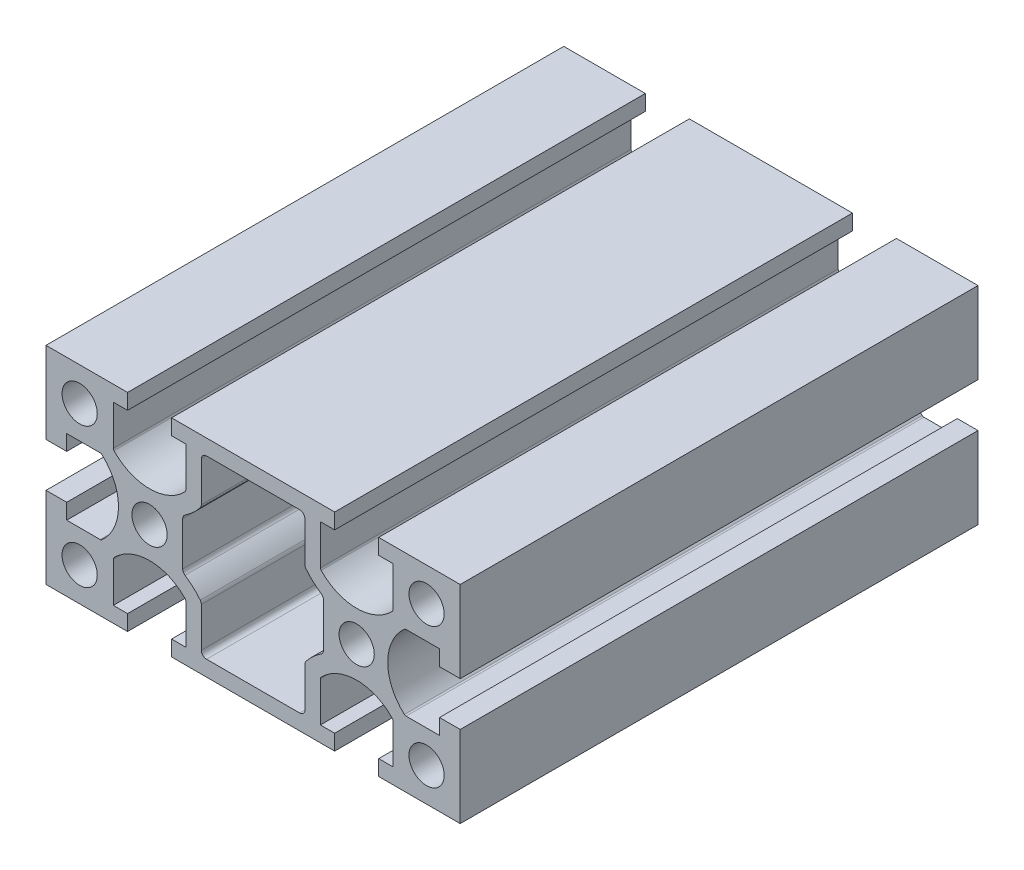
ISO-10303-21;
HEADER;
FILE_DESCRIPTION(('STEP AP214'),'2;1');
FILE_NAME('part.step','',(''),(''),'','','');
FILE_SCHEMA(('AUTOMOTIVE_DESIGN { 1 0 10303 214 1 1 1 1 }'));
ENDSEC;
DATA;
#1=APPLICATION_CONTEXT('core data for automotive mechanical design processes');
#2=APPLICATION_PROTOCOL_DEFINITION('international standard','automotive_design',2000,#1);
#3=PRODUCT_CONTEXT('',#1,'mechanical');
#4=PRODUCT('Part','Part','',(#3));
#5=PRODUCT_RELATED_PRODUCT_CATEGORY('part','',(#4));
#6=PRODUCT_DEFINITION_FORMATION('','',#4);
#7=PRODUCT_DEFINITION_CONTEXT('part definition',#1,'design');
#8=PRODUCT_DEFINITION('design','',#6,#7);
#9=PRODUCT_DEFINITION_SHAPE('','',#8);
#10=(LENGTH_UNIT() NAMED_UNIT(*) SI_UNIT(.MILLI.,.METRE.));
#11=(NAMED_UNIT(*) PLANE_ANGLE_UNIT() SI_UNIT($,.RADIAN.));
#12=(NAMED_UNIT(*) SI_UNIT($,.STERADIAN.) SOLID_ANGLE_UNIT());
#13=UNCERTAINTY_MEASURE_WITH_UNIT(LENGTH_MEASURE(1.E-05),#10,'distance_accuracy_value','');
#14=(GEOMETRIC_REPRESENTATION_CONTEXT(3) GLOBAL_UNCERTAINTY_ASSIGNED_CONTEXT((#13)) GLOBAL_UNIT_ASSIGNED_CONTEXT((#10,
#11,#12)) REPRESENTATION_CONTEXT('',''));
#15=CARTESIAN_POINT('',(0.,0.,0.));
#16=DIRECTION('',(0.,0.,1.));
#17=DIRECTION('',(1.,0.,0.));
#18=AXIS2_PLACEMENT_3D('',#15,#16,#17);
#19=CARTESIAN_POINT('',(40.,-20.,50.));
#20=DIRECTION('',(0.,0.,1.));
#21=DIRECTION('',(1.,0.,0.));
#22=AXIS2_PLACEMENT_3D('',#19,#20,#21);
#23=PLANE('',#22);
#24=CARTESIAN_POINT('',(-8.99999999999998,16.,50.));
#25=DIRECTION('',(0.,0.,1.));
#26=DIRECTION('',(-1.,0.,0.));
#27=AXIS2_PLACEMENT_3D('',#24,#25,#26);
#28=CIRCLE('',#27,1.);
#29=CARTESIAN_POINT('',(-8.99999999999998,17.,50.));
#30=VERTEX_POINT('',#29);
#31=CARTESIAN_POINT('',(-9.99999999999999,16.,50.));
#32=VERTEX_POINT('',#31);
#33=EDGE_CURVE('E50',#30,#32,#28,.T.);
#34=ORIENTED_EDGE('',*,*,#33,.F.);
#35=DIRECTION('',(-1.,0.,0.));
#36=VECTOR('',#35,1.);
#37=CARTESIAN_POINT('',(-8.99999999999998,17.,50.));
#38=LINE('',#37,#36);
#39=CARTESIAN_POINT('',(8.99999999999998,17.,50.));
#40=VERTEX_POINT('',#39);
#41=EDGE_CURVE('E599',#40,#30,#38,.T.);
#42=ORIENTED_EDGE('',*,*,#41,.F.);
#43=CARTESIAN_POINT('',(8.99999999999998,16.,50.));
#44=DIRECTION('',(0.,0.,1.));
#45=DIRECTION('',(-1.,0.,0.));
#46=AXIS2_PLACEMENT_3D('',#43,#44,#45);
#47=CIRCLE('',#46,1.);
#48=CARTESIAN_POINT('',(9.99999999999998,16.,50.));
#49=VERTEX_POINT('',#48);
#50=EDGE_CURVE('E602',#49,#40,#47,.T.);
#51=ORIENTED_EDGE('',*,*,#50,.F.);
#52=DIRECTION('',(0.,1.,0.));
#53=VECTOR('',#52,1.);
#54=CARTESIAN_POINT('',(9.99999999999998,16.,50.));
#55=LINE('',#54,#53);
#56=CARTESIAN_POINT('',(9.99999999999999,8.34108946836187,50.));
#57=VERTEX_POINT('',#56);
#58=EDGE_CURVE('E726',#57,#49,#55,.T.);
#59=ORIENTED_EDGE('',*,*,#58,.F.);
#60=CARTESIAN_POINT('',(11.,8.34108946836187,50.));
#61=DIRECTION('',(0.,0.,-1.));
#62=DIRECTION('',(1.,0.,0.));
#63=AXIS2_PLACEMENT_3D('',#60,#61,#62);
#64=CIRCLE('',#63,0.999999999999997);
#65=CARTESIAN_POINT('',(10.2173913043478,7.71857550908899,50.));
#66=VERTEX_POINT('',#65);
#67=EDGE_CURVE('E723',#66,#57,#64,.T.);
#68=ORIENTED_EDGE('',*,*,#67,.F.);
#69=CARTESIAN_POINT('',(20.,15.5,50.));
#70=DIRECTION('',(0.,0.,-1.));
#71=DIRECTION('',(1.,0.,0.));
#72=AXIS2_PLACEMENT_3D('',#69,#70,#71);
#73=CIRCLE('',#72,12.5);
#74=CARTESIAN_POINT('',(13.1481481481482,5.04523428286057,50.));
#75=VERTEX_POINT('',#74);
#76=EDGE_CURVE('E720',#75,#66,#73,.T.);
#77=ORIENTED_EDGE('',*,*,#76,.F.);
#78=CARTESIAN_POINT('',(12.6,4.20885302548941,50.));
#79=DIRECTION('',(0.,0.,1.));
#80=DIRECTION('',(1.,0.,0.));
#81=AXIS2_PLACEMENT_3D('',#78,#79,#80);
#82=CIRCLE('',#81,1.);
#83=CARTESIAN_POINT('',(13.6,4.20885302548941,50.));
#84=VERTEX_POINT('',#83);
#85=EDGE_CURVE('E717',#84,#75,#82,.T.);
#86=ORIENTED_EDGE('',*,*,#85,.F.);
#87=DIRECTION('',(0.,1.,0.));
#88=VECTOR('',#87,1.);
#89=CARTESIAN_POINT('',(13.6,4.20885302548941,50.));
#90=LINE('',#89,#88);
#91=CARTESIAN_POINT('',(13.6,-4.20885302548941,50.));
#92=VERTEX_POINT('',#91);
#93=EDGE_CURVE('E714',#92,#84,#90,.T.);
#94=ORIENTED_EDGE('',*,*,#93,.F.);
#95=CARTESIAN_POINT('',(12.6,-4.20885302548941,50.));
#96=DIRECTION('',(0.,0.,1.));
#97=DIRECTION('',(1.,0.,0.));
#98=AXIS2_PLACEMENT_3D('',#95,#96,#97);
#99=CIRCLE('',#98,1.);
#100=CARTESIAN_POINT('',(13.1481481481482,-5.04523428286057,50.));
#101=VERTEX_POINT('',#100);
#102=EDGE_CURVE('E711',#101,#92,#99,.T.);
#103=ORIENTED_EDGE('',*,*,#102,.F.);
#104=CARTESIAN_POINT('',(20.,-15.5,50.));
#105=DIRECTION('',(0.,0.,-1.));
#106=DIRECTION('',(-1.,0.,0.));
#107=AXIS2_PLACEMENT_3D('',#104,#105,#106);
#108=CIRCLE('',#107,12.5);
#109=CARTESIAN_POINT('',(10.2173913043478,-7.71857550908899,50.));
#110=VERTEX_POINT('',#109);
#111=EDGE_CURVE('E708',#110,#101,#108,.T.);
#112=ORIENTED_EDGE('',*,*,#111,.F.);
#113=CARTESIAN_POINT('',(11.,-8.34108946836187,50.));
#114=DIRECTION('',(0.,0.,-1.));
#115=DIRECTION('',(1.,0.,0.));
#116=AXIS2_PLACEMENT_3D('',#113,#114,#115);
#117=CIRCLE('',#116,0.999999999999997);
#118=CARTESIAN_POINT('',(9.99999999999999,-8.34108946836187,50.));
#119=VERTEX_POINT('',#118);
#120=EDGE_CURVE('E705',#119,#110,#117,.T.);
#121=ORIENTED_EDGE('',*,*,#120,.F.);
#122=DIRECTION('',(0.,1.,0.));
#123=VECTOR('',#122,1.);
#124=CARTESIAN_POINT('',(9.99999999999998,-16.,50.));
#125=LINE('',#124,#123);
#126=CARTESIAN_POINT('',(9.99999999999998,-16.,50.));
#127=VERTEX_POINT('',#126);
#128=EDGE_CURVE('E702',#127,#119,#125,.T.);
#129=ORIENTED_EDGE('',*,*,#128,.F.);
#130=CARTESIAN_POINT('',(8.99999999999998,-16.,50.));
#131=DIRECTION('',(0.,0.,1.));
#132=DIRECTION('',(-1.,0.,0.));
#133=AXIS2_PLACEMENT_3D('',#130,#131,#132);
#134=CIRCLE('',#133,1.);
#135=CARTESIAN_POINT('',(8.99999999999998,-17.,50.));
#136=VERTEX_POINT('',#135);
#137=EDGE_CURVE('E699',#136,#127,#134,.T.);
#138=ORIENTED_EDGE('',*,*,#137,.F.);
#139=DIRECTION('',(1.,0.,0.));
#140=VECTOR('',#139,1.);
#141=CARTESIAN_POINT('',(-8.99999999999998,-17.,50.));
#142=LINE('',#141,#140);
#143=CARTESIAN_POINT('',(-8.99999999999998,-17.,50.));
#144=VERTEX_POINT('',#143);
#145=EDGE_CURVE('E696',#144,#136,#142,.T.);
#146=ORIENTED_EDGE('',*,*,#145,.F.);
#147=CARTESIAN_POINT('',(-8.99999999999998,-16.,50.));
#148=DIRECTION('',(0.,0.,1.));
#149=DIRECTION('',(1.,0.,0.));
#150=AXIS2_PLACEMENT_3D('',#147,#148,#149);
#151=CIRCLE('',#150,1.);
#152=CARTESIAN_POINT('',(-9.99999999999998,-16.,50.));
#153=VERTEX_POINT('',#152);
#154=EDGE_CURVE('E693',#153,#144,#151,.T.);
#155=ORIENTED_EDGE('',*,*,#154,.F.);
#156=DIRECTION('',(0.,-1.,0.));
#157=VECTOR('',#156,1.);
#158=CARTESIAN_POINT('',(-9.99999999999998,-16.,50.));
#159=LINE('',#158,#157);
#160=CARTESIAN_POINT('',(-9.99999999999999,-8.34108946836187,50.));
#161=VERTEX_POINT('',#160);
#162=EDGE_CURVE('E690',#161,#153,#159,.T.);
#163=ORIENTED_EDGE('',*,*,#162,.F.);
#164=CARTESIAN_POINT('',(-11.,-8.34108946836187,50.));
#165=DIRECTION('',(0.,0.,-1.));
#166=DIRECTION('',(-1.,0.,0.));
#167=AXIS2_PLACEMENT_3D('',#164,#165,#166);
#168=CIRCLE('',#167,0.999999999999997);
#169=CARTESIAN_POINT('',(-10.2173913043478,-7.71857550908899,50.));
#170=VERTEX_POINT('',#169);
#171=EDGE_CURVE('E687',#170,#161,#168,.T.);
#172=ORIENTED_EDGE('',*,*,#171,.F.);
#173=CARTESIAN_POINT('',(-20.,-15.5,50.));
#174=DIRECTION('',(0.,0.,-1.));
#175=DIRECTION('',(1.,0.,0.));
#176=AXIS2_PLACEMENT_3D('',#173,#174,#175);
#177=CIRCLE('',#176,12.5);
#178=CARTESIAN_POINT('',(-13.1481481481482,-5.04523428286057,50.));
#179=VERTEX_POINT('',#178);
#180=EDGE_CURVE('E684',#179,#170,#177,.T.);
#181=ORIENTED_EDGE('',*,*,#180,.F.);
#182=CARTESIAN_POINT('',(-12.6,-4.20885302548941,50.));
#183=DIRECTION('',(0.,0.,1.));
#184=DIRECTION('',(-1.,0.,0.));
#185=AXIS2_PLACEMENT_3D('',#182,#183,#184);
#186=CIRCLE('',#185,1.);
#187=CARTESIAN_POINT('',(-13.6,-4.20885302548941,50.));
#188=VERTEX_POINT('',#187);
#189=EDGE_CURVE('E681',#188,#179,#186,.T.);
#190=ORIENTED_EDGE('',*,*,#189,.F.);
#191=DIRECTION('',(0.,-1.,0.));
#192=VECTOR('',#191,1.);
#193=CARTESIAN_POINT('',(-13.6,4.20885302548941,50.));
#194=LINE('',#193,#192);
#195=CARTESIAN_POINT('',(-13.6,4.20885302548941,50.));
#196=VERTEX_POINT('',#195);
#197=EDGE_CURVE('E678',#196,#188,#194,.T.);
#198=ORIENTED_EDGE('',*,*,#197,.F.);
#199=CARTESIAN_POINT('',(-12.6,4.20885302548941,50.));
#200=DIRECTION('',(0.,0.,1.));
#201=DIRECTION('',(1.,0.,0.));
#202=AXIS2_PLACEMENT_3D('',#199,#200,#201);
#203=CIRCLE('',#202,1.);
#204=CARTESIAN_POINT('',(-13.1481481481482,5.04523428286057,50.));
#205=VERTEX_POINT('',#204);
#206=EDGE_CURVE('E675',#205,#196,#203,.T.);
#207=ORIENTED_EDGE('',*,*,#206,.F.);
#208=CARTESIAN_POINT('',(-20.,15.5,50.));
#209=DIRECTION('',(0.,0.,-1.));
#210=DIRECTION('',(-1.,0.,0.));
#211=AXIS2_PLACEMENT_3D('',#208,#209,#210);
#212=CIRCLE('',#211,12.5);
#213=CARTESIAN_POINT('',(-10.2173913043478,7.71857550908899,50.));
#214=VERTEX_POINT('',#213);
#215=EDGE_CURVE('E672',#214,#205,#212,.T.);
#216=ORIENTED_EDGE('',*,*,#215,.F.);
#217=CARTESIAN_POINT('',(-11.,8.34108946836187,50.));
#218=DIRECTION('',(0.,0.,-1.));
#219=DIRECTION('',(1.,0.,0.));
#220=AXIS2_PLACEMENT_3D('',#217,#218,#219);
#221=CIRCLE('',#220,0.999999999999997);
#222=CARTESIAN_POINT('',(-9.99999999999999,8.34108946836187,50.));
#223=VERTEX_POINT('',#222);
#224=EDGE_CURVE('E669',#223,#214,#221,.T.);
#225=ORIENTED_EDGE('',*,*,#224,.F.);
#226=DIRECTION('',(0.,-1.,0.));
#227=VECTOR('',#226,1.);
#228=CARTESIAN_POINT('',(-9.99999999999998,16.,50.));
#229=LINE('',#228,#227);
#230=EDGE_CURVE('E667',#32,#223,#229,.T.);
#231=ORIENTED_EDGE('',*,*,#230,.F.);
#232=EDGE_LOOP('',(#34,#42,#51,#59,#68,#77,#86,#94,#103,#112,#121,#129,#138,#146,#155,#163,#172,
#181,#190,#198,#207,#216,#225,#231));
#233=FACE_BOUND('',#232,.T.);
#234=CARTESIAN_POINT('',(-20.,0.,50.));
#235=DIRECTION('',(0.,0.,1.));
#236=DIRECTION('',(1.,0.,0.));
#237=AXIS2_PLACEMENT_3D('',#234,#235,#236);
#238=CIRCLE('',#237,3.4);
#239=CARTESIAN_POINT('',(-16.6,0.,50.));
#240=VERTEX_POINT('',#239);
#241=EDGE_CURVE('E1226',#240,#240,#238,.T.);
#242=ORIENTED_EDGE('',*,*,#241,.F.);
#243=EDGE_LOOP('',(#242));
#244=FACE_BOUND('',#243,.T.);
#245=CARTESIAN_POINT('',(20.,0.,50.));
#246=DIRECTION('',(0.,0.,1.));
#247=DIRECTION('',(1.,0.,0.));
#248=AXIS2_PLACEMENT_3D('',#245,#246,#247);
#249=CIRCLE('',#248,3.4);
#250=CARTESIAN_POINT('',(23.4,0.,50.));
#251=VERTEX_POINT('',#250);
#252=EDGE_CURVE('E1220',#251,#251,#249,.T.);
#253=ORIENTED_EDGE('',*,*,#252,.F.);
#254=EDGE_LOOP('',(#253));
#255=FACE_BOUND('',#254,.T.);
#256=CARTESIAN_POINT('',(-33.5,13.5,50.));
#257=DIRECTION('',(0.,0.,1.));
#258=DIRECTION('',(1.,0.,0.));
#259=AXIS2_PLACEMENT_3D('',#256,#257,#258);
#260=CIRCLE('',#259,3.4);
#261=CARTESIAN_POINT('',(-30.1,13.5,50.));
#262=VERTEX_POINT('',#261);
#263=EDGE_CURVE('E1214',#262,#262,#260,.T.);
#264=ORIENTED_EDGE('',*,*,#263,.F.);
#265=EDGE_LOOP('',(#264));
#266=FACE_BOUND('',#265,.T.);
#267=CARTESIAN_POINT('',(33.5,13.5,50.));
#268=DIRECTION('',(0.,0.,1.));
#269=DIRECTION('',(1.,0.,0.));
#270=AXIS2_PLACEMENT_3D('',#267,#268,#269);
#271=CIRCLE('',#270,3.4);
#272=CARTESIAN_POINT('',(36.9,13.5,50.));
#273=VERTEX_POINT('',#272);
#274=EDGE_CURVE('E1208',#273,#273,#271,.T.);
#275=ORIENTED_EDGE('',*,*,#274,.F.);
#276=EDGE_LOOP('',(#275));
#277=FACE_BOUND('',#276,.T.);
#278=CARTESIAN_POINT('',(33.5000000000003,-13.5,50.));
#279=DIRECTION('',(0.,0.,1.));
#280=DIRECTION('',(1.,0.,0.));
#281=AXIS2_PLACEMENT_3D('',#278,#279,#280);
#282=CIRCLE('',#281,3.4);
#283=CARTESIAN_POINT('',(36.9000000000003,-13.5,50.));
#284=VERTEX_POINT('',#283);
#285=EDGE_CURVE('E1202',#284,#284,#282,.T.);
#286=ORIENTED_EDGE('',*,*,#285,.F.);
#287=EDGE_LOOP('',(#286));
#288=FACE_BOUND('',#287,.T.);
#289=CARTESIAN_POINT('',(-33.4999999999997,-13.5,50.));
#290=DIRECTION('',(0.,0.,1.));
#291=DIRECTION('',(1.,0.,0.));
#292=AXIS2_PLACEMENT_3D('',#289,#290,#291);
#293=CIRCLE('',#292,3.4);
#294=CARTESIAN_POINT('',(-30.0999999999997,-13.5,50.));
#295=VERTEX_POINT('',#294);
#296=EDGE_CURVE('E1180',#295,#295,#293,.T.);
#297=ORIENTED_EDGE('',*,*,#296,.F.);
#298=EDGE_LOOP('',(#297));
#299=FACE_BOUND('',#298,.T.);
#300=DIRECTION('',(0.,-1.,0.));
#301=VECTOR('',#300,1.);
#302=CARTESIAN_POINT('',(36.,4.24999999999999,50.));
#303=LINE('',#302,#301);
#304=CARTESIAN_POINT('',(36.,7.25,50.));
#305=VERTEX_POINT('',#304);
#306=CARTESIAN_POINT('',(36.,4.24999999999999,50.));
#307=VERTEX_POINT('',#306);
#308=EDGE_CURVE('E799',#305,#307,#303,.T.);
#309=ORIENTED_EDGE('',*,*,#308,.T.);
#310=DIRECTION('',(1.,0.,0.));
#311=VECTOR('',#310,1.);
#312=CARTESIAN_POINT('',(40.,4.24999999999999,50.));
#313=LINE('',#312,#311);
#314=CARTESIAN_POINT('',(40.,4.24999999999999,50.));
#315=VERTEX_POINT('',#314);
#316=EDGE_CURVE('E733',#307,#315,#313,.T.);
#317=ORIENTED_EDGE('',*,*,#316,.T.);
#318=DIRECTION('',(0.,1.,0.));
#319=VECTOR('',#318,1.);
#320=CARTESIAN_POINT('',(40.,20.,50.));
#321=LINE('',#320,#319);
#322=CARTESIAN_POINT('',(40.,20.,50.));
#323=VERTEX_POINT('',#322);
#324=EDGE_CURVE('E1239',#315,#323,#321,.T.);
#325=ORIENTED_EDGE('',*,*,#324,.T.);
#326=DIRECTION('',(-1.,0.,0.));
#327=VECTOR('',#326,1.);
#328=CARTESIAN_POINT('',(-40.,20.,50.));
#329=LINE('',#328,#327);
#330=CARTESIAN_POINT('',(24.25,20.,50.));
#331=VERTEX_POINT('',#330);
#332=EDGE_CURVE('E1240',#323,#331,#329,.T.);
#333=ORIENTED_EDGE('',*,*,#332,.T.);
#334=DIRECTION('',(0.,1.,0.));
#335=VECTOR('',#334,1.);
#336=CARTESIAN_POINT('',(24.25,20.,50.));
#337=LINE('',#336,#335);
#338=CARTESIAN_POINT('',(24.25,17.,50.));
#339=VERTEX_POINT('',#338);
#340=EDGE_CURVE('E1174',#339,#331,#337,.T.);
#341=ORIENTED_EDGE('',*,*,#340,.F.);
#342=DIRECTION('',(-1.,0.,0.));
#343=VECTOR('',#342,1.);
#344=CARTESIAN_POINT('',(24.25,17.,50.));
#345=LINE('',#344,#343);
#346=CARTESIAN_POINT('',(27.,17.,50.));
#347=VERTEX_POINT('',#346);
#348=EDGE_CURVE('E1171',#347,#339,#345,.T.);
#349=ORIENTED_EDGE('',*,*,#348,.F.);
#350=DIRECTION('',(0.,1.,0.));
#351=VECTOR('',#350,1.);
#352=CARTESIAN_POINT('',(27.,17.,50.));
#353=LINE('',#352,#351);
#354=CARTESIAN_POINT('',(27.,9.27505020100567,50.));
#355=VERTEX_POINT('',#354);
#356=EDGE_CURVE('E1168',#355,#347,#353,.T.);
#357=ORIENTED_EDGE('',*,*,#356,.F.);
#358=CARTESIAN_POINT('',(26.5,9.27505020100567,50.));
#359=DIRECTION('',(0.,0.,1.));
#360=DIRECTION('',(1.,0.,0.));
#361=AXIS2_PLACEMENT_3D('',#358,#359,#360);
#362=CIRCLE('',#361,0.499999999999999);
#363=CARTESIAN_POINT('',(26.8611111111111,8.92921965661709,50.));
#364=VERTEX_POINT('',#363);
#365=EDGE_CURVE('E1165',#364,#355,#362,.T.);
#366=ORIENTED_EDGE('',*,*,#365,.F.);
#367=CARTESIAN_POINT('',(20.,15.5,50.));
#368=DIRECTION('',(0.,0.,1.));
#369=DIRECTION('',(1.,0.,0.));
#370=AXIS2_PLACEMENT_3D('',#367,#368,#369);
#371=CIRCLE('',#370,9.5);
#372=CARTESIAN_POINT('',(13.1388888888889,8.92921965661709,50.));
#373=VERTEX_POINT('',#372);
#374=EDGE_CURVE('E1162',#373,#364,#371,.T.);
#375=ORIENTED_EDGE('',*,*,#374,.F.);
#376=CARTESIAN_POINT('',(13.5,9.27505020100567,50.));
#377=DIRECTION('',(0.,0.,1.));
#378=DIRECTION('',(1.,0.,0.));
#379=AXIS2_PLACEMENT_3D('',#376,#377,#378);
#380=CIRCLE('',#379,0.499999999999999);
#381=CARTESIAN_POINT('',(13.,9.27505020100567,50.));
#382=VERTEX_POINT('',#381);
#383=EDGE_CURVE('E1159',#382,#373,#380,.T.);
#384=ORIENTED_EDGE('',*,*,#383,.F.);
#385=DIRECTION('',(0.,-1.,0.));
#386=VECTOR('',#385,1.);
#387=CARTESIAN_POINT('',(13.,17.,50.));
#388=LINE('',#387,#386);
#389=CARTESIAN_POINT('',(13.,17.,50.));
#390=VERTEX_POINT('',#389);
#391=EDGE_CURVE('E1156',#390,#382,#388,.T.);
#392=ORIENTED_EDGE('',*,*,#391,.F.);
#393=DIRECTION('',(-1.,0.,0.));
#394=VECTOR('',#393,1.);
#395=CARTESIAN_POINT('',(15.75,17.,50.));
#396=LINE('',#395,#394);
#397=CARTESIAN_POINT('',(15.75,17.,50.));
#398=VERTEX_POINT('',#397);
#399=EDGE_CURVE('E1106',#398,#390,#396,.T.);
#400=ORIENTED_EDGE('',*,*,#399,.F.);
#401=DIRECTION('',(0.,-1.,0.));
#402=VECTOR('',#401,1.);
#403=CARTESIAN_POINT('',(15.75,20.,50.));
#404=LINE('',#403,#402);
#405=CARTESIAN_POINT('',(15.75,20.,50.));
#406=VERTEX_POINT('',#405);
#407=EDGE_CURVE('E1129',#406,#398,#404,.T.);
#408=ORIENTED_EDGE('',*,*,#407,.F.);
#409=CARTESIAN_POINT('',(-15.75,20.,50.));
#410=VERTEX_POINT('',#409);
#411=EDGE_CURVE('E1244',#406,#410,#329,.T.);
#412=ORIENTED_EDGE('',*,*,#411,.T.);
#413=DIRECTION('',(0.,1.,0.));
#414=VECTOR('',#413,1.);
#415=CARTESIAN_POINT('',(-15.75,20.,50.));
#416=LINE('',#415,#414);
#417=CARTESIAN_POINT('',(-15.75,17.,50.));
#418=VERTEX_POINT('',#417);
#419=EDGE_CURVE('E966',#418,#410,#416,.T.);
#420=ORIENTED_EDGE('',*,*,#419,.F.);
#421=DIRECTION('',(-1.,0.,0.));
#422=VECTOR('',#421,1.);
#423=CARTESIAN_POINT('',(-15.75,17.,50.));
#424=LINE('',#423,#422);
#425=CARTESIAN_POINT('',(-13.,17.,50.));
#426=VERTEX_POINT('',#425);
#427=EDGE_CURVE('E963',#426,#418,#424,.T.);
#428=ORIENTED_EDGE('',*,*,#427,.F.);
#429=DIRECTION('',(0.,1.,0.));
#430=VECTOR('',#429,1.);
#431=CARTESIAN_POINT('',(-13.,17.,50.));
#432=LINE('',#431,#430);
#433=CARTESIAN_POINT('',(-13.,9.27505020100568,50.));
#434=VERTEX_POINT('',#433);
#435=EDGE_CURVE('E960',#434,#426,#432,.T.);
#436=ORIENTED_EDGE('',*,*,#435,.F.);
#437=CARTESIAN_POINT('',(-13.5,9.27505020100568,50.));
#438=DIRECTION('',(0.,0.,1.));
#439=DIRECTION('',(1.,0.,0.));
#440=AXIS2_PLACEMENT_3D('',#437,#438,#439);
#441=CIRCLE('',#440,0.499999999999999);
#442=CARTESIAN_POINT('',(-13.1388888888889,8.9292196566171,50.));
#443=VERTEX_POINT('',#442);
#444=EDGE_CURVE('E957',#443,#434,#441,.T.);
#445=ORIENTED_EDGE('',*,*,#444,.F.);
#446=CARTESIAN_POINT('',(-20.,15.5,50.));
#447=DIRECTION('',(0.,0.,1.));
#448=DIRECTION('',(1.,0.,0.));
#449=AXIS2_PLACEMENT_3D('',#446,#447,#448);
#450=CIRCLE('',#449,9.5);
#451=CARTESIAN_POINT('',(-26.8611111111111,8.9292196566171,50.));
#452=VERTEX_POINT('',#451);
#453=EDGE_CURVE('E954',#452,#443,#450,.T.);
#454=ORIENTED_EDGE('',*,*,#453,.F.);
#455=CARTESIAN_POINT('',(-26.5,9.27505020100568,50.));
#456=DIRECTION('',(0.,0.,1.));
#457=DIRECTION('',(1.,0.,0.));
#458=AXIS2_PLACEMENT_3D('',#455,#456,#457);
#459=CIRCLE('',#458,0.499999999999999);
#460=CARTESIAN_POINT('',(-27.,9.27505020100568,50.));
#461=VERTEX_POINT('',#460);
#462=EDGE_CURVE('E951',#461,#452,#459,.T.);
#463=ORIENTED_EDGE('',*,*,#462,.F.);
#464=DIRECTION('',(0.,-1.,0.));
#465=VECTOR('',#464,1.);
#466=CARTESIAN_POINT('',(-27.,17.,50.));
#467=LINE('',#466,#465);
#468=CARTESIAN_POINT('',(-27.,17.,50.));
#469=VERTEX_POINT('',#468);
#470=EDGE_CURVE('E948',#469,#461,#467,.T.);
#471=ORIENTED_EDGE('',*,*,#470,.F.);
#472=DIRECTION('',(-1.,0.,0.));
#473=VECTOR('',#472,1.);
#474=CARTESIAN_POINT('',(-24.25,17.,50.));
#475=LINE('',#474,#473);
#476=CARTESIAN_POINT('',(-24.25,17.,50.));
#477=VERTEX_POINT('',#476);
#478=EDGE_CURVE('E898',#477,#469,#475,.T.);
#479=ORIENTED_EDGE('',*,*,#478,.F.);
#480=DIRECTION('',(0.,-1.,0.));
#481=VECTOR('',#480,1.);
#482=CARTESIAN_POINT('',(-24.25,20.,50.));
#483=LINE('',#482,#481);
#484=CARTESIAN_POINT('',(-24.25,20.,50.));
#485=VERTEX_POINT('',#484);
#486=EDGE_CURVE('E921',#485,#477,#483,.T.);
#487=ORIENTED_EDGE('',*,*,#486,.F.);
#488=CARTESIAN_POINT('',(-40.,20.,50.));
#489=VERTEX_POINT('',#488);
#490=EDGE_CURVE('E1238',#485,#489,#329,.T.);
#491=ORIENTED_EDGE('',*,*,#490,.T.);
#492=DIRECTION('',(0.,-1.,0.));
#493=VECTOR('',#492,1.);
#494=CARTESIAN_POINT('',(-40.,20.,50.));
#495=LINE('',#494,#493);
#496=CARTESIAN_POINT('',(-40.,4.24999999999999,50.));
#497=VERTEX_POINT('',#496);
#498=EDGE_CURVE('E1245',#489,#497,#495,.T.);
#499=ORIENTED_EDGE('',*,*,#498,.T.);
#500=DIRECTION('',(-1.,0.,0.));
#501=VECTOR('',#500,1.);
#502=CARTESIAN_POINT('',(-40.,4.24999999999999,50.));
#503=LINE('',#502,#501);
#504=CARTESIAN_POINT('',(-36.,4.24999999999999,50.));
#505=VERTEX_POINT('',#504);
#506=EDGE_CURVE('E824',#505,#497,#503,.T.);
#507=ORIENTED_EDGE('',*,*,#506,.F.);
#508=DIRECTION('',(0.,-1.,0.));
#509=VECTOR('',#508,1.);
#510=CARTESIAN_POINT('',(-36.,4.24999999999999,50.));
#511=LINE('',#510,#509);
#512=CARTESIAN_POINT('',(-36.,7.25,50.));
#513=VERTEX_POINT('',#512);
#514=EDGE_CURVE('E847',#513,#505,#511,.T.);
#515=ORIENTED_EDGE('',*,*,#514,.F.);
#516=DIRECTION('',(-1.,0.,0.));
#517=VECTOR('',#516,1.);
#518=CARTESIAN_POINT('',(-36.,7.25,50.));
#519=LINE('',#518,#517);
#520=CARTESIAN_POINT('',(-29.5470595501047,7.25,50.));
#521=VERTEX_POINT('',#520);
#522=EDGE_CURVE('E891',#521,#513,#519,.T.);
#523=ORIENTED_EDGE('',*,*,#522,.F.);
#524=CARTESIAN_POINT('',(-29.5470595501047,6.75,50.));
#525=DIRECTION('',(0.,0.,1.));
#526=DIRECTION('',(-1.,0.,0.));
#527=AXIS2_PLACEMENT_3D('',#524,#525,#526);
#528=CIRCLE('',#527,0.5);
#529=CARTESIAN_POINT('',(-29.2163406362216,7.125,50.));
#530=VERTEX_POINT('',#529);
#531=EDGE_CURVE('E888',#530,#521,#528,.T.);
#532=ORIENTED_EDGE('',*,*,#531,.F.);
#533=CARTESIAN_POINT('',(-35.5,0.,50.));
#534=DIRECTION('',(0.,0.,1.));
#535=DIRECTION('',(1.,0.,0.));
#536=AXIS2_PLACEMENT_3D('',#533,#534,#535);
#537=CIRCLE('',#536,9.5);
#538=CARTESIAN_POINT('',(-29.2163406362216,-7.125,50.));
#539=VERTEX_POINT('',#538);
#540=EDGE_CURVE('E885',#539,#530,#537,.T.);
#541=ORIENTED_EDGE('',*,*,#540,.F.);
#542=CARTESIAN_POINT('',(-29.5470595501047,-6.75,50.));
#543=DIRECTION('',(0.,0.,1.));
#544=DIRECTION('',(1.,0.,0.));
#545=AXIS2_PLACEMENT_3D('',#542,#543,#544);
#546=CIRCLE('',#545,0.500000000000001);
#547=CARTESIAN_POINT('',(-29.5470595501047,-7.25,50.));
#548=VERTEX_POINT('',#547);
#549=EDGE_CURVE('E882',#548,#539,#546,.T.);
#550=ORIENTED_EDGE('',*,*,#549,.F.);
#551=DIRECTION('',(1.,0.,0.));
#552=VECTOR('',#551,1.);
#553=CARTESIAN_POINT('',(-36.,-7.25,50.));
#554=LINE('',#553,#552);
#555=CARTESIAN_POINT('',(-36.,-7.25,50.));
#556=VERTEX_POINT('',#555);
#557=EDGE_CURVE('E879',#556,#548,#554,.T.);
#558=ORIENTED_EDGE('',*,*,#557,.F.);
#559=DIRECTION('',(0.,-1.,0.));
#560=VECTOR('',#559,1.);
#561=CARTESIAN_POINT('',(-36.,-4.25,50.));
#562=LINE('',#561,#560);
#563=CARTESIAN_POINT('',(-36.,-4.25,50.));
#564=VERTEX_POINT('',#563);
#565=EDGE_CURVE('E876',#564,#556,#562,.T.);
#566=ORIENTED_EDGE('',*,*,#565,.F.);
#567=DIRECTION('',(1.,0.,0.));
#568=VECTOR('',#567,1.);
#569=CARTESIAN_POINT('',(-40.,-4.24999999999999,50.));
#570=LINE('',#569,#568);
#571=CARTESIAN_POINT('',(-40.,-4.24999999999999,50.));
#572=VERTEX_POINT('',#571);
#573=EDGE_CURVE('E873',#572,#564,#570,.T.);
#574=ORIENTED_EDGE('',*,*,#573,.F.);
#575=CARTESIAN_POINT('',(-40.,-20.,50.));
#576=VERTEX_POINT('',#575);
#577=EDGE_CURVE('E1243',#572,#576,#495,.T.);
#578=ORIENTED_EDGE('',*,*,#577,.T.);
#579=DIRECTION('',(1.,0.,0.));
#580=VECTOR('',#579,1.);
#581=CARTESIAN_POINT('',(-40.,-20.,50.));
#582=LINE('',#581,#580);
#583=CARTESIAN_POINT('',(-24.25,-20.,50.));
#584=VERTEX_POINT('',#583);
#585=EDGE_CURVE('E1249',#576,#584,#582,.T.);
#586=ORIENTED_EDGE('',*,*,#585,.T.);
#587=DIRECTION('',(0.,1.,0.));
#588=VECTOR('',#587,1.);
#589=CARTESIAN_POINT('',(-24.25,-20.,50.));
#590=LINE('',#589,#588);
#591=CARTESIAN_POINT('',(-24.25,-17.,50.));
#592=VERTEX_POINT('',#591);
#593=EDGE_CURVE('E1013',#584,#592,#590,.T.);
#594=ORIENTED_EDGE('',*,*,#593,.T.);
#595=DIRECTION('',(-1.,0.,0.));
#596=VECTOR('',#595,1.);
#597=CARTESIAN_POINT('',(-24.25,-17.,50.));
#598=LINE('',#597,#596);
#599=CARTESIAN_POINT('',(-27.,-17.,50.));
#600=VERTEX_POINT('',#599);
#601=EDGE_CURVE('E972',#592,#600,#598,.T.);
#602=ORIENTED_EDGE('',*,*,#601,.T.);
#603=DIRECTION('',(0.,1.,0.));
#604=VECTOR('',#603,1.);
#605=CARTESIAN_POINT('',(-27.,-17.,50.));
#606=LINE('',#605,#604);
#607=CARTESIAN_POINT('',(-27.,-9.27505020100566,50.));
#608=VERTEX_POINT('',#607);
#609=EDGE_CURVE('E994',#600,#608,#606,.T.);
#610=ORIENTED_EDGE('',*,*,#609,.T.);
#611=CARTESIAN_POINT('',(-26.5,-9.27505020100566,50.));
#612=DIRECTION('',(0.,0.,-1.));
#613=DIRECTION('',(1.,0.,0.));
#614=AXIS2_PLACEMENT_3D('',#611,#612,#613);
#615=CIRCLE('',#614,0.499999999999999);
#616=CARTESIAN_POINT('',(-26.8611111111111,-8.92921965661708,50.));
#617=VERTEX_POINT('',#616);
#618=EDGE_CURVE('E1031',#608,#617,#615,.T.);
#619=ORIENTED_EDGE('',*,*,#618,.T.);
#620=CARTESIAN_POINT('',(-20.,-15.5,50.));
#621=DIRECTION('',(0.,0.,-1.));
#622=DIRECTION('',(1.,0.,0.));
#623=AXIS2_PLACEMENT_3D('',#620,#621,#622);
#624=CIRCLE('',#623,9.5);
#625=CARTESIAN_POINT('',(-13.1388888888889,-8.92921965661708,50.));
#626=VERTEX_POINT('',#625);
#627=EDGE_CURVE('E1028',#617,#626,#624,.T.);
#628=ORIENTED_EDGE('',*,*,#627,.T.);
#629=CARTESIAN_POINT('',(-13.5,-9.27505020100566,50.));
#630=DIRECTION('',(0.,0.,-1.));
#631=DIRECTION('',(1.,0.,0.));
#632=AXIS2_PLACEMENT_3D('',#629,#630,#631);
#633=CIRCLE('',#632,0.499999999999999);
#634=CARTESIAN_POINT('',(-13.,-9.27505020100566,50.));
#635=VERTEX_POINT('',#634);
#636=EDGE_CURVE('E1025',#626,#635,#633,.T.);
#637=ORIENTED_EDGE('',*,*,#636,.T.);
#638=DIRECTION('',(0.,-1.,0.));
#639=VECTOR('',#638,1.);
#640=CARTESIAN_POINT('',(-13.,-17.,50.));
#641=LINE('',#640,#639);
#642=CARTESIAN_POINT('',(-13.,-17.,50.));
#643=VERTEX_POINT('',#642);
#644=EDGE_CURVE('E1022',#635,#643,#641,.T.);
#645=ORIENTED_EDGE('',*,*,#644,.T.);
#646=DIRECTION('',(-1.,0.,0.));
#647=VECTOR('',#646,1.);
#648=CARTESIAN_POINT('',(-15.75,-17.,50.));
#649=LINE('',#648,#647);
#650=CARTESIAN_POINT('',(-15.75,-17.,50.));
#651=VERTEX_POINT('',#650);
#652=EDGE_CURVE('E1019',#643,#651,#649,.T.);
#653=ORIENTED_EDGE('',*,*,#652,.T.);
#654=DIRECTION('',(0.,-1.,0.));
#655=VECTOR('',#654,1.);
#656=CARTESIAN_POINT('',(-15.75,-20.,50.));
#657=LINE('',#656,#655);
#658=CARTESIAN_POINT('',(-15.75,-20.,50.));
#659=VERTEX_POINT('',#658);
#660=EDGE_CURVE('E1016',#651,#659,#657,.T.);
#661=ORIENTED_EDGE('',*,*,#660,.T.);
#662=CARTESIAN_POINT('',(15.75,-20.,50.));
#663=VERTEX_POINT('',#662);
#664=EDGE_CURVE('E1253',#659,#663,#582,.T.);
#665=ORIENTED_EDGE('',*,*,#664,.T.);
#666=DIRECTION('',(0.,1.,0.));
#667=VECTOR('',#666,1.);
#668=CARTESIAN_POINT('',(15.75,-20.,50.));
#669=LINE('',#668,#667);
#670=CARTESIAN_POINT('',(15.75,-17.,50.));
#671=VERTEX_POINT('',#670);
#672=EDGE_CURVE('E1080',#663,#671,#669,.T.);
#673=ORIENTED_EDGE('',*,*,#672,.T.);
#674=DIRECTION('',(-1.,0.,0.));
#675=VECTOR('',#674,1.);
#676=CARTESIAN_POINT('',(15.75,-17.,50.));
#677=LINE('',#676,#675);
#678=CARTESIAN_POINT('',(13.,-17.,50.));
#679=VERTEX_POINT('',#678);
#680=EDGE_CURVE('E1039',#671,#679,#677,.T.);
#681=ORIENTED_EDGE('',*,*,#680,.T.);
#682=DIRECTION('',(0.,1.,0.));
#683=VECTOR('',#682,1.);
#684=CARTESIAN_POINT('',(13.,-17.,50.));
#685=LINE('',#684,#683);
#686=CARTESIAN_POINT('',(13.,-9.27505020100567,50.));
#687=VERTEX_POINT('',#686);
#688=EDGE_CURVE('E1061',#679,#687,#685,.T.);
#689=ORIENTED_EDGE('',*,*,#688,.T.);
#690=CARTESIAN_POINT('',(13.5,-9.27505020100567,50.));
#691=DIRECTION('',(0.,0.,-1.));
#692=DIRECTION('',(1.,0.,0.));
#693=AXIS2_PLACEMENT_3D('',#690,#691,#692);
#694=CIRCLE('',#693,0.499999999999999);
#695=CARTESIAN_POINT('',(13.1388888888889,-8.92921965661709,50.));
#696=VERTEX_POINT('',#695);
#697=EDGE_CURVE('E1098',#687,#696,#694,.T.);
#698=ORIENTED_EDGE('',*,*,#697,.T.);
#699=CARTESIAN_POINT('',(20.,-15.5,50.));
#700=DIRECTION('',(0.,0.,-1.));
#701=DIRECTION('',(1.,0.,0.));
#702=AXIS2_PLACEMENT_3D('',#699,#700,#701);
#703=CIRCLE('',#702,9.5);
#704=CARTESIAN_POINT('',(26.8611111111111,-8.92921965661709,50.));
#705=VERTEX_POINT('',#704);
#706=EDGE_CURVE('E1095',#696,#705,#703,.T.);
#707=ORIENTED_EDGE('',*,*,#706,.T.);
#708=CARTESIAN_POINT('',(26.5,-9.27505020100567,50.));
#709=DIRECTION('',(0.,0.,-1.));
#710=DIRECTION('',(1.,0.,0.));
#711=AXIS2_PLACEMENT_3D('',#708,#709,#710);
#712=CIRCLE('',#711,0.499999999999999);
#713=CARTESIAN_POINT('',(27.,-9.27505020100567,50.));
#714=VERTEX_POINT('',#713);
#715=EDGE_CURVE('E1092',#705,#714,#712,.T.);
#716=ORIENTED_EDGE('',*,*,#715,.T.);
#717=DIRECTION('',(0.,-1.,0.));
#718=VECTOR('',#717,1.);
#719=CARTESIAN_POINT('',(27.,-17.,50.));
#720=LINE('',#719,#718);
#721=CARTESIAN_POINT('',(27.,-17.,50.));
#722=VERTEX_POINT('',#721);
#723=EDGE_CURVE('E1089',#714,#722,#720,.T.);
#724=ORIENTED_EDGE('',*,*,#723,.T.);
#725=DIRECTION('',(-1.,0.,0.));
#726=VECTOR('',#725,1.);
#727=CARTESIAN_POINT('',(24.25,-17.,50.));
#728=LINE('',#727,#726);
#729=CARTESIAN_POINT('',(24.25,-17.,50.));
#730=VERTEX_POINT('',#729);
#731=EDGE_CURVE('E1086',#722,#730,#728,.T.);
#732=ORIENTED_EDGE('',*,*,#731,.T.);
#733=DIRECTION('',(0.,-1.,0.));
#734=VECTOR('',#733,1.);
#735=CARTESIAN_POINT('',(24.25,-20.,50.));
#736=LINE('',#735,#734);
#737=CARTESIAN_POINT('',(24.25,-20.,50.));
#738=VERTEX_POINT('',#737);
#739=EDGE_CURVE('E1083',#730,#738,#736,.T.);
#740=ORIENTED_EDGE('',*,*,#739,.T.);
#741=CARTESIAN_POINT('',(40.,-20.,50.));
#742=VERTEX_POINT('',#741);
#743=EDGE_CURVE('E1248',#738,#742,#582,.T.);
#744=ORIENTED_EDGE('',*,*,#743,.T.);
#745=CARTESIAN_POINT('',(40.,-4.25,50.));
#746=VERTEX_POINT('',#745);
#747=EDGE_CURVE('E1235',#742,#746,#321,.T.);
#748=ORIENTED_EDGE('',*,*,#747,.T.);
#749=DIRECTION('',(-1.,0.,0.));
#750=VECTOR('',#749,1.);
#751=CARTESIAN_POINT('',(40.,-4.24999999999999,50.));
#752=LINE('',#751,#750);
#753=CARTESIAN_POINT('',(36.,-4.25,50.));
#754=VERTEX_POINT('',#753);
#755=EDGE_CURVE('E780',#746,#754,#752,.T.);
#756=ORIENTED_EDGE('',*,*,#755,.T.);
#757=DIRECTION('',(0.,-1.,0.));
#758=VECTOR('',#757,1.);
#759=CARTESIAN_POINT('',(36.,-4.25,50.));
#760=LINE('',#759,#758);
#761=CARTESIAN_POINT('',(36.,-7.25,50.));
#762=VERTEX_POINT('',#761);
#763=EDGE_CURVE('E817',#754,#762,#760,.T.);
#764=ORIENTED_EDGE('',*,*,#763,.T.);
#765=DIRECTION('',(-1.,0.,0.));
#766=VECTOR('',#765,1.);
#767=CARTESIAN_POINT('',(36.,-7.25,50.));
#768=LINE('',#767,#766);
#769=CARTESIAN_POINT('',(29.5470595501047,-7.25,50.));
#770=VERTEX_POINT('',#769);
#771=EDGE_CURVE('E814',#762,#770,#768,.T.);
#772=ORIENTED_EDGE('',*,*,#771,.T.);
#773=CARTESIAN_POINT('',(29.5470595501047,-6.75,50.));
#774=DIRECTION('',(0.,0.,-1.));
#775=DIRECTION('',(-1.,0.,0.));
#776=AXIS2_PLACEMENT_3D('',#773,#774,#775);
#777=CIRCLE('',#776,0.500000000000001);
#778=CARTESIAN_POINT('',(29.2163406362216,-7.125,50.));
#779=VERTEX_POINT('',#778);
#780=EDGE_CURVE('E811',#770,#779,#777,.T.);
#781=ORIENTED_EDGE('',*,*,#780,.T.);
#782=CARTESIAN_POINT('',(35.5,0.,50.));
#783=DIRECTION('',(0.,0.,-1.));
#784=DIRECTION('',(-1.,0.,0.));
#785=AXIS2_PLACEMENT_3D('',#782,#783,#784);
#786=CIRCLE('',#785,9.5);
#787=CARTESIAN_POINT('',(29.2163406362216,7.125,50.));
#788=VERTEX_POINT('',#787);
#789=EDGE_CURVE('E808',#779,#788,#786,.T.);
#790=ORIENTED_EDGE('',*,*,#789,.T.);
#791=CARTESIAN_POINT('',(29.5470595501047,6.75,50.));
#792=DIRECTION('',(0.,0.,-1.));
#793=DIRECTION('',(1.,0.,0.));
#794=AXIS2_PLACEMENT_3D('',#791,#792,#793);
#795=CIRCLE('',#794,0.5);
#796=CARTESIAN_POINT('',(29.5470595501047,7.25,50.));
#797=VERTEX_POINT('',#796);
#798=EDGE_CURVE('E805',#788,#797,#795,.T.);
#799=ORIENTED_EDGE('',*,*,#798,.T.);
#800=DIRECTION('',(1.,0.,0.));
#801=VECTOR('',#800,1.);
#802=CARTESIAN_POINT('',(36.,7.25,50.));
#803=LINE('',#802,#801);
#804=EDGE_CURVE('E802',#797,#305,#803,.T.);
#805=ORIENTED_EDGE('',*,*,#804,.T.);
#806=EDGE_LOOP('',(#309,#317,#325,#333,#341,#349,#357,#366,#375,#384,#392,#400,#408,#412,#420,
#428,#436,#445,#454,#463,#471,#479,#487,#491,#499,#507,#515,#523,#532,#541,#550,#558,#566,#574,
#578,#586,#594,#602,#610,#619,#628,#637,#645,#653,#661,#665,#673,#681,#689,#698,#707,#716,#724,
#732,#740,#744,#748,#756,#764,#772,#781,#790,#799,#805));
#807=FACE_BOUND('',#806,.T.);
#808=ADVANCED_FACE('F35',(#233,#244,#255,#266,#277,#288,#299,#807),#23,.T.);
#809=CARTESIAN_POINT('',(40.,-20.,-50.));
#810=DIRECTION('',(0.,0.,1.));
#811=DIRECTION('',(1.,0.,0.));
#812=AXIS2_PLACEMENT_3D('',#809,#810,#811);
#813=PLANE('',#812);
#814=DIRECTION('',(-1.,0.,0.));
#815=VECTOR('',#814,1.);
#816=CARTESIAN_POINT('',(-8.99999999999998,17.,-50.));
#817=LINE('',#816,#815);
#818=CARTESIAN_POINT('',(8.99999999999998,17.,-50.));
#819=VERTEX_POINT('',#818);
#820=CARTESIAN_POINT('',(-8.99999999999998,17.,-50.));
#821=VERTEX_POINT('',#820);
#822=EDGE_CURVE('E588',#819,#821,#817,.T.);
#823=ORIENTED_EDGE('',*,*,#822,.T.);
#824=CARTESIAN_POINT('',(-8.99999999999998,16.,-50.));
#825=DIRECTION('',(0.,0.,1.));
#826=DIRECTION('',(-1.,0.,0.));
#827=AXIS2_PLACEMENT_3D('',#824,#825,#826);
#828=CIRCLE('',#827,1.);
#829=CARTESIAN_POINT('',(-9.99999999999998,16.,-50.));
#830=VERTEX_POINT('',#829);
#831=EDGE_CURVE('E582',#821,#830,#828,.T.);
#832=ORIENTED_EDGE('',*,*,#831,.T.);
#833=DIRECTION('',(0.,-1.,0.));
#834=VECTOR('',#833,1.);
#835=CARTESIAN_POINT('',(-9.99999999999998,16.,-50.));
#836=LINE('',#835,#834);
#837=CARTESIAN_POINT('',(-9.99999999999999,8.34108946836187,-50.));
#838=VERTEX_POINT('',#837);
#839=EDGE_CURVE('E591',#830,#838,#836,.T.);
#840=ORIENTED_EDGE('',*,*,#839,.T.);
#841=CARTESIAN_POINT('',(-11.,8.34108946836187,-50.));
#842=DIRECTION('',(0.,0.,-1.));
#843=DIRECTION('',(1.,0.,0.));
#844=AXIS2_PLACEMENT_3D('',#841,#842,#843);
#845=CIRCLE('',#844,0.999999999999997);
#846=CARTESIAN_POINT('',(-10.2173913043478,7.71857550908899,-50.));
#847=VERTEX_POINT('',#846);
#848=EDGE_CURVE('E58',#838,#847,#845,.T.);
#849=ORIENTED_EDGE('',*,*,#848,.T.);
#850=CARTESIAN_POINT('',(-20.,15.5,-50.));
#851=DIRECTION('',(0.,0.,-1.));
#852=DIRECTION('',(-1.,0.,0.));
#853=AXIS2_PLACEMENT_3D('',#850,#851,#852);
#854=CIRCLE('',#853,12.5);
#855=CARTESIAN_POINT('',(-13.1481481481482,5.04523428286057,-50.));
#856=VERTEX_POINT('',#855);
#857=EDGE_CURVE('E606',#847,#856,#854,.T.);
#858=ORIENTED_EDGE('',*,*,#857,.T.);
#859=CARTESIAN_POINT('',(-12.6,4.20885302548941,-50.));
#860=DIRECTION('',(0.,0.,1.));
#861=DIRECTION('',(1.,0.,0.));
#862=AXIS2_PLACEMENT_3D('',#859,#860,#861);
#863=CIRCLE('',#862,1.);
#864=CARTESIAN_POINT('',(-13.6,4.20885302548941,-50.));
#865=VERTEX_POINT('',#864);
#866=EDGE_CURVE('E609',#856,#865,#863,.T.);
#867=ORIENTED_EDGE('',*,*,#866,.T.);
#868=DIRECTION('',(0.,-1.,0.));
#869=VECTOR('',#868,1.);
#870=CARTESIAN_POINT('',(-13.6,4.20885302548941,-50.));
#871=LINE('',#870,#869);
#872=CARTESIAN_POINT('',(-13.6,-4.20885302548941,-50.));
#873=VERTEX_POINT('',#872);
#874=EDGE_CURVE('E612',#865,#873,#871,.T.);
#875=ORIENTED_EDGE('',*,*,#874,.T.);
#876=CARTESIAN_POINT('',(-12.6,-4.20885302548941,-50.));
#877=DIRECTION('',(0.,0.,1.));
#878=DIRECTION('',(-1.,0.,0.));
#879=AXIS2_PLACEMENT_3D('',#876,#877,#878);
#880=CIRCLE('',#879,1.);
#881=CARTESIAN_POINT('',(-13.1481481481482,-5.04523428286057,-50.));
#882=VERTEX_POINT('',#881);
#883=EDGE_CURVE('E615',#873,#882,#880,.T.);
#884=ORIENTED_EDGE('',*,*,#883,.T.);
#885=CARTESIAN_POINT('',(-20.,-15.5,-50.));
#886=DIRECTION('',(0.,0.,-1.));
#887=DIRECTION('',(1.,0.,0.));
#888=AXIS2_PLACEMENT_3D('',#885,#886,#887);
#889=CIRCLE('',#888,12.5);
#890=CARTESIAN_POINT('',(-10.2173913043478,-7.71857550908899,-50.));
#891=VERTEX_POINT('',#890);
#892=EDGE_CURVE('E618',#882,#891,#889,.T.);
#893=ORIENTED_EDGE('',*,*,#892,.T.);
#894=CARTESIAN_POINT('',(-11.,-8.34108946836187,-50.));
#895=DIRECTION('',(0.,0.,-1.));
#896=DIRECTION('',(-1.,0.,0.));
#897=AXIS2_PLACEMENT_3D('',#894,#895,#896);
#898=CIRCLE('',#897,0.999999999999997);
#899=CARTESIAN_POINT('',(-9.99999999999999,-8.34108946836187,-50.));
#900=VERTEX_POINT('',#899);
#901=EDGE_CURVE('E621',#891,#900,#898,.T.);
#902=ORIENTED_EDGE('',*,*,#901,.T.);
#903=DIRECTION('',(0.,-1.,0.));
#904=VECTOR('',#903,1.);
#905=CARTESIAN_POINT('',(-9.99999999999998,-16.,-50.));
#906=LINE('',#905,#904);
#907=CARTESIAN_POINT('',(-9.99999999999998,-16.,-50.));
#908=VERTEX_POINT('',#907);
#909=EDGE_CURVE('E624',#900,#908,#906,.T.);
#910=ORIENTED_EDGE('',*,*,#909,.T.);
#911=CARTESIAN_POINT('',(-8.99999999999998,-16.,-50.));
#912=DIRECTION('',(0.,0.,1.));
#913=DIRECTION('',(1.,0.,0.));
#914=AXIS2_PLACEMENT_3D('',#911,#912,#913);
#915=CIRCLE('',#914,1.);
#916=CARTESIAN_POINT('',(-8.99999999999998,-17.,-50.));
#917=VERTEX_POINT('',#916);
#918=EDGE_CURVE('E627',#908,#917,#915,.T.);
#919=ORIENTED_EDGE('',*,*,#918,.T.);
#920=DIRECTION('',(1.,0.,0.));
#921=VECTOR('',#920,1.);
#922=CARTESIAN_POINT('',(-8.99999999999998,-17.,-50.));
#923=LINE('',#922,#921);
#924=CARTESIAN_POINT('',(8.99999999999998,-17.,-50.));
#925=VERTEX_POINT('',#924);
#926=EDGE_CURVE('E630',#917,#925,#923,.T.);
#927=ORIENTED_EDGE('',*,*,#926,.T.);
#928=CARTESIAN_POINT('',(8.99999999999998,-16.,-50.));
#929=DIRECTION('',(0.,0.,1.));
#930=DIRECTION('',(-1.,0.,0.));
#931=AXIS2_PLACEMENT_3D('',#928,#929,#930);
#932=CIRCLE('',#931,1.);
#933=CARTESIAN_POINT('',(9.99999999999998,-16.,-50.));
#934=VERTEX_POINT('',#933);
#935=EDGE_CURVE('E633',#925,#934,#932,.T.);
#936=ORIENTED_EDGE('',*,*,#935,.T.);
#937=DIRECTION('',(0.,1.,0.));
#938=VECTOR('',#937,1.);
#939=CARTESIAN_POINT('',(9.99999999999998,-16.,-50.));
#940=LINE('',#939,#938);
#941=CARTESIAN_POINT('',(9.99999999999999,-8.34108946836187,-50.));
#942=VERTEX_POINT('',#941);
#943=EDGE_CURVE('E636',#934,#942,#940,.T.);
#944=ORIENTED_EDGE('',*,*,#943,.T.);
#945=CARTESIAN_POINT('',(11.,-8.34108946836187,-50.));
#946=DIRECTION('',(0.,0.,-1.));
#947=DIRECTION('',(1.,0.,0.));
#948=AXIS2_PLACEMENT_3D('',#945,#946,#947);
#949=CIRCLE('',#948,0.999999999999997);
#950=CARTESIAN_POINT('',(10.2173913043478,-7.71857550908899,-50.));
#951=VERTEX_POINT('',#950);
#952=EDGE_CURVE('E639',#942,#951,#949,.T.);
#953=ORIENTED_EDGE('',*,*,#952,.T.);
#954=CARTESIAN_POINT('',(20.,-15.5,-50.));
#955=DIRECTION('',(0.,0.,-1.));
#956=DIRECTION('',(-1.,0.,0.));
#957=AXIS2_PLACEMENT_3D('',#954,#955,#956);
#958=CIRCLE('',#957,12.5);
#959=CARTESIAN_POINT('',(13.1481481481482,-5.04523428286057,-50.));
#960=VERTEX_POINT('',#959);
#961=EDGE_CURVE('E642',#951,#960,#958,.T.);
#962=ORIENTED_EDGE('',*,*,#961,.T.);
#963=CARTESIAN_POINT('',(12.6,-4.20885302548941,-50.));
#964=DIRECTION('',(0.,0.,1.));
#965=DIRECTION('',(1.,0.,0.));
#966=AXIS2_PLACEMENT_3D('',#963,#964,#965);
#967=CIRCLE('',#966,1.);
#968=CARTESIAN_POINT('',(13.6,-4.20885302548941,-50.));
#969=VERTEX_POINT('',#968);
#970=EDGE_CURVE('E645',#960,#969,#967,.T.);
#971=ORIENTED_EDGE('',*,*,#970,.T.);
#972=DIRECTION('',(0.,1.,0.));
#973=VECTOR('',#972,1.);
#974=CARTESIAN_POINT('',(13.6,4.20885302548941,-50.));
#975=LINE('',#974,#973);
#976=CARTESIAN_POINT('',(13.6,4.20885302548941,-50.));
#977=VERTEX_POINT('',#976);
#978=EDGE_CURVE('E648',#969,#977,#975,.T.);
#979=ORIENTED_EDGE('',*,*,#978,.T.);
#980=CARTESIAN_POINT('',(12.6,4.20885302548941,-50.));
#981=DIRECTION('',(0.,0.,1.));
#982=DIRECTION('',(1.,0.,0.));
#983=AXIS2_PLACEMENT_3D('',#980,#981,#982);
#984=CIRCLE('',#983,1.);
#985=CARTESIAN_POINT('',(13.1481481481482,5.04523428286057,-50.));
#986=VERTEX_POINT('',#985);
#987=EDGE_CURVE('E651',#977,#986,#984,.T.);
#988=ORIENTED_EDGE('',*,*,#987,.T.);
#989=CARTESIAN_POINT('',(20.,15.5,-50.));
#990=DIRECTION('',(0.,0.,-1.));
#991=DIRECTION('',(1.,0.,0.));
#992=AXIS2_PLACEMENT_3D('',#989,#990,#991);
#993=CIRCLE('',#992,12.5);
#994=CARTESIAN_POINT('',(10.2173913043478,7.71857550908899,-50.));
#995=VERTEX_POINT('',#994);
#996=EDGE_CURVE('E654',#986,#995,#993,.T.);
#997=ORIENTED_EDGE('',*,*,#996,.T.);
#998=CARTESIAN_POINT('',(11.,8.34108946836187,-50.));
#999=DIRECTION('',(0.,0.,-1.));
#1000=DIRECTION('',(1.,0.,0.));
#1001=AXIS2_PLACEMENT_3D('',#998,#999,#1000);
#1002=CIRCLE('',#1001,0.999999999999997);
#1003=CARTESIAN_POINT('',(9.99999999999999,8.34108946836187,-50.));
#1004=VERTEX_POINT('',#1003);
#1005=EDGE_CURVE('E657',#995,#1004,#1002,.T.);
#1006=ORIENTED_EDGE('',*,*,#1005,.T.);
#1007=DIRECTION('',(0.,1.,0.));
#1008=VECTOR('',#1007,1.);
#1009=CARTESIAN_POINT('',(9.99999999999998,16.,-50.));
#1010=LINE('',#1009,#1008);
#1011=CARTESIAN_POINT('',(9.99999999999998,16.,-50.));
#1012=VERTEX_POINT('',#1011);
#1013=EDGE_CURVE('E660',#1004,#1012,#1010,.T.);
#1014=ORIENTED_EDGE('',*,*,#1013,.T.);
#1015=CARTESIAN_POINT('',(8.99999999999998,16.,-50.));
#1016=DIRECTION('',(0.,0.,1.));
#1017=DIRECTION('',(-1.,0.,0.));
#1018=AXIS2_PLACEMENT_3D('',#1015,#1016,#1017);
#1019=CIRCLE('',#1018,1.);
#1020=EDGE_CURVE('E663',#1012,#819,#1019,.T.);
#1021=ORIENTED_EDGE('',*,*,#1020,.T.);
#1022=EDGE_LOOP('',(#823,#832,#840,#849,#858,#867,#875,#884,#893,#902,#910,#919,#927,#936,#944,
#953,#962,#971,#979,#988,#997,#1006,#1014,#1021));
#1023=FACE_BOUND('',#1022,.T.);
#1024=CARTESIAN_POINT('',(-20.,0.,-50.));
#1025=DIRECTION('',(0.,0.,1.));
#1026=DIRECTION('',(1.,0.,0.));
#1027=AXIS2_PLACEMENT_3D('',#1024,#1025,#1026);
#1028=CIRCLE('',#1027,3.4);
#1029=CARTESIAN_POINT('',(-16.6,0.,-50.));
#1030=VERTEX_POINT('',#1029);
#1031=EDGE_CURVE('E1229',#1030,#1030,#1028,.T.);
#1032=ORIENTED_EDGE('',*,*,#1031,.T.);
#1033=EDGE_LOOP('',(#1032));
#1034=FACE_BOUND('',#1033,.T.);
#1035=CARTESIAN_POINT('',(20.,0.,-50.));
#1036=DIRECTION('',(0.,0.,1.));
#1037=DIRECTION('',(1.,0.,0.));
#1038=AXIS2_PLACEMENT_3D('',#1035,#1036,#1037);
#1039=CIRCLE('',#1038,3.4);
#1040=CARTESIAN_POINT('',(23.4,0.,-50.));
#1041=VERTEX_POINT('',#1040);
#1042=EDGE_CURVE('E1223',#1041,#1041,#1039,.T.);
#1043=ORIENTED_EDGE('',*,*,#1042,.T.);
#1044=EDGE_LOOP('',(#1043));
#1045=FACE_BOUND('',#1044,.T.);
#1046=CARTESIAN_POINT('',(-33.5,13.5,-50.));
#1047=DIRECTION('',(0.,0.,1.));
#1048=DIRECTION('',(1.,0.,0.));
#1049=AXIS2_PLACEMENT_3D('',#1046,#1047,#1048);
#1050=CIRCLE('',#1049,3.4);
#1051=CARTESIAN_POINT('',(-30.1,13.5,-50.));
#1052=VERTEX_POINT('',#1051);
#1053=EDGE_CURVE('E1217',#1052,#1052,#1050,.T.);
#1054=ORIENTED_EDGE('',*,*,#1053,.T.);
#1055=EDGE_LOOP('',(#1054));
#1056=FACE_BOUND('',#1055,.T.);
#1057=CARTESIAN_POINT('',(33.5,13.5,-50.));
#1058=DIRECTION('',(0.,0.,1.));
#1059=DIRECTION('',(1.,0.,0.));
#1060=AXIS2_PLACEMENT_3D('',#1057,#1058,#1059);
#1061=CIRCLE('',#1060,3.4);
#1062=CARTESIAN_POINT('',(36.9,13.5,-50.));
#1063=VERTEX_POINT('',#1062);
#1064=EDGE_CURVE('E1211',#1063,#1063,#1061,.T.);
#1065=ORIENTED_EDGE('',*,*,#1064,.T.);
#1066=EDGE_LOOP('',(#1065));
#1067=FACE_BOUND('',#1066,.T.);
#1068=CARTESIAN_POINT('',(33.5000000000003,-13.5,-50.));
#1069=DIRECTION('',(0.,0.,1.));
#1070=DIRECTION('',(1.,0.,0.));
#1071=AXIS2_PLACEMENT_3D('',#1068,#1069,#1070);
#1072=CIRCLE('',#1071,3.4);
#1073=CARTESIAN_POINT('',(36.9000000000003,-13.5,-50.));
#1074=VERTEX_POINT('',#1073);
#1075=EDGE_CURVE('E1205',#1074,#1074,#1072,.T.);
#1076=ORIENTED_EDGE('',*,*,#1075,.T.);
#1077=EDGE_LOOP('',(#1076));
#1078=FACE_BOUND('',#1077,.T.);
#1079=CARTESIAN_POINT('',(-33.4999999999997,-13.5,-50.));
#1080=DIRECTION('',(0.,0.,1.));
#1081=DIRECTION('',(1.,0.,0.));
#1082=AXIS2_PLACEMENT_3D('',#1079,#1080,#1081);
#1083=CIRCLE('',#1082,3.4);
#1084=CARTESIAN_POINT('',(-30.0999999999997,-13.5,-50.));
#1085=VERTEX_POINT('',#1084);
#1086=EDGE_CURVE('E1199',#1085,#1085,#1083,.T.);
#1087=ORIENTED_EDGE('',*,*,#1086,.T.);
#1088=EDGE_LOOP('',(#1087));
#1089=FACE_BOUND('',#1088,.T.);
#1090=DIRECTION('',(1.,0.,0.));
#1091=VECTOR('',#1090,1.);
#1092=CARTESIAN_POINT('',(40.,4.24999999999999,-50.));
#1093=LINE('',#1092,#1091);
#1094=CARTESIAN_POINT('',(36.,4.24999999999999,-50.));
#1095=VERTEX_POINT('',#1094);
#1096=CARTESIAN_POINT('',(40.,4.24999999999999,-50.));
#1097=VERTEX_POINT('',#1096);
#1098=EDGE_CURVE('E777',#1095,#1097,#1093,.T.);
#1099=ORIENTED_EDGE('',*,*,#1098,.F.);
#1100=DIRECTION('',(0.,-1.,0.));
#1101=VECTOR('',#1100,1.);
#1102=CARTESIAN_POINT('',(36.,4.24999999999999,-50.));
#1103=LINE('',#1102,#1101);
#1104=CARTESIAN_POINT('',(36.,7.25,-50.));
#1105=VERTEX_POINT('',#1104);
#1106=EDGE_CURVE('E779',#1105,#1095,#1103,.T.);
#1107=ORIENTED_EDGE('',*,*,#1106,.F.);
#1108=DIRECTION('',(1.,0.,0.));
#1109=VECTOR('',#1108,1.);
#1110=CARTESIAN_POINT('',(36.,7.25,-50.));
#1111=LINE('',#1110,#1109);
#1112=CARTESIAN_POINT('',(29.5470595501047,7.25,-50.));
#1113=VERTEX_POINT('',#1112);
#1114=EDGE_CURVE('E782',#1113,#1105,#1111,.T.);
#1115=ORIENTED_EDGE('',*,*,#1114,.F.);
#1116=CARTESIAN_POINT('',(29.5470595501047,6.75,-50.));
#1117=DIRECTION('',(0.,0.,-1.));
#1118=DIRECTION('',(1.,0.,0.));
#1119=AXIS2_PLACEMENT_3D('',#1116,#1117,#1118);
#1120=CIRCLE('',#1119,0.5);
#1121=CARTESIAN_POINT('',(29.2163406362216,7.125,-50.));
#1122=VERTEX_POINT('',#1121);
#1123=EDGE_CURVE('E784',#1122,#1113,#1120,.T.);
#1124=ORIENTED_EDGE('',*,*,#1123,.F.);
#1125=CARTESIAN_POINT('',(35.5,0.,-50.));
#1126=DIRECTION('',(0.,0.,-1.));
#1127=DIRECTION('',(-1.,0.,0.));
#1128=AXIS2_PLACEMENT_3D('',#1125,#1126,#1127);
#1129=CIRCLE('',#1128,9.5);
#1130=CARTESIAN_POINT('',(29.2163406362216,-7.125,-50.));
#1131=VERTEX_POINT('',#1130);
#1132=EDGE_CURVE('E786',#1131,#1122,#1129,.T.);
#1133=ORIENTED_EDGE('',*,*,#1132,.F.);
#1134=CARTESIAN_POINT('',(29.5470595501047,-6.75,-50.));
#1135=DIRECTION('',(0.,0.,-1.));
#1136=DIRECTION('',(-1.,0.,0.));
#1137=AXIS2_PLACEMENT_3D('',#1134,#1135,#1136);
#1138=CIRCLE('',#1137,0.500000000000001);
#1139=CARTESIAN_POINT('',(29.5470595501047,-7.25,-50.));
#1140=VERTEX_POINT('',#1139);
#1141=EDGE_CURVE('E788',#1140,#1131,#1138,.T.);
#1142=ORIENTED_EDGE('',*,*,#1141,.F.);
#1143=DIRECTION('',(-1.,0.,0.));
#1144=VECTOR('',#1143,1.);
#1145=CARTESIAN_POINT('',(36.,-7.25,-50.));
#1146=LINE('',#1145,#1144);
#1147=CARTESIAN_POINT('',(36.,-7.25,-50.));
#1148=VERTEX_POINT('',#1147);
#1149=EDGE_CURVE('E790',#1148,#1140,#1146,.T.);
#1150=ORIENTED_EDGE('',*,*,#1149,.F.);
#1151=DIRECTION('',(0.,-1.,0.));
#1152=VECTOR('',#1151,1.);
#1153=CARTESIAN_POINT('',(36.,-4.25,-50.));
#1154=LINE('',#1153,#1152);
#1155=CARTESIAN_POINT('',(36.,-4.25,-50.));
#1156=VERTEX_POINT('',#1155);
#1157=EDGE_CURVE('E792',#1156,#1148,#1154,.T.);
#1158=ORIENTED_EDGE('',*,*,#1157,.F.);
#1159=DIRECTION('',(-1.,0.,0.));
#1160=VECTOR('',#1159,1.);
#1161=CARTESIAN_POINT('',(40.,-4.24999999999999,-50.));
#1162=LINE('',#1161,#1160);
#1163=CARTESIAN_POINT('',(40.,-4.24999999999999,-50.));
#1164=VERTEX_POINT('',#1163);
#1165=EDGE_CURVE('E794',#1164,#1156,#1162,.T.);
#1166=ORIENTED_EDGE('',*,*,#1165,.F.);
#1167=DIRECTION('',(0.,1.,0.));
#1168=VECTOR('',#1167,1.);
#1169=CARTESIAN_POINT('',(40.,20.,-50.));
#1170=LINE('',#1169,#1168);
#1171=CARTESIAN_POINT('',(40.,-20.,-50.));
#1172=VERTEX_POINT('',#1171);
#1173=EDGE_CURVE('E1254',#1172,#1164,#1170,.T.);
#1174=ORIENTED_EDGE('',*,*,#1173,.F.);
#1175=DIRECTION('',(1.,0.,0.));
#1176=VECTOR('',#1175,1.);
#1177=CARTESIAN_POINT('',(-40.,-20.,-50.));
#1178=LINE('',#1177,#1176);
#1179=CARTESIAN_POINT('',(24.25,-20.,-50.));
#1180=VERTEX_POINT('',#1179);
#1181=EDGE_CURVE('E1266',#1180,#1172,#1178,.T.);
#1182=ORIENTED_EDGE('',*,*,#1181,.F.);
#1183=DIRECTION('',(0.,-1.,0.));
#1184=VECTOR('',#1183,1.);
#1185=CARTESIAN_POINT('',(24.25,-20.,-50.));
#1186=LINE('',#1185,#1184);
#1187=CARTESIAN_POINT('',(24.25,-17.,-50.));
#1188=VERTEX_POINT('',#1187);
#1189=EDGE_CURVE('E1063',#1188,#1180,#1186,.T.);
#1190=ORIENTED_EDGE('',*,*,#1189,.F.);
#1191=DIRECTION('',(-1.,0.,0.));
#1192=VECTOR('',#1191,1.);
#1193=CARTESIAN_POINT('',(24.25,-17.,-50.));
#1194=LINE('',#1193,#1192);
#1195=CARTESIAN_POINT('',(27.,-17.,-50.));
#1196=VERTEX_POINT('',#1195);
#1197=EDGE_CURVE('E1065',#1196,#1188,#1194,.T.);
#1198=ORIENTED_EDGE('',*,*,#1197,.F.);
#1199=DIRECTION('',(0.,-1.,0.));
#1200=VECTOR('',#1199,1.);
#1201=CARTESIAN_POINT('',(27.,-17.,-50.));
#1202=LINE('',#1201,#1200);
#1203=CARTESIAN_POINT('',(27.,-9.27505020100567,-50.));
#1204=VERTEX_POINT('',#1203);
#1205=EDGE_CURVE('E1067',#1204,#1196,#1202,.T.);
#1206=ORIENTED_EDGE('',*,*,#1205,.F.);
#1207=CARTESIAN_POINT('',(26.5,-9.27505020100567,-50.));
#1208=DIRECTION('',(0.,0.,-1.));
#1209=DIRECTION('',(1.,0.,0.));
#1210=AXIS2_PLACEMENT_3D('',#1207,#1208,#1209);
#1211=CIRCLE('',#1210,0.499999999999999);
#1212=CARTESIAN_POINT('',(26.8611111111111,-8.92921965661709,-50.));
#1213=VERTEX_POINT('',#1212);
#1214=EDGE_CURVE('E1069',#1213,#1204,#1211,.T.);
#1215=ORIENTED_EDGE('',*,*,#1214,.F.);
#1216=CARTESIAN_POINT('',(20.,-15.5,-50.));
#1217=DIRECTION('',(0.,0.,-1.));
#1218=DIRECTION('',(1.,0.,0.));
#1219=AXIS2_PLACEMENT_3D('',#1216,#1217,#1218);
#1220=CIRCLE('',#1219,9.5);
#1221=CARTESIAN_POINT('',(13.1388888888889,-8.92921965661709,-50.));
#1222=VERTEX_POINT('',#1221);
#1223=EDGE_CURVE('E1071',#1222,#1213,#1220,.T.);
#1224=ORIENTED_EDGE('',*,*,#1223,.F.);
#1225=CARTESIAN_POINT('',(13.5,-9.27505020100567,-50.));
#1226=DIRECTION('',(0.,0.,-1.));
#1227=DIRECTION('',(1.,0.,0.));
#1228=AXIS2_PLACEMENT_3D('',#1225,#1226,#1227);
#1229=CIRCLE('',#1228,0.499999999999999);
#1230=CARTESIAN_POINT('',(13.,-9.27505020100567,-50.));
#1231=VERTEX_POINT('',#1230);
#1232=EDGE_CURVE('E1073',#1231,#1222,#1229,.T.);
#1233=ORIENTED_EDGE('',*,*,#1232,.F.);
#1234=DIRECTION('',(0.,1.,0.));
#1235=VECTOR('',#1234,1.);
#1236=CARTESIAN_POINT('',(13.,-17.,-50.));
#1237=LINE('',#1236,#1235);
#1238=CARTESIAN_POINT('',(13.,-17.,-50.));
#1239=VERTEX_POINT('',#1238);
#1240=EDGE_CURVE('E1075',#1239,#1231,#1237,.T.);
#1241=ORIENTED_EDGE('',*,*,#1240,.F.);
#1242=DIRECTION('',(-1.,0.,0.));
#1243=VECTOR('',#1242,1.);
#1244=CARTESIAN_POINT('',(15.75,-17.,-50.));
#1245=LINE('',#1244,#1243);
#1246=CARTESIAN_POINT('',(15.75,-17.,-50.));
#1247=VERTEX_POINT('',#1246);
#1248=EDGE_CURVE('E1058',#1247,#1239,#1245,.T.);
#1249=ORIENTED_EDGE('',*,*,#1248,.F.);
#1250=DIRECTION('',(0.,1.,0.));
#1251=VECTOR('',#1250,1.);
#1252=CARTESIAN_POINT('',(15.75,-20.,-50.));
#1253=LINE('',#1252,#1251);
#1254=CARTESIAN_POINT('',(15.75,-20.,-50.));
#1255=VERTEX_POINT('',#1254);
#1256=EDGE_CURVE('E1060',#1255,#1247,#1253,.T.);
#1257=ORIENTED_EDGE('',*,*,#1256,.F.);
#1258=CARTESIAN_POINT('',(-15.75,-20.,-50.));
#1259=VERTEX_POINT('',#1258);
#1260=EDGE_CURVE('E1270',#1259,#1255,#1178,.T.);
#1261=ORIENTED_EDGE('',*,*,#1260,.F.);
#1262=DIRECTION('',(0.,-1.,0.));
#1263=VECTOR('',#1262,1.);
#1264=CARTESIAN_POINT('',(-15.75,-20.,-50.));
#1265=LINE('',#1264,#1263);
#1266=CARTESIAN_POINT('',(-15.75,-17.,-50.));
#1267=VERTEX_POINT('',#1266);
#1268=EDGE_CURVE('E996',#1267,#1259,#1265,.T.);
#1269=ORIENTED_EDGE('',*,*,#1268,.F.);
#1270=DIRECTION('',(-1.,0.,0.));
#1271=VECTOR('',#1270,1.);
#1272=CARTESIAN_POINT('',(-15.75,-17.,-50.));
#1273=LINE('',#1272,#1271);
#1274=CARTESIAN_POINT('',(-13.,-17.,-50.));
#1275=VERTEX_POINT('',#1274);
#1276=EDGE_CURVE('E998',#1275,#1267,#1273,.T.);
#1277=ORIENTED_EDGE('',*,*,#1276,.F.);
#1278=DIRECTION('',(0.,-1.,0.));
#1279=VECTOR('',#1278,1.);
#1280=CARTESIAN_POINT('',(-13.,-17.,-50.));
#1281=LINE('',#1280,#1279);
#1282=CARTESIAN_POINT('',(-13.,-9.27505020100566,-50.));
#1283=VERTEX_POINT('',#1282);
#1284=EDGE_CURVE('E1000',#1283,#1275,#1281,.T.);
#1285=ORIENTED_EDGE('',*,*,#1284,.F.);
#1286=CARTESIAN_POINT('',(-13.5,-9.27505020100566,-50.));
#1287=DIRECTION('',(0.,0.,-1.));
#1288=DIRECTION('',(1.,0.,0.));
#1289=AXIS2_PLACEMENT_3D('',#1286,#1287,#1288);
#1290=CIRCLE('',#1289,0.499999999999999);
#1291=CARTESIAN_POINT('',(-13.1388888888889,-8.92921965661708,-50.));
#1292=VERTEX_POINT('',#1291);
#1293=EDGE_CURVE('E1002',#1292,#1283,#1290,.T.);
#1294=ORIENTED_EDGE('',*,*,#1293,.F.);
#1295=CARTESIAN_POINT('',(-20.,-15.5,-50.));
#1296=DIRECTION('',(0.,0.,-1.));
#1297=DIRECTION('',(1.,0.,0.));
#1298=AXIS2_PLACEMENT_3D('',#1295,#1296,#1297);
#1299=CIRCLE('',#1298,9.5);
#1300=CARTESIAN_POINT('',(-26.8611111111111,-8.92921965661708,-50.));
#1301=VERTEX_POINT('',#1300);
#1302=EDGE_CURVE('E1004',#1301,#1292,#1299,.T.);
#1303=ORIENTED_EDGE('',*,*,#1302,.F.);
#1304=CARTESIAN_POINT('',(-26.5,-9.27505020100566,-50.));
#1305=DIRECTION('',(0.,0.,-1.));
#1306=DIRECTION('',(1.,0.,0.));
#1307=AXIS2_PLACEMENT_3D('',#1304,#1305,#1306);
#1308=CIRCLE('',#1307,0.499999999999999);
#1309=CARTESIAN_POINT('',(-27.,-9.27505020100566,-50.));
#1310=VERTEX_POINT('',#1309);
#1311=EDGE_CURVE('E1006',#1310,#1301,#1308,.T.);
#1312=ORIENTED_EDGE('',*,*,#1311,.F.);
#1313=DIRECTION('',(0.,1.,0.));
#1314=VECTOR('',#1313,1.);
#1315=CARTESIAN_POINT('',(-27.,-17.,-50.));
#1316=LINE('',#1315,#1314);
#1317=CARTESIAN_POINT('',(-27.,-17.,-50.));
#1318=VERTEX_POINT('',#1317);
#1319=EDGE_CURVE('E1008',#1318,#1310,#1316,.T.);
#1320=ORIENTED_EDGE('',*,*,#1319,.F.);
#1321=DIRECTION('',(-1.,0.,0.));
#1322=VECTOR('',#1321,1.);
#1323=CARTESIAN_POINT('',(-24.25,-17.,-50.));
#1324=LINE('',#1323,#1322);
#1325=CARTESIAN_POINT('',(-24.25,-17.,-50.));
#1326=VERTEX_POINT('',#1325);
#1327=EDGE_CURVE('E991',#1326,#1318,#1324,.T.);
#1328=ORIENTED_EDGE('',*,*,#1327,.F.);
#1329=DIRECTION('',(0.,1.,0.));
#1330=VECTOR('',#1329,1.);
#1331=CARTESIAN_POINT('',(-24.25,-20.,-50.));
#1332=LINE('',#1331,#1330);
#1333=CARTESIAN_POINT('',(-24.25,-20.,-50.));
#1334=VERTEX_POINT('',#1333);
#1335=EDGE_CURVE('E993',#1334,#1326,#1332,.T.);
#1336=ORIENTED_EDGE('',*,*,#1335,.F.);
#1337=CARTESIAN_POINT('',(-40.,-20.,-50.));
#1338=VERTEX_POINT('',#1337);
#1339=EDGE_CURVE('E1267',#1338,#1334,#1178,.T.);
#1340=ORIENTED_EDGE('',*,*,#1339,.F.);
#1341=DIRECTION('',(0.,-1.,0.));
#1342=VECTOR('',#1341,1.);
#1343=CARTESIAN_POINT('',(-40.,20.,-50.));
#1344=LINE('',#1343,#1342);
#1345=CARTESIAN_POINT('',(-40.,-4.25,-50.));
#1346=VERTEX_POINT('',#1345);
#1347=EDGE_CURVE('E1261',#1346,#1338,#1344,.T.);
#1348=ORIENTED_EDGE('',*,*,#1347,.F.);
#1349=DIRECTION('',(1.,0.,0.));
#1350=VECTOR('',#1349,1.);
#1351=CARTESIAN_POINT('',(-40.,-4.24999999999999,-50.));
#1352=LINE('',#1351,#1350);
#1353=CARTESIAN_POINT('',(-36.,-4.25,-50.));
#1354=VERTEX_POINT('',#1353);
#1355=EDGE_CURVE('E846',#1346,#1354,#1352,.T.);
#1356=ORIENTED_EDGE('',*,*,#1355,.T.);
#1357=DIRECTION('',(0.,-1.,0.));
#1358=VECTOR('',#1357,1.);
#1359=CARTESIAN_POINT('',(-36.,-4.25,-50.));
#1360=LINE('',#1359,#1358);
#1361=CARTESIAN_POINT('',(-36.,-7.25,-50.));
#1362=VERTEX_POINT('',#1361);
#1363=EDGE_CURVE('E850',#1354,#1362,#1360,.T.);
#1364=ORIENTED_EDGE('',*,*,#1363,.T.);
#1365=DIRECTION('',(1.,0.,0.));
#1366=VECTOR('',#1365,1.);
#1367=CARTESIAN_POINT('',(-36.,-7.25,-50.));
#1368=LINE('',#1367,#1366);
#1369=CARTESIAN_POINT('',(-29.5470595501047,-7.25,-50.));
#1370=VERTEX_POINT('',#1369);
#1371=EDGE_CURVE('E853',#1362,#1370,#1368,.T.);
#1372=ORIENTED_EDGE('',*,*,#1371,.T.);
#1373=CARTESIAN_POINT('',(-29.5470595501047,-6.75,-50.));
#1374=DIRECTION('',(0.,0.,1.));
#1375=DIRECTION('',(1.,0.,0.));
#1376=AXIS2_PLACEMENT_3D('',#1373,#1374,#1375);
#1377=CIRCLE('',#1376,0.500000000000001);
#1378=CARTESIAN_POINT('',(-29.2163406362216,-7.125,-50.));
#1379=VERTEX_POINT('',#1378);
#1380=EDGE_CURVE('E856',#1370,#1379,#1377,.T.);
#1381=ORIENTED_EDGE('',*,*,#1380,.T.);
#1382=CARTESIAN_POINT('',(-35.5,0.,-50.));
#1383=DIRECTION('',(0.,0.,1.));
#1384=DIRECTION('',(1.,0.,0.));
#1385=AXIS2_PLACEMENT_3D('',#1382,#1383,#1384);
#1386=CIRCLE('',#1385,9.5);
#1387=CARTESIAN_POINT('',(-29.2163406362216,7.125,-50.));
#1388=VERTEX_POINT('',#1387);
#1389=EDGE_CURVE('E859',#1379,#1388,#1386,.T.);
#1390=ORIENTED_EDGE('',*,*,#1389,.T.);
#1391=CARTESIAN_POINT('',(-29.5470595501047,6.75,-50.));
#1392=DIRECTION('',(0.,0.,1.));
#1393=DIRECTION('',(-1.,0.,0.));
#1394=AXIS2_PLACEMENT_3D('',#1391,#1392,#1393);
#1395=CIRCLE('',#1394,0.5);
#1396=CARTESIAN_POINT('',(-29.5470595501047,7.25,-50.));
#1397=VERTEX_POINT('',#1396);
#1398=EDGE_CURVE('E862',#1388,#1397,#1395,.T.);
#1399=ORIENTED_EDGE('',*,*,#1398,.T.);
#1400=DIRECTION('',(-1.,0.,0.));
#1401=VECTOR('',#1400,1.);
#1402=CARTESIAN_POINT('',(-36.,7.25,-50.));
#1403=LINE('',#1402,#1401);
#1404=CARTESIAN_POINT('',(-36.,7.25,-50.));
#1405=VERTEX_POINT('',#1404);
#1406=EDGE_CURVE('E865',#1397,#1405,#1403,.T.);
#1407=ORIENTED_EDGE('',*,*,#1406,.T.);
#1408=DIRECTION('',(0.,-1.,0.));
#1409=VECTOR('',#1408,1.);
#1410=CARTESIAN_POINT('',(-36.,4.24999999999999,-50.));
#1411=LINE('',#1410,#1409);
#1412=CARTESIAN_POINT('',(-36.,4.24999999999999,-50.));
#1413=VERTEX_POINT('',#1412);
#1414=EDGE_CURVE('E868',#1405,#1413,#1411,.T.);
#1415=ORIENTED_EDGE('',*,*,#1414,.T.);
#1416=DIRECTION('',(-1.,0.,0.));
#1417=VECTOR('',#1416,1.);
#1418=CARTESIAN_POINT('',(-40.,4.24999999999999,-50.));
#1419=LINE('',#1418,#1417);
#1420=CARTESIAN_POINT('',(-40.,4.24999999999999,-50.));
#1421=VERTEX_POINT('',#1420);
#1422=EDGE_CURVE('E843',#1413,#1421,#1419,.T.);
#1423=ORIENTED_EDGE('',*,*,#1422,.T.);
#1424=CARTESIAN_POINT('',(-40.,20.,-50.));
#1425=VERTEX_POINT('',#1424);
#1426=EDGE_CURVE('E1263',#1425,#1421,#1344,.T.);
#1427=ORIENTED_EDGE('',*,*,#1426,.F.);
#1428=DIRECTION('',(-1.,0.,0.));
#1429=VECTOR('',#1428,1.);
#1430=CARTESIAN_POINT('',(-40.,20.,-50.));
#1431=LINE('',#1430,#1429);
#1432=CARTESIAN_POINT('',(-24.25,20.,-50.));
#1433=VERTEX_POINT('',#1432);
#1434=EDGE_CURVE('E1257',#1433,#1425,#1431,.T.);
#1435=ORIENTED_EDGE('',*,*,#1434,.F.);
#1436=DIRECTION('',(0.,-1.,0.));
#1437=VECTOR('',#1436,1.);
#1438=CARTESIAN_POINT('',(-24.25,20.,-50.));
#1439=LINE('',#1438,#1437);
#1440=CARTESIAN_POINT('',(-24.25,17.,-50.));
#1441=VERTEX_POINT('',#1440);
#1442=EDGE_CURVE('E942',#1433,#1441,#1439,.T.);
#1443=ORIENTED_EDGE('',*,*,#1442,.T.);
#1444=DIRECTION('',(-1.,0.,0.));
#1445=VECTOR('',#1444,1.);
#1446=CARTESIAN_POINT('',(-24.25,17.,-50.));
#1447=LINE('',#1446,#1445);
#1448=CARTESIAN_POINT('',(-27.,17.,-50.));
#1449=VERTEX_POINT('',#1448);
#1450=EDGE_CURVE('E917',#1441,#1449,#1447,.T.);
#1451=ORIENTED_EDGE('',*,*,#1450,.T.);
#1452=DIRECTION('',(0.,-1.,0.));
#1453=VECTOR('',#1452,1.);
#1454=CARTESIAN_POINT('',(-27.,17.,-50.));
#1455=LINE('',#1454,#1453);
#1456=CARTESIAN_POINT('',(-27.,9.27505020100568,-50.));
#1457=VERTEX_POINT('',#1456);
#1458=EDGE_CURVE('E920',#1449,#1457,#1455,.T.);
#1459=ORIENTED_EDGE('',*,*,#1458,.T.);
#1460=CARTESIAN_POINT('',(-26.5,9.27505020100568,-50.));
#1461=DIRECTION('',(0.,0.,1.));
#1462=DIRECTION('',(1.,0.,0.));
#1463=AXIS2_PLACEMENT_3D('',#1460,#1461,#1462);
#1464=CIRCLE('',#1463,0.499999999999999);
#1465=CARTESIAN_POINT('',(-26.8611111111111,8.9292196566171,-50.));
#1466=VERTEX_POINT('',#1465);
#1467=EDGE_CURVE('E924',#1457,#1466,#1464,.T.);
#1468=ORIENTED_EDGE('',*,*,#1467,.T.);
#1469=CARTESIAN_POINT('',(-20.,15.5,-50.));
#1470=DIRECTION('',(0.,0.,1.));
#1471=DIRECTION('',(1.,0.,0.));
#1472=AXIS2_PLACEMENT_3D('',#1469,#1470,#1471);
#1473=CIRCLE('',#1472,9.5);
#1474=CARTESIAN_POINT('',(-13.1388888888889,8.9292196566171,-50.));
#1475=VERTEX_POINT('',#1474);
#1476=EDGE_CURVE('E927',#1466,#1475,#1473,.T.);
#1477=ORIENTED_EDGE('',*,*,#1476,.T.);
#1478=CARTESIAN_POINT('',(-13.5,9.27505020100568,-50.));
#1479=DIRECTION('',(0.,0.,1.));
#1480=DIRECTION('',(1.,0.,0.));
#1481=AXIS2_PLACEMENT_3D('',#1478,#1479,#1480);
#1482=CIRCLE('',#1481,0.499999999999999);
#1483=CARTESIAN_POINT('',(-13.,9.27505020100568,-50.));
#1484=VERTEX_POINT('',#1483);
#1485=EDGE_CURVE('E930',#1475,#1484,#1482,.T.);
#1486=ORIENTED_EDGE('',*,*,#1485,.T.);
#1487=DIRECTION('',(0.,1.,0.));
#1488=VECTOR('',#1487,1.);
#1489=CARTESIAN_POINT('',(-13.,17.,-50.));
#1490=LINE('',#1489,#1488);
#1491=CARTESIAN_POINT('',(-13.,17.,-50.));
#1492=VERTEX_POINT('',#1491);
#1493=EDGE_CURVE('E933',#1484,#1492,#1490,.T.);
#1494=ORIENTED_EDGE('',*,*,#1493,.T.);
#1495=DIRECTION('',(-1.,0.,0.));
#1496=VECTOR('',#1495,1.);
#1497=CARTESIAN_POINT('',(-15.75,17.,-50.));
#1498=LINE('',#1497,#1496);
#1499=CARTESIAN_POINT('',(-15.75,17.,-50.));
#1500=VERTEX_POINT('',#1499);
#1501=EDGE_CURVE('E936',#1492,#1500,#1498,.T.);
#1502=ORIENTED_EDGE('',*,*,#1501,.T.);
#1503=DIRECTION('',(0.,1.,0.));
#1504=VECTOR('',#1503,1.);
#1505=CARTESIAN_POINT('',(-15.75,20.,-50.));
#1506=LINE('',#1505,#1504);
#1507=CARTESIAN_POINT('',(-15.75,20.,-50.));
#1508=VERTEX_POINT('',#1507);
#1509=EDGE_CURVE('E939',#1500,#1508,#1506,.T.);
#1510=ORIENTED_EDGE('',*,*,#1509,.T.);
#1511=CARTESIAN_POINT('',(15.75,20.,-50.));
#1512=VERTEX_POINT('',#1511);
#1513=EDGE_CURVE('E1262',#1512,#1508,#1431,.T.);
#1514=ORIENTED_EDGE('',*,*,#1513,.F.);
#1515=DIRECTION('',(0.,-1.,0.));
#1516=VECTOR('',#1515,1.);
#1517=CARTESIAN_POINT('',(15.75,20.,-50.));
#1518=LINE('',#1517,#1516);
#1519=CARTESIAN_POINT('',(15.75,17.,-50.));
#1520=VERTEX_POINT('',#1519);
#1521=EDGE_CURVE('E1150',#1512,#1520,#1518,.T.);
#1522=ORIENTED_EDGE('',*,*,#1521,.T.);
#1523=DIRECTION('',(-1.,0.,0.));
#1524=VECTOR('',#1523,1.);
#1525=CARTESIAN_POINT('',(15.75,17.,-50.));
#1526=LINE('',#1525,#1524);
#1527=CARTESIAN_POINT('',(13.,17.,-50.));
#1528=VERTEX_POINT('',#1527);
#1529=EDGE_CURVE('E1125',#1520,#1528,#1526,.T.);
#1530=ORIENTED_EDGE('',*,*,#1529,.T.);
#1531=DIRECTION('',(0.,-1.,0.));
#1532=VECTOR('',#1531,1.);
#1533=CARTESIAN_POINT('',(13.,17.,-50.));
#1534=LINE('',#1533,#1532);
#1535=CARTESIAN_POINT('',(13.,9.27505020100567,-50.));
#1536=VERTEX_POINT('',#1535);
#1537=EDGE_CURVE('E1128',#1528,#1536,#1534,.T.);
#1538=ORIENTED_EDGE('',*,*,#1537,.T.);
#1539=CARTESIAN_POINT('',(13.5,9.27505020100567,-50.));
#1540=DIRECTION('',(0.,0.,1.));
#1541=DIRECTION('',(1.,0.,0.));
#1542=AXIS2_PLACEMENT_3D('',#1539,#1540,#1541);
#1543=CIRCLE('',#1542,0.499999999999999);
#1544=CARTESIAN_POINT('',(13.1388888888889,8.92921965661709,-50.));
#1545=VERTEX_POINT('',#1544);
#1546=EDGE_CURVE('E1132',#1536,#1545,#1543,.T.);
#1547=ORIENTED_EDGE('',*,*,#1546,.T.);
#1548=CARTESIAN_POINT('',(20.,15.5,-50.));
#1549=DIRECTION('',(0.,0.,1.));
#1550=DIRECTION('',(1.,0.,0.));
#1551=AXIS2_PLACEMENT_3D('',#1548,#1549,#1550);
#1552=CIRCLE('',#1551,9.5);
#1553=CARTESIAN_POINT('',(26.8611111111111,8.92921965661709,-50.));
#1554=VERTEX_POINT('',#1553);
#1555=EDGE_CURVE('E1135',#1545,#1554,#1552,.T.);
#1556=ORIENTED_EDGE('',*,*,#1555,.T.);
#1557=CARTESIAN_POINT('',(26.5,9.27505020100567,-50.));
#1558=DIRECTION('',(0.,0.,1.));
#1559=DIRECTION('',(1.,0.,0.));
#1560=AXIS2_PLACEMENT_3D('',#1557,#1558,#1559);
#1561=CIRCLE('',#1560,0.499999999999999);
#1562=CARTESIAN_POINT('',(27.,9.27505020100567,-50.));
#1563=VERTEX_POINT('',#1562);
#1564=EDGE_CURVE('E1138',#1554,#1563,#1561,.T.);
#1565=ORIENTED_EDGE('',*,*,#1564,.T.);
#1566=DIRECTION('',(0.,1.,0.));
#1567=VECTOR('',#1566,1.);
#1568=CARTESIAN_POINT('',(27.,17.,-50.));
#1569=LINE('',#1568,#1567);
#1570=CARTESIAN_POINT('',(27.,17.,-50.));
#1571=VERTEX_POINT('',#1570);
#1572=EDGE_CURVE('E1141',#1563,#1571,#1569,.T.);
#1573=ORIENTED_EDGE('',*,*,#1572,.T.);
#1574=DIRECTION('',(-1.,0.,0.));
#1575=VECTOR('',#1574,1.);
#1576=CARTESIAN_POINT('',(24.25,17.,-50.));
#1577=LINE('',#1576,#1575);
#1578=CARTESIAN_POINT('',(24.25,17.,-50.));
#1579=VERTEX_POINT('',#1578);
#1580=EDGE_CURVE('E1144',#1571,#1579,#1577,.T.);
#1581=ORIENTED_EDGE('',*,*,#1580,.T.);
#1582=DIRECTION('',(0.,1.,0.));
#1583=VECTOR('',#1582,1.);
#1584=CARTESIAN_POINT('',(24.25,20.,-50.));
#1585=LINE('',#1584,#1583);
#1586=CARTESIAN_POINT('',(24.25,20.,-50.));
#1587=VERTEX_POINT('',#1586);
#1588=EDGE_CURVE('E1147',#1579,#1587,#1585,.T.);
#1589=ORIENTED_EDGE('',*,*,#1588,.T.);
#1590=CARTESIAN_POINT('',(40.,20.,-50.));
#1591=VERTEX_POINT('',#1590);
#1592=EDGE_CURVE('E1258',#1591,#1587,#1431,.T.);
#1593=ORIENTED_EDGE('',*,*,#1592,.F.);
#1594=EDGE_CURVE('E1232',#1097,#1591,#1170,.T.);
#1595=ORIENTED_EDGE('',*,*,#1594,.F.);
#1596=EDGE_LOOP('',(#1099,#1107,#1115,#1124,#1133,#1142,#1150,#1158,#1166,#1174,#1182,#1190,
#1198,#1206,#1215,#1224,#1233,#1241,#1249,#1257,#1261,#1269,#1277,#1285,#1294,#1303,#1312,#1320,
#1328,#1336,#1340,#1348,#1356,#1364,#1372,#1381,#1390,#1399,#1407,#1415,#1423,#1427,#1435,#1443,
#1451,#1459,#1468,#1477,#1486,#1494,#1502,#1510,#1514,#1522,#1530,#1538,#1547,#1556,#1565,#1573,
#1581,#1589,#1593,#1595));
#1597=FACE_BOUND('',#1596,.T.);
#1598=ADVANCED_FACE('F595',(#1023,#1034,#1045,#1056,#1067,#1078,#1089,#1597),#813,.F.);
#1599=CARTESIAN_POINT('',(40.,20.,50.));
#1600=DIRECTION('',(-1.,0.,0.));
#1601=DIRECTION('',(0.,-1.,0.));
#1602=AXIS2_PLACEMENT_3D('',#1599,#1600,#1601);
#1603=PLANE('',#1602);
#1604=DIRECTION('',(0.,0.,1.));
#1605=VECTOR('',#1604,1.);
#1606=CARTESIAN_POINT('',(40.,4.24999999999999,-50.));
#1607=LINE('',#1606,#1605);
#1608=EDGE_CURVE('E822',#1097,#315,#1607,.T.);
#1609=ORIENTED_EDGE('',*,*,#1608,.F.);
#1610=ORIENTED_EDGE('',*,*,#1594,.T.);
#1611=DIRECTION('',(0.,0.,-1.));
#1612=VECTOR('',#1611,1.);
#1613=CARTESIAN_POINT('',(40.,20.,50.));
#1614=LINE('',#1613,#1612);
#1615=EDGE_CURVE('E11',#323,#1591,#1614,.T.);
#1616=ORIENTED_EDGE('',*,*,#1615,.F.);
#1617=ORIENTED_EDGE('',*,*,#324,.F.);
#1618=EDGE_LOOP('',(#1609,#1610,#1616,#1617));
#1619=FACE_BOUND('',#1618,.T.);
#1620=ADVANCED_FACE('F37',(#1619),#1603,.F.);
#1621=DIRECTION('',(0.,0.,1.));
#1622=VECTOR('',#1621,1.);
#1623=CARTESIAN_POINT('',(40.,-4.24999999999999,-50.));
#1624=LINE('',#1623,#1622);
#1625=EDGE_CURVE('E825',#1164,#746,#1624,.T.);
#1626=ORIENTED_EDGE('',*,*,#1625,.T.);
#1627=ORIENTED_EDGE('',*,*,#747,.F.);
#1628=DIRECTION('',(0.,0.,-1.));
#1629=VECTOR('',#1628,1.);
#1630=CARTESIAN_POINT('',(40.,-20.,50.));
#1631=LINE('',#1630,#1629);
#1632=EDGE_CURVE('E1252',#742,#1172,#1631,.T.);
#1633=ORIENTED_EDGE('',*,*,#1632,.T.);
#1634=ORIENTED_EDGE('',*,*,#1173,.T.);
#1635=EDGE_LOOP('',(#1626,#1627,#1633,#1634));
#1636=FACE_BOUND('',#1635,.T.);
#1637=ADVANCED_FACE('F1350',(#1636),#1603,.F.);
#1638=CARTESIAN_POINT('',(-40.,20.,50.));
#1639=DIRECTION('',(1.,0.,0.));
#1640=DIRECTION('',(0.,1.,0.));
#1641=AXIS2_PLACEMENT_3D('',#1638,#1639,#1640);
#1642=PLANE('',#1641);
#1643=ORIENTED_EDGE('',*,*,#1426,.T.);
#1644=DIRECTION('',(0.,0.,1.));
#1645=VECTOR('',#1644,1.);
#1646=CARTESIAN_POINT('',(-40.,4.24999999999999,-50.));
#1647=LINE('',#1646,#1645);
#1648=EDGE_CURVE('E871',#1421,#497,#1647,.T.);
#1649=ORIENTED_EDGE('',*,*,#1648,.T.);
#1650=ORIENTED_EDGE('',*,*,#498,.F.);
#1651=DIRECTION('',(0.,0.,-1.));
#1652=VECTOR('',#1651,1.);
#1653=CARTESIAN_POINT('',(-40.,20.,50.));
#1654=LINE('',#1653,#1652);
#1655=EDGE_CURVE('E43',#489,#1425,#1654,.T.);
#1656=ORIENTED_EDGE('',*,*,#1655,.T.);
#1657=EDGE_LOOP('',(#1643,#1649,#1650,#1656));
#1658=FACE_BOUND('',#1657,.T.);
#1659=ADVANCED_FACE('F1280',(#1658),#1642,.F.);
#1660=CARTESIAN_POINT('',(-40.,20.,50.));
#1661=DIRECTION('',(0.,-1.,0.));
#1662=DIRECTION('',(0.,0.,-1.));
#1663=AXIS2_PLACEMENT_3D('',#1660,#1661,#1662);
#1664=PLANE('',#1663);
#1665=ORIENTED_EDGE('',*,*,#490,.F.);
#1666=DIRECTION('',(0.,0.,1.));
#1667=VECTOR('',#1666,1.);
#1668=CARTESIAN_POINT('',(-24.25,20.,-50.));
#1669=LINE('',#1668,#1667);
#1670=EDGE_CURVE('E973',#1433,#485,#1669,.T.);
#1671=ORIENTED_EDGE('',*,*,#1670,.F.);
#1672=ORIENTED_EDGE('',*,*,#1434,.T.);
#1673=ORIENTED_EDGE('',*,*,#1655,.F.);
#1674=EDGE_LOOP('',(#1665,#1671,#1672,#1673));
#1675=FACE_BOUND('',#1674,.T.);
#1676=ADVANCED_FACE('F1338',(#1675),#1664,.F.);
#1677=CARTESIAN_POINT('',(-40.,-20.,50.));
#1678=DIRECTION('',(0.,1.,0.));
#1679=DIRECTION('',(0.,0.,1.));
#1680=AXIS2_PLACEMENT_3D('',#1677,#1678,#1679);
#1681=PLANE('',#1680);
#1682=DIRECTION('',(0.,0.,1.));
#1683=VECTOR('',#1682,1.);
#1684=CARTESIAN_POINT('',(-15.75,-20.,-50.));
#1685=LINE('',#1684,#1683);
#1686=EDGE_CURVE('E1052',#1259,#659,#1685,.T.);
#1687=ORIENTED_EDGE('',*,*,#1686,.F.);
#1688=ORIENTED_EDGE('',*,*,#1260,.T.);
#1689=DIRECTION('',(0.,0.,1.));
#1690=VECTOR('',#1689,1.);
#1691=CARTESIAN_POINT('',(15.75,-20.,-50.));
#1692=LINE('',#1691,#1690);
#1693=EDGE_CURVE('E1121',#1255,#663,#1692,.T.);
#1694=ORIENTED_EDGE('',*,*,#1693,.T.);
#1695=ORIENTED_EDGE('',*,*,#664,.F.);
#1696=EDGE_LOOP('',(#1687,#1688,#1694,#1695));
#1697=FACE_BOUND('',#1696,.T.);
#1698=ADVANCED_FACE('F1340',(#1697),#1681,.F.);
#1699=DIRECTION('',(0.,0.,1.));
#1700=VECTOR('',#1699,1.);
#1701=CARTESIAN_POINT('',(-24.25,-20.,-50.));
#1702=LINE('',#1701,#1700);
#1703=EDGE_CURVE('E1054',#1334,#584,#1702,.T.);
#1704=ORIENTED_EDGE('',*,*,#1703,.T.);
#1705=ORIENTED_EDGE('',*,*,#585,.F.);
#1706=DIRECTION('',(0.,0.,-1.));
#1707=VECTOR('',#1706,1.);
#1708=CARTESIAN_POINT('',(-40.,-20.,50.));
#1709=LINE('',#1708,#1707);
#1710=EDGE_CURVE('E1273',#576,#1338,#1709,.T.);
#1711=ORIENTED_EDGE('',*,*,#1710,.T.);
#1712=ORIENTED_EDGE('',*,*,#1339,.T.);
#1713=EDGE_LOOP('',(#1704,#1705,#1711,#1712));
#1714=FACE_BOUND('',#1713,.T.);
#1715=ADVANCED_FACE('F1346',(#1714),#1681,.F.);
#1716=DIRECTION('',(0.,0.,1.));
#1717=VECTOR('',#1716,1.);
#1718=CARTESIAN_POINT('',(24.25,-20.,-50.));
#1719=LINE('',#1718,#1717);
#1720=EDGE_CURVE('E1119',#1180,#738,#1719,.T.);
#1721=ORIENTED_EDGE('',*,*,#1720,.F.);
#1722=ORIENTED_EDGE('',*,*,#1181,.T.);
#1723=ORIENTED_EDGE('',*,*,#1632,.F.);
#1724=ORIENTED_EDGE('',*,*,#743,.F.);
#1725=EDGE_LOOP('',(#1721,#1722,#1723,#1724));
#1726=FACE_BOUND('',#1725,.T.);
#1727=ADVANCED_FACE('F1349',(#1726),#1681,.F.);
#1728=ORIENTED_EDGE('',*,*,#1513,.T.);
#1729=DIRECTION('',(0.,0.,1.));
#1730=VECTOR('',#1729,1.);
#1731=CARTESIAN_POINT('',(-15.75,20.,-50.));
#1732=LINE('',#1731,#1730);
#1733=EDGE_CURVE('E975',#1508,#410,#1732,.T.);
#1734=ORIENTED_EDGE('',*,*,#1733,.T.);
#1735=ORIENTED_EDGE('',*,*,#411,.F.);
#1736=DIRECTION('',(0.,0.,1.));
#1737=VECTOR('',#1736,1.);
#1738=CARTESIAN_POINT('',(15.75,20.,-50.));
#1739=LINE('',#1738,#1737);
#1740=EDGE_CURVE('E1181',#1512,#406,#1739,.T.);
#1741=ORIENTED_EDGE('',*,*,#1740,.F.);
#1742=EDGE_LOOP('',(#1728,#1734,#1735,#1741));
#1743=FACE_BOUND('',#1742,.T.);
#1744=ADVANCED_FACE('F1305',(#1743),#1664,.F.);
#1745=ORIENTED_EDGE('',*,*,#1592,.T.);
#1746=DIRECTION('',(0.,0.,1.));
#1747=VECTOR('',#1746,1.);
#1748=CARTESIAN_POINT('',(24.25,20.,-50.));
#1749=LINE('',#1748,#1747);
#1750=EDGE_CURVE('E1183',#1587,#331,#1749,.T.);
#1751=ORIENTED_EDGE('',*,*,#1750,.T.);
#1752=ORIENTED_EDGE('',*,*,#332,.F.);
#1753=ORIENTED_EDGE('',*,*,#1615,.T.);
#1754=EDGE_LOOP('',(#1745,#1751,#1752,#1753));
#1755=FACE_BOUND('',#1754,.T.);
#1756=ADVANCED_FACE('F1341',(#1755),#1664,.F.);
#1757=ORIENTED_EDGE('',*,*,#577,.F.);
#1758=DIRECTION('',(0.,0.,1.));
#1759=VECTOR('',#1758,1.);
#1760=CARTESIAN_POINT('',(-40.,-4.24999999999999,-50.));
#1761=LINE('',#1760,#1759);
#1762=EDGE_CURVE('E913',#1346,#572,#1761,.T.);
#1763=ORIENTED_EDGE('',*,*,#1762,.F.);
#1764=ORIENTED_EDGE('',*,*,#1347,.T.);
#1765=ORIENTED_EDGE('',*,*,#1710,.F.);
#1766=EDGE_LOOP('',(#1757,#1763,#1764,#1765));
#1767=FACE_BOUND('',#1766,.T.);
#1768=ADVANCED_FACE('F1352',(#1767),#1642,.F.);
#1769=CARTESIAN_POINT('',(-20.,0.,-50.));
#1770=DIRECTION('',(0.,0.,1.));
#1771=DIRECTION('',(1.,0.,0.));
#1772=AXIS2_PLACEMENT_3D('',#1769,#1770,#1771);
#1773=CYLINDRICAL_SURFACE('',#1772,3.4);
#1774=ORIENTED_EDGE('',*,*,#1031,.F.);
#1775=EDGE_LOOP('',(#1774));
#1776=FACE_BOUND('',#1775,.T.);
#1777=ORIENTED_EDGE('',*,*,#241,.T.);
#1778=EDGE_LOOP('',(#1777));
#1779=FACE_BOUND('',#1778,.T.);
#1780=ADVANCED_FACE('F1365',(#1776,#1779),#1773,.F.);
#1781=CARTESIAN_POINT('',(20.,0.,-50.));
#1782=DIRECTION('',(0.,0.,1.));
#1783=DIRECTION('',(1.,0.,0.));
#1784=AXIS2_PLACEMENT_3D('',#1781,#1782,#1783);
#1785=CYLINDRICAL_SURFACE('',#1784,3.4);
#1786=ORIENTED_EDGE('',*,*,#1042,.F.);
#1787=EDGE_LOOP('',(#1786));
#1788=FACE_BOUND('',#1787,.T.);
#1789=ORIENTED_EDGE('',*,*,#252,.T.);
#1790=EDGE_LOOP('',(#1789));
#1791=FACE_BOUND('',#1790,.T.);
#1792=ADVANCED_FACE('F1374',(#1788,#1791),#1785,.F.);
#1793=CARTESIAN_POINT('',(-33.5,13.5,-50.));
#1794=DIRECTION('',(0.,0.,1.));
#1795=DIRECTION('',(1.,0.,0.));
#1796=AXIS2_PLACEMENT_3D('',#1793,#1794,#1795);
#1797=CYLINDRICAL_SURFACE('',#1796,3.4);
#1798=ORIENTED_EDGE('',*,*,#1053,.F.);
#1799=EDGE_LOOP('',(#1798));
#1800=FACE_BOUND('',#1799,.T.);
#1801=ORIENTED_EDGE('',*,*,#263,.T.);
#1802=EDGE_LOOP('',(#1801));
#1803=FACE_BOUND('',#1802,.T.);
#1804=ADVANCED_FACE('F1561',(#1800,#1803),#1797,.F.);
#1805=CARTESIAN_POINT('',(33.5,13.5,-50.));
#1806=DIRECTION('',(0.,0.,1.));
#1807=DIRECTION('',(1.,0.,0.));
#1808=AXIS2_PLACEMENT_3D('',#1805,#1806,#1807);
#1809=CYLINDRICAL_SURFACE('',#1808,3.4);
#1810=ORIENTED_EDGE('',*,*,#1064,.F.);
#1811=EDGE_LOOP('',(#1810));
#1812=FACE_BOUND('',#1811,.T.);
#1813=ORIENTED_EDGE('',*,*,#274,.T.);
#1814=EDGE_LOOP('',(#1813));
#1815=FACE_BOUND('',#1814,.T.);
#1816=ADVANCED_FACE('F1557',(#1812,#1815),#1809,.F.);
#1817=CARTESIAN_POINT('',(33.5000000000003,-13.5,-50.));
#1818=DIRECTION('',(0.,0.,1.));
#1819=DIRECTION('',(1.,0.,0.));
#1820=AXIS2_PLACEMENT_3D('',#1817,#1818,#1819);
#1821=CYLINDRICAL_SURFACE('',#1820,3.4);
#1822=ORIENTED_EDGE('',*,*,#1075,.F.);
#1823=EDGE_LOOP('',(#1822));
#1824=FACE_BOUND('',#1823,.T.);
#1825=ORIENTED_EDGE('',*,*,#285,.T.);
#1826=EDGE_LOOP('',(#1825));
#1827=FACE_BOUND('',#1826,.T.);
#1828=ADVANCED_FACE('F1553',(#1824,#1827),#1821,.F.);
#1829=CARTESIAN_POINT('',(-33.4999999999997,-13.5,-50.));
#1830=DIRECTION('',(0.,0.,1.));
#1831=DIRECTION('',(1.,0.,0.));
#1832=AXIS2_PLACEMENT_3D('',#1829,#1830,#1831);
#1833=CYLINDRICAL_SURFACE('',#1832,3.4);
#1834=ORIENTED_EDGE('',*,*,#1086,.F.);
#1835=EDGE_LOOP('',(#1834));
#1836=FACE_BOUND('',#1835,.T.);
#1837=ORIENTED_EDGE('',*,*,#296,.T.);
#1838=EDGE_LOOP('',(#1837));
#1839=FACE_BOUND('',#1838,.T.);
#1840=ADVANCED_FACE('F1533',(#1836,#1839),#1833,.F.);
#1841=CARTESIAN_POINT('',(15.75,17.,-50.));
#1842=DIRECTION('',(0.,1.,0.));
#1843=DIRECTION('',(0.,0.,1.));
#1844=AXIS2_PLACEMENT_3D('',#1841,#1842,#1843);
#1845=PLANE('',#1844);
#1846=ORIENTED_EDGE('',*,*,#399,.T.);
#1847=DIRECTION('',(0.,0.,1.));
#1848=VECTOR('',#1847,1.);
#1849=CARTESIAN_POINT('',(13.,17.,-50.));
#1850=LINE('',#1849,#1848);
#1851=EDGE_CURVE('E1153',#1528,#390,#1850,.T.);
#1852=ORIENTED_EDGE('',*,*,#1851,.F.);
#1853=ORIENTED_EDGE('',*,*,#1529,.F.);
#1854=DIRECTION('',(0.,0.,1.));
#1855=VECTOR('',#1854,1.);
#1856=CARTESIAN_POINT('',(15.75,17.,-50.));
#1857=LINE('',#1856,#1855);
#1858=EDGE_CURVE('E1178',#1520,#398,#1857,.T.);
#1859=ORIENTED_EDGE('',*,*,#1858,.T.);
#1860=EDGE_LOOP('',(#1846,#1852,#1853,#1859));
#1861=FACE_BOUND('',#1860,.T.);
#1862=ADVANCED_FACE('F1523',(#1861),#1845,.F.);
#1863=CARTESIAN_POINT('',(15.75,20.,-50.));
#1864=DIRECTION('',(-1.,0.,0.));
#1865=DIRECTION('',(0.,0.,1.));
#1866=AXIS2_PLACEMENT_3D('',#1863,#1864,#1865);
#1867=PLANE('',#1866);
#1868=ORIENTED_EDGE('',*,*,#407,.T.);
#1869=ORIENTED_EDGE('',*,*,#1858,.F.);
#1870=ORIENTED_EDGE('',*,*,#1521,.F.);
#1871=ORIENTED_EDGE('',*,*,#1740,.T.);
#1872=EDGE_LOOP('',(#1868,#1869,#1870,#1871));
#1873=FACE_BOUND('',#1872,.T.);
#1874=ADVANCED_FACE('F1525',(#1873),#1867,.F.);
#1875=CARTESIAN_POINT('',(24.25,20.,-50.));
#1876=DIRECTION('',(1.,0.,0.));
#1877=DIRECTION('',(0.,1.,0.));
#1878=AXIS2_PLACEMENT_3D('',#1875,#1876,#1877);
#1879=PLANE('',#1878);
#1880=ORIENTED_EDGE('',*,*,#340,.T.);
#1881=ORIENTED_EDGE('',*,*,#1750,.F.);
#1882=ORIENTED_EDGE('',*,*,#1588,.F.);
#1883=DIRECTION('',(0.,0.,1.));
#1884=VECTOR('',#1883,1.);
#1885=CARTESIAN_POINT('',(24.25,17.,-50.));
#1886=LINE('',#1885,#1884);
#1887=EDGE_CURVE('E1186',#1579,#339,#1886,.T.);
#1888=ORIENTED_EDGE('',*,*,#1887,.T.);
#1889=EDGE_LOOP('',(#1880,#1881,#1882,#1888));
#1890=FACE_BOUND('',#1889,.T.);
#1891=ADVANCED_FACE('F1497',(#1890),#1879,.F.);
#1892=CARTESIAN_POINT('',(24.25,17.,-50.));
#1893=DIRECTION('',(0.,1.,0.));
#1894=DIRECTION('',(-1.,0.,0.));
#1895=AXIS2_PLACEMENT_3D('',#1892,#1893,#1894);
#1896=PLANE('',#1895);
#1897=ORIENTED_EDGE('',*,*,#348,.T.);
#1898=ORIENTED_EDGE('',*,*,#1887,.F.);
#1899=ORIENTED_EDGE('',*,*,#1580,.F.);
#1900=DIRECTION('',(0.,0.,1.));
#1901=VECTOR('',#1900,1.);
#1902=CARTESIAN_POINT('',(27.,17.,-50.));
#1903=LINE('',#1902,#1901);
#1904=EDGE_CURVE('E1188',#1571,#347,#1903,.T.);
#1905=ORIENTED_EDGE('',*,*,#1904,.T.);
#1906=EDGE_LOOP('',(#1897,#1898,#1899,#1905));
#1907=FACE_BOUND('',#1906,.T.);
#1908=ADVANCED_FACE('F1501',(#1907),#1896,.F.);
#1909=CARTESIAN_POINT('',(27.,17.,-50.));
#1910=DIRECTION('',(1.,0.,0.));
#1911=DIRECTION('',(0.,1.,0.));
#1912=AXIS2_PLACEMENT_3D('',#1909,#1910,#1911);
#1913=PLANE('',#1912);
#1914=ORIENTED_EDGE('',*,*,#356,.T.);
#1915=ORIENTED_EDGE('',*,*,#1904,.F.);
#1916=ORIENTED_EDGE('',*,*,#1572,.F.);
#1917=DIRECTION('',(0.,0.,1.));
#1918=VECTOR('',#1917,1.);
#1919=CARTESIAN_POINT('',(27.,9.27505020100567,-50.));
#1920=LINE('',#1919,#1918);
#1921=EDGE_CURVE('E1190',#1563,#355,#1920,.T.);
#1922=ORIENTED_EDGE('',*,*,#1921,.T.);
#1923=EDGE_LOOP('',(#1914,#1915,#1916,#1922));
#1924=FACE_BOUND('',#1923,.T.);
#1925=ADVANCED_FACE('F1504',(#1924),#1913,.F.);
#1926=CARTESIAN_POINT('',(26.5,9.27505020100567,-50.));
#1927=DIRECTION('',(0.,0.,1.));
#1928=DIRECTION('',(1.,0.,0.));
#1929=AXIS2_PLACEMENT_3D('',#1926,#1927,#1928);
#1930=CYLINDRICAL_SURFACE('',#1929,0.499999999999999);
#1931=ORIENTED_EDGE('',*,*,#365,.T.);
#1932=ORIENTED_EDGE('',*,*,#1921,.F.);
#1933=ORIENTED_EDGE('',*,*,#1564,.F.);
#1934=DIRECTION('',(0.,0.,1.));
#1935=VECTOR('',#1934,1.);
#1936=CARTESIAN_POINT('',(26.8611111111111,8.92921965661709,-50.));
#1937=LINE('',#1936,#1935);
#1938=EDGE_CURVE('E1192',#1554,#364,#1937,.T.);
#1939=ORIENTED_EDGE('',*,*,#1938,.T.);
#1940=EDGE_LOOP('',(#1931,#1932,#1933,#1939));
#1941=FACE_BOUND('',#1940,.T.);
#1942=ADVANCED_FACE('F1509',(#1941),#1930,.F.);
#1943=CARTESIAN_POINT('',(20.,15.5,-50.));
#1944=DIRECTION('',(0.,0.,1.));
#1945=DIRECTION('',(1.,0.,0.));
#1946=AXIS2_PLACEMENT_3D('',#1943,#1944,#1945);
#1947=CYLINDRICAL_SURFACE('',#1946,9.5);
#1948=ORIENTED_EDGE('',*,*,#374,.T.);
#1949=ORIENTED_EDGE('',*,*,#1938,.F.);
#1950=ORIENTED_EDGE('',*,*,#1555,.F.);
#1951=DIRECTION('',(0.,0.,1.));
#1952=VECTOR('',#1951,1.);
#1953=CARTESIAN_POINT('',(13.1388888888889,8.92921965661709,-50.));
#1954=LINE('',#1953,#1952);
#1955=EDGE_CURVE('E1194',#1545,#373,#1954,.T.);
#1956=ORIENTED_EDGE('',*,*,#1955,.T.);
#1957=EDGE_LOOP('',(#1948,#1949,#1950,#1956));
#1958=FACE_BOUND('',#1957,.T.);
#1959=ADVANCED_FACE('F1513',(#1958),#1947,.F.);
#1960=CARTESIAN_POINT('',(13.5,9.27505020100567,-50.));
#1961=DIRECTION('',(0.,0.,1.));
#1962=DIRECTION('',(1.,0.,0.));
#1963=AXIS2_PLACEMENT_3D('',#1960,#1961,#1962);
#1964=CYLINDRICAL_SURFACE('',#1963,0.499999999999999);
#1965=ORIENTED_EDGE('',*,*,#383,.T.);
#1966=ORIENTED_EDGE('',*,*,#1955,.F.);
#1967=ORIENTED_EDGE('',*,*,#1546,.F.);
#1968=DIRECTION('',(0.,0.,1.));
#1969=VECTOR('',#1968,1.);
#1970=CARTESIAN_POINT('',(13.,9.27505020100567,-50.));
#1971=LINE('',#1970,#1969);
#1972=EDGE_CURVE('E1196',#1536,#382,#1971,.T.);
#1973=ORIENTED_EDGE('',*,*,#1972,.T.);
#1974=EDGE_LOOP('',(#1965,#1966,#1967,#1973));
#1975=FACE_BOUND('',#1974,.T.);
#1976=ADVANCED_FACE('F1515',(#1975),#1964,.F.);
#1977=CARTESIAN_POINT('',(13.,17.,-50.));
#1978=DIRECTION('',(-1.,0.,0.));
#1979=DIRECTION('',(0.,-1.,0.));
#1980=AXIS2_PLACEMENT_3D('',#1977,#1978,#1979);
#1981=PLANE('',#1980);
#1982=ORIENTED_EDGE('',*,*,#391,.T.);
#1983=ORIENTED_EDGE('',*,*,#1972,.F.);
#1984=ORIENTED_EDGE('',*,*,#1537,.F.);
#1985=ORIENTED_EDGE('',*,*,#1851,.T.);
#1986=EDGE_LOOP('',(#1982,#1983,#1984,#1985));
#1987=FACE_BOUND('',#1986,.T.);
#1988=ADVANCED_FACE('F1519',(#1987),#1981,.F.);
#1989=CARTESIAN_POINT('',(15.75,-17.,-50.));
#1990=DIRECTION('',(0.,1.,0.));
#1991=DIRECTION('',(0.,0.,1.));
#1992=AXIS2_PLACEMENT_3D('',#1989,#1990,#1991);
#1993=PLANE('',#1992);
#1994=ORIENTED_EDGE('',*,*,#680,.F.);
#1995=DIRECTION('',(0.,0.,1.));
#1996=VECTOR('',#1995,1.);
#1997=CARTESIAN_POINT('',(15.75,-17.,-50.));
#1998=LINE('',#1997,#1996);
#1999=EDGE_CURVE('E1077',#1247,#671,#1998,.T.);
#2000=ORIENTED_EDGE('',*,*,#1999,.F.);
#2001=ORIENTED_EDGE('',*,*,#1248,.T.);
#2002=DIRECTION('',(0.,0.,1.));
#2003=VECTOR('',#2002,1.);
#2004=CARTESIAN_POINT('',(13.,-17.,-50.));
#2005=LINE('',#2004,#2003);
#2006=EDGE_CURVE('E1103',#1239,#679,#2005,.T.);
#2007=ORIENTED_EDGE('',*,*,#2006,.T.);
#2008=EDGE_LOOP('',(#1994,#2000,#2001,#2007));
#2009=FACE_BOUND('',#2008,.T.);
#2010=ADVANCED_FACE('F1536',(#2009),#1993,.T.);
#2011=CARTESIAN_POINT('',(13.,-17.,-50.));
#2012=DIRECTION('',(1.,0.,0.));
#2013=DIRECTION('',(0.,1.,0.));
#2014=AXIS2_PLACEMENT_3D('',#2011,#2012,#2013);
#2015=PLANE('',#2014);
#2016=ORIENTED_EDGE('',*,*,#688,.F.);
#2017=ORIENTED_EDGE('',*,*,#2006,.F.);
#2018=ORIENTED_EDGE('',*,*,#1240,.T.);
#2019=DIRECTION('',(0.,0.,1.));
#2020=VECTOR('',#2019,1.);
#2021=CARTESIAN_POINT('',(13.,-9.27505020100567,-50.));
#2022=LINE('',#2021,#2020);
#2023=EDGE_CURVE('E1107',#1231,#687,#2022,.T.);
#2024=ORIENTED_EDGE('',*,*,#2023,.T.);
#2025=EDGE_LOOP('',(#2016,#2017,#2018,#2024));
#2026=FACE_BOUND('',#2025,.T.);
#2027=ADVANCED_FACE('F1682',(#2026),#2015,.T.);
#2028=CARTESIAN_POINT('',(13.5,-9.27505020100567,-50.));
#2029=DIRECTION('',(0.,0.,1.));
#2030=DIRECTION('',(1.,0.,0.));
#2031=AXIS2_PLACEMENT_3D('',#2028,#2029,#2030);
#2032=CYLINDRICAL_SURFACE('',#2031,0.499999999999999);
#2033=ORIENTED_EDGE('',*,*,#697,.F.);
#2034=ORIENTED_EDGE('',*,*,#2023,.F.);
#2035=ORIENTED_EDGE('',*,*,#1232,.T.);
#2036=DIRECTION('',(0.,0.,1.));
#2037=VECTOR('',#2036,1.);
#2038=CARTESIAN_POINT('',(13.1388888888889,-8.92921965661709,-50.));
#2039=LINE('',#2038,#2037);
#2040=EDGE_CURVE('E1109',#1222,#696,#2039,.T.);
#2041=ORIENTED_EDGE('',*,*,#2040,.T.);
#2042=EDGE_LOOP('',(#2033,#2034,#2035,#2041));
#2043=FACE_BOUND('',#2042,.T.);
#2044=ADVANCED_FACE('F1691',(#2043),#2032,.F.);
#2045=CARTESIAN_POINT('',(20.,-15.5,-50.));
#2046=DIRECTION('',(0.,0.,1.));
#2047=DIRECTION('',(1.,0.,0.));
#2048=AXIS2_PLACEMENT_3D('',#2045,#2046,#2047);
#2049=CYLINDRICAL_SURFACE('',#2048,9.5);
#2050=ORIENTED_EDGE('',*,*,#706,.F.);
#2051=ORIENTED_EDGE('',*,*,#2040,.F.);
#2052=ORIENTED_EDGE('',*,*,#1223,.T.);
#2053=DIRECTION('',(0.,0.,1.));
#2054=VECTOR('',#2053,1.);
#2055=CARTESIAN_POINT('',(26.8611111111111,-8.92921965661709,-50.));
#2056=LINE('',#2055,#2054);
#2057=EDGE_CURVE('E1111',#1213,#705,#2056,.T.);
#2058=ORIENTED_EDGE('',*,*,#2057,.T.);
#2059=EDGE_LOOP('',(#2050,#2051,#2052,#2058));
#2060=FACE_BOUND('',#2059,.T.);
#2061=ADVANCED_FACE('F1701',(#2060),#2049,.F.);
#2062=CARTESIAN_POINT('',(26.5,-9.27505020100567,-50.));
#2063=DIRECTION('',(0.,0.,1.));
#2064=DIRECTION('',(1.,0.,0.));
#2065=AXIS2_PLACEMENT_3D('',#2062,#2063,#2064);
#2066=CYLINDRICAL_SURFACE('',#2065,0.499999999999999);
#2067=ORIENTED_EDGE('',*,*,#715,.F.);
#2068=ORIENTED_EDGE('',*,*,#2057,.F.);
#2069=ORIENTED_EDGE('',*,*,#1214,.T.);
#2070=DIRECTION('',(0.,0.,1.));
#2071=VECTOR('',#2070,1.);
#2072=CARTESIAN_POINT('',(27.,-9.27505020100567,-50.));
#2073=LINE('',#2072,#2071);
#2074=EDGE_CURVE('E1113',#1204,#714,#2073,.T.);
#2075=ORIENTED_EDGE('',*,*,#2074,.T.);
#2076=EDGE_LOOP('',(#2067,#2068,#2069,#2075));
#2077=FACE_BOUND('',#2076,.T.);
#2078=ADVANCED_FACE('F1711',(#2077),#2066,.F.);
#2079=CARTESIAN_POINT('',(27.,-17.,-50.));
#2080=DIRECTION('',(-1.,0.,0.));
#2081=DIRECTION('',(0.,-1.,0.));
#2082=AXIS2_PLACEMENT_3D('',#2079,#2080,#2081);
#2083=PLANE('',#2082);
#2084=ORIENTED_EDGE('',*,*,#723,.F.);
#2085=ORIENTED_EDGE('',*,*,#2074,.F.);
#2086=ORIENTED_EDGE('',*,*,#1205,.T.);
#2087=DIRECTION('',(0.,0.,1.));
#2088=VECTOR('',#2087,1.);
#2089=CARTESIAN_POINT('',(27.,-17.,-50.));
#2090=LINE('',#2089,#2088);
#2091=EDGE_CURVE('E1115',#1196,#722,#2090,.T.);
#2092=ORIENTED_EDGE('',*,*,#2091,.T.);
#2093=EDGE_LOOP('',(#2084,#2085,#2086,#2092));
#2094=FACE_BOUND('',#2093,.T.);
#2095=ADVANCED_FACE('F1721',(#2094),#2083,.T.);
#2096=CARTESIAN_POINT('',(24.25,-17.,-50.));
#2097=DIRECTION('',(0.,1.,0.));
#2098=DIRECTION('',(-1.,0.,0.));
#2099=AXIS2_PLACEMENT_3D('',#2096,#2097,#2098);
#2100=PLANE('',#2099);
#2101=ORIENTED_EDGE('',*,*,#731,.F.);
#2102=ORIENTED_EDGE('',*,*,#2091,.F.);
#2103=ORIENTED_EDGE('',*,*,#1197,.T.);
#2104=DIRECTION('',(0.,0.,1.));
#2105=VECTOR('',#2104,1.);
#2106=CARTESIAN_POINT('',(24.25,-17.,-50.));
#2107=LINE('',#2106,#2105);
#2108=EDGE_CURVE('E1117',#1188,#730,#2107,.T.);
#2109=ORIENTED_EDGE('',*,*,#2108,.T.);
#2110=EDGE_LOOP('',(#2101,#2102,#2103,#2109));
#2111=FACE_BOUND('',#2110,.T.);
#2112=ADVANCED_FACE('F1731',(#2111),#2100,.T.);
#2113=CARTESIAN_POINT('',(24.25,-20.,-50.));
#2114=DIRECTION('',(-1.,0.,0.));
#2115=DIRECTION('',(0.,-1.,0.));
#2116=AXIS2_PLACEMENT_3D('',#2113,#2114,#2115);
#2117=PLANE('',#2116);
#2118=ORIENTED_EDGE('',*,*,#739,.F.);
#2119=ORIENTED_EDGE('',*,*,#2108,.F.);
#2120=ORIENTED_EDGE('',*,*,#1189,.T.);
#2121=ORIENTED_EDGE('',*,*,#1720,.T.);
#2122=EDGE_LOOP('',(#2118,#2119,#2120,#2121));
#2123=FACE_BOUND('',#2122,.T.);
#2124=ADVANCED_FACE('F1741',(#2123),#2117,.T.);
#2125=CARTESIAN_POINT('',(15.75,-20.,-50.));
#2126=DIRECTION('',(1.,0.,0.));
#2127=DIRECTION('',(0.,0.,-1.));
#2128=AXIS2_PLACEMENT_3D('',#2125,#2126,#2127);
#2129=PLANE('',#2128);
#2130=ORIENTED_EDGE('',*,*,#672,.F.);
#2131=ORIENTED_EDGE('',*,*,#1693,.F.);
#2132=ORIENTED_EDGE('',*,*,#1256,.T.);
#2133=ORIENTED_EDGE('',*,*,#1999,.T.);
#2134=EDGE_LOOP('',(#2130,#2131,#2132,#2133));
#2135=FACE_BOUND('',#2134,.T.);
#2136=ADVANCED_FACE('F1751',(#2135),#2129,.T.);
#2137=CARTESIAN_POINT('',(-24.25,-17.,-50.));
#2138=DIRECTION('',(0.,1.,0.));
#2139=DIRECTION('',(0.,0.,1.));
#2140=AXIS2_PLACEMENT_3D('',#2137,#2138,#2139);
#2141=PLANE('',#2140);
#2142=ORIENTED_EDGE('',*,*,#601,.F.);
#2143=DIRECTION('',(0.,0.,1.));
#2144=VECTOR('',#2143,1.);
#2145=CARTESIAN_POINT('',(-24.25,-17.,-50.));
#2146=LINE('',#2145,#2144);
#2147=EDGE_CURVE('E1010',#1326,#592,#2146,.T.);
#2148=ORIENTED_EDGE('',*,*,#2147,.F.);
#2149=ORIENTED_EDGE('',*,*,#1327,.T.);
#2150=DIRECTION('',(0.,0.,1.));
#2151=VECTOR('',#2150,1.);
#2152=CARTESIAN_POINT('',(-27.,-17.,-50.));
#2153=LINE('',#2152,#2151);
#2154=EDGE_CURVE('E1036',#1318,#600,#2153,.T.);
#2155=ORIENTED_EDGE('',*,*,#2154,.T.);
#2156=EDGE_LOOP('',(#2142,#2148,#2149,#2155));
#2157=FACE_BOUND('',#2156,.T.);
#2158=ADVANCED_FACE('F1399',(#2157),#2141,.T.);
#2159=CARTESIAN_POINT('',(-27.,-17.,-50.));
#2160=DIRECTION('',(1.,0.,0.));
#2161=DIRECTION('',(0.,1.,0.));
#2162=AXIS2_PLACEMENT_3D('',#2159,#2160,#2161);
#2163=PLANE('',#2162);
#2164=ORIENTED_EDGE('',*,*,#609,.F.);
#2165=ORIENTED_EDGE('',*,*,#2154,.F.);
#2166=ORIENTED_EDGE('',*,*,#1319,.T.);
#2167=DIRECTION('',(0.,0.,1.));
#2168=VECTOR('',#2167,1.);
#2169=CARTESIAN_POINT('',(-27.,-9.27505020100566,-50.));
#2170=LINE('',#2169,#2168);
#2171=EDGE_CURVE('E1040',#1310,#608,#2170,.T.);
#2172=ORIENTED_EDGE('',*,*,#2171,.T.);
#2173=EDGE_LOOP('',(#2164,#2165,#2166,#2172));
#2174=FACE_BOUND('',#2173,.T.);
#2175=ADVANCED_FACE('F1401',(#2174),#2163,.T.);
#2176=CARTESIAN_POINT('',(-26.5,-9.27505020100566,-50.));
#2177=DIRECTION('',(0.,0.,1.));
#2178=DIRECTION('',(1.,0.,0.));
#2179=AXIS2_PLACEMENT_3D('',#2176,#2177,#2178);
#2180=CYLINDRICAL_SURFACE('',#2179,0.499999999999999);
#2181=ORIENTED_EDGE('',*,*,#618,.F.);
#2182=ORIENTED_EDGE('',*,*,#2171,.F.);
#2183=ORIENTED_EDGE('',*,*,#1311,.T.);
#2184=DIRECTION('',(0.,0.,1.));
#2185=VECTOR('',#2184,1.);
#2186=CARTESIAN_POINT('',(-26.8611111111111,-8.92921965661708,-50.));
#2187=LINE('',#2186,#2185);
#2188=EDGE_CURVE('E1042',#1301,#617,#2187,.T.);
#2189=ORIENTED_EDGE('',*,*,#2188,.T.);
#2190=EDGE_LOOP('',(#2181,#2182,#2183,#2189));
#2191=FACE_BOUND('',#2190,.T.);
#2192=ADVANCED_FACE('F1406',(#2191),#2180,.F.);
#2193=CARTESIAN_POINT('',(-20.,-15.5,-50.));
#2194=DIRECTION('',(0.,0.,1.));
#2195=DIRECTION('',(1.,0.,0.));
#2196=AXIS2_PLACEMENT_3D('',#2193,#2194,#2195);
#2197=CYLINDRICAL_SURFACE('',#2196,9.5);
#2198=ORIENTED_EDGE('',*,*,#627,.F.);
#2199=ORIENTED_EDGE('',*,*,#2188,.F.);
#2200=ORIENTED_EDGE('',*,*,#1302,.T.);
#2201=DIRECTION('',(0.,0.,1.));
#2202=VECTOR('',#2201,1.);
#2203=CARTESIAN_POINT('',(-13.1388888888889,-8.92921965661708,-50.));
#2204=LINE('',#2203,#2202);
#2205=EDGE_CURVE('E1044',#1292,#626,#2204,.T.);
#2206=ORIENTED_EDGE('',*,*,#2205,.T.);
#2207=EDGE_LOOP('',(#2198,#2199,#2200,#2206));
#2208=FACE_BOUND('',#2207,.T.);
#2209=ADVANCED_FACE('F1410',(#2208),#2197,.F.);
#2210=CARTESIAN_POINT('',(-13.5,-9.27505020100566,-50.));
#2211=DIRECTION('',(0.,0.,1.));
#2212=DIRECTION('',(1.,0.,0.));
#2213=AXIS2_PLACEMENT_3D('',#2210,#2211,#2212);
#2214=CYLINDRICAL_SURFACE('',#2213,0.499999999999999);
#2215=ORIENTED_EDGE('',*,*,#636,.F.);
#2216=ORIENTED_EDGE('',*,*,#2205,.F.);
#2217=ORIENTED_EDGE('',*,*,#1293,.T.);
#2218=DIRECTION('',(0.,0.,1.));
#2219=VECTOR('',#2218,1.);
#2220=CARTESIAN_POINT('',(-13.,-9.27505020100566,-50.));
#2221=LINE('',#2220,#2219);
#2222=EDGE_CURVE('E1046',#1283,#635,#2221,.T.);
#2223=ORIENTED_EDGE('',*,*,#2222,.T.);
#2224=EDGE_LOOP('',(#2215,#2216,#2217,#2223));
#2225=FACE_BOUND('',#2224,.T.);
#2226=ADVANCED_FACE('F1415',(#2225),#2214,.F.);
#2227=CARTESIAN_POINT('',(-13.,-17.,-50.));
#2228=DIRECTION('',(-1.,0.,0.));
#2229=DIRECTION('',(0.,-1.,0.));
#2230=AXIS2_PLACEMENT_3D('',#2227,#2228,#2229);
#2231=PLANE('',#2230);
#2232=ORIENTED_EDGE('',*,*,#644,.F.);
#2233=ORIENTED_EDGE('',*,*,#2222,.F.);
#2234=ORIENTED_EDGE('',*,*,#1284,.T.);
#2235=DIRECTION('',(0.,0.,1.));
#2236=VECTOR('',#2235,1.);
#2237=CARTESIAN_POINT('',(-13.,-17.,-50.));
#2238=LINE('',#2237,#2236);
#2239=EDGE_CURVE('E1048',#1275,#643,#2238,.T.);
#2240=ORIENTED_EDGE('',*,*,#2239,.T.);
#2241=EDGE_LOOP('',(#2232,#2233,#2234,#2240));
#2242=FACE_BOUND('',#2241,.T.);
#2243=ADVANCED_FACE('F1420',(#2242),#2231,.T.);
#2244=CARTESIAN_POINT('',(-15.75,-17.,-50.));
#2245=DIRECTION('',(0.,1.,0.));
#2246=DIRECTION('',(-1.,0.,0.));
#2247=AXIS2_PLACEMENT_3D('',#2244,#2245,#2246);
#2248=PLANE('',#2247);
#2249=ORIENTED_EDGE('',*,*,#652,.F.);
#2250=ORIENTED_EDGE('',*,*,#2239,.F.);
#2251=ORIENTED_EDGE('',*,*,#1276,.T.);
#2252=DIRECTION('',(0.,0.,1.));
#2253=VECTOR('',#2252,1.);
#2254=CARTESIAN_POINT('',(-15.75,-17.,-50.));
#2255=LINE('',#2254,#2253);
#2256=EDGE_CURVE('E1050',#1267,#651,#2255,.T.);
#2257=ORIENTED_EDGE('',*,*,#2256,.T.);
#2258=EDGE_LOOP('',(#2249,#2250,#2251,#2257));
#2259=FACE_BOUND('',#2258,.T.);
#2260=ADVANCED_FACE('F1425',(#2259),#2248,.T.);
#2261=CARTESIAN_POINT('',(-15.75,-20.,-50.));
#2262=DIRECTION('',(-1.,0.,0.));
#2263=DIRECTION('',(0.,-1.,0.));
#2264=AXIS2_PLACEMENT_3D('',#2261,#2262,#2263);
#2265=PLANE('',#2264);
#2266=ORIENTED_EDGE('',*,*,#660,.F.);
#2267=ORIENTED_EDGE('',*,*,#2256,.F.);
#2268=ORIENTED_EDGE('',*,*,#1268,.T.);
#2269=ORIENTED_EDGE('',*,*,#1686,.T.);
#2270=EDGE_LOOP('',(#2266,#2267,#2268,#2269));
#2271=FACE_BOUND('',#2270,.T.);
#2272=ADVANCED_FACE('F1430',(#2271),#2265,.T.);
#2273=CARTESIAN_POINT('',(-24.25,-20.,-50.));
#2274=DIRECTION('',(1.,0.,0.));
#2275=DIRECTION('',(0.,0.,-1.));
#2276=AXIS2_PLACEMENT_3D('',#2273,#2274,#2275);
#2277=PLANE('',#2276);
#2278=ORIENTED_EDGE('',*,*,#593,.F.);
#2279=ORIENTED_EDGE('',*,*,#1703,.F.);
#2280=ORIENTED_EDGE('',*,*,#1335,.T.);
#2281=ORIENTED_EDGE('',*,*,#2147,.T.);
#2282=EDGE_LOOP('',(#2278,#2279,#2280,#2281));
#2283=FACE_BOUND('',#2282,.T.);
#2284=ADVANCED_FACE('F1391',(#2283),#2277,.T.);
#2285=CARTESIAN_POINT('',(-24.25,17.,-50.));
#2286=DIRECTION('',(0.,1.,0.));
#2287=DIRECTION('',(0.,0.,1.));
#2288=AXIS2_PLACEMENT_3D('',#2285,#2286,#2287);
#2289=PLANE('',#2288);
#2290=ORIENTED_EDGE('',*,*,#478,.T.);
#2291=DIRECTION('',(0.,0.,1.));
#2292=VECTOR('',#2291,1.);
#2293=CARTESIAN_POINT('',(-27.,17.,-50.));
#2294=LINE('',#2293,#2292);
#2295=EDGE_CURVE('E945',#1449,#469,#2294,.T.);
#2296=ORIENTED_EDGE('',*,*,#2295,.F.);
#2297=ORIENTED_EDGE('',*,*,#1450,.F.);
#2298=DIRECTION('',(0.,0.,1.));
#2299=VECTOR('',#2298,1.);
#2300=CARTESIAN_POINT('',(-24.25,17.,-50.));
#2301=LINE('',#2300,#2299);
#2302=EDGE_CURVE('E970',#1441,#477,#2301,.T.);
#2303=ORIENTED_EDGE('',*,*,#2302,.T.);
#2304=EDGE_LOOP('',(#2290,#2296,#2297,#2303));
#2305=FACE_BOUND('',#2304,.T.);
#2306=ADVANCED_FACE('F1335',(#2305),#2289,.F.);
#2307=CARTESIAN_POINT('',(-24.25,20.,-50.));
#2308=DIRECTION('',(-1.,0.,0.));
#2309=DIRECTION('',(0.,0.,1.));
#2310=AXIS2_PLACEMENT_3D('',#2307,#2308,#2309);
#2311=PLANE('',#2310);
#2312=ORIENTED_EDGE('',*,*,#486,.T.);
#2313=ORIENTED_EDGE('',*,*,#2302,.F.);
#2314=ORIENTED_EDGE('',*,*,#1442,.F.);
#2315=ORIENTED_EDGE('',*,*,#1670,.T.);
#2316=EDGE_LOOP('',(#2312,#2313,#2314,#2315));
#2317=FACE_BOUND('',#2316,.T.);
#2318=ADVANCED_FACE('F1337',(#2317),#2311,.F.);
#2319=CARTESIAN_POINT('',(-15.75,20.,-50.));
#2320=DIRECTION('',(1.,0.,0.));
#2321=DIRECTION('',(0.,1.,0.));
#2322=AXIS2_PLACEMENT_3D('',#2319,#2320,#2321);
#2323=PLANE('',#2322);
#2324=ORIENTED_EDGE('',*,*,#419,.T.);
#2325=ORIENTED_EDGE('',*,*,#1733,.F.);
#2326=ORIENTED_EDGE('',*,*,#1509,.F.);
#2327=DIRECTION('',(0.,0.,1.));
#2328=VECTOR('',#2327,1.);
#2329=CARTESIAN_POINT('',(-15.75,17.,-50.));
#2330=LINE('',#2329,#2328);
#2331=EDGE_CURVE('E978',#1500,#418,#2330,.T.);
#2332=ORIENTED_EDGE('',*,*,#2331,.T.);
#2333=EDGE_LOOP('',(#2324,#2325,#2326,#2332));
#2334=FACE_BOUND('',#2333,.T.);
#2335=ADVANCED_FACE('F1309',(#2334),#2323,.F.);
#2336=CARTESIAN_POINT('',(-15.75,17.,-50.));
#2337=DIRECTION('',(0.,1.,0.));
#2338=DIRECTION('',(-1.,0.,0.));
#2339=AXIS2_PLACEMENT_3D('',#2336,#2337,#2338);
#2340=PLANE('',#2339);
#2341=ORIENTED_EDGE('',*,*,#427,.T.);
#2342=ORIENTED_EDGE('',*,*,#2331,.F.);
#2343=ORIENTED_EDGE('',*,*,#1501,.F.);
#2344=DIRECTION('',(0.,0.,1.));
#2345=VECTOR('',#2344,1.);
#2346=CARTESIAN_POINT('',(-13.,17.,-50.));
#2347=LINE('',#2346,#2345);
#2348=EDGE_CURVE('E980',#1492,#426,#2347,.T.);
#2349=ORIENTED_EDGE('',*,*,#2348,.T.);
#2350=EDGE_LOOP('',(#2341,#2342,#2343,#2349));
#2351=FACE_BOUND('',#2350,.T.);
#2352=ADVANCED_FACE('F1313',(#2351),#2340,.F.);
#2353=CARTESIAN_POINT('',(-13.,17.,-50.));
#2354=DIRECTION('',(1.,0.,0.));
#2355=DIRECTION('',(0.,1.,0.));
#2356=AXIS2_PLACEMENT_3D('',#2353,#2354,#2355);
#2357=PLANE('',#2356);
#2358=ORIENTED_EDGE('',*,*,#435,.T.);
#2359=ORIENTED_EDGE('',*,*,#2348,.F.);
#2360=ORIENTED_EDGE('',*,*,#1493,.F.);
#2361=DIRECTION('',(0.,0.,1.));
#2362=VECTOR('',#2361,1.);
#2363=CARTESIAN_POINT('',(-13.,9.27505020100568,-50.));
#2364=LINE('',#2363,#2362);
#2365=EDGE_CURVE('E982',#1484,#434,#2364,.T.);
#2366=ORIENTED_EDGE('',*,*,#2365,.T.);
#2367=EDGE_LOOP('',(#2358,#2359,#2360,#2366));
#2368=FACE_BOUND('',#2367,.T.);
#2369=ADVANCED_FACE('F1318',(#2368),#2357,.F.);
#2370=CARTESIAN_POINT('',(-13.5,9.27505020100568,-50.));
#2371=DIRECTION('',(0.,0.,1.));
#2372=DIRECTION('',(1.,0.,0.));
#2373=AXIS2_PLACEMENT_3D('',#2370,#2371,#2372);
#2374=CYLINDRICAL_SURFACE('',#2373,0.499999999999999);
#2375=ORIENTED_EDGE('',*,*,#444,.T.);
#2376=ORIENTED_EDGE('',*,*,#2365,.F.);
#2377=ORIENTED_EDGE('',*,*,#1485,.F.);
#2378=DIRECTION('',(0.,0.,1.));
#2379=VECTOR('',#2378,1.);
#2380=CARTESIAN_POINT('',(-13.1388888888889,8.9292196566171,-50.));
#2381=LINE('',#2380,#2379);
#2382=EDGE_CURVE('E984',#1475,#443,#2381,.T.);
#2383=ORIENTED_EDGE('',*,*,#2382,.T.);
#2384=EDGE_LOOP('',(#2375,#2376,#2377,#2383));
#2385=FACE_BOUND('',#2384,.T.);
#2386=ADVANCED_FACE('F1321',(#2385),#2374,.F.);
#2387=CARTESIAN_POINT('',(-20.,15.5,-50.));
#2388=DIRECTION('',(0.,0.,1.));
#2389=DIRECTION('',(1.,0.,0.));
#2390=AXIS2_PLACEMENT_3D('',#2387,#2388,#2389);
#2391=CYLINDRICAL_SURFACE('',#2390,9.5);
#2392=ORIENTED_EDGE('',*,*,#453,.T.);
#2393=ORIENTED_EDGE('',*,*,#2382,.F.);
#2394=ORIENTED_EDGE('',*,*,#1476,.F.);
#2395=DIRECTION('',(0.,0.,1.));
#2396=VECTOR('',#2395,1.);
#2397=CARTESIAN_POINT('',(-26.8611111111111,8.9292196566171,-50.));
#2398=LINE('',#2397,#2396);
#2399=EDGE_CURVE('E986',#1466,#452,#2398,.T.);
#2400=ORIENTED_EDGE('',*,*,#2399,.T.);
#2401=EDGE_LOOP('',(#2392,#2393,#2394,#2400));
#2402=FACE_BOUND('',#2401,.T.);
#2403=ADVANCED_FACE('F1324',(#2402),#2391,.F.);
#2404=CARTESIAN_POINT('',(-26.5,9.27505020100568,-50.));
#2405=DIRECTION('',(0.,0.,1.));
#2406=DIRECTION('',(1.,0.,0.));
#2407=AXIS2_PLACEMENT_3D('',#2404,#2405,#2406);
#2408=CYLINDRICAL_SURFACE('',#2407,0.499999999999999);
#2409=ORIENTED_EDGE('',*,*,#462,.T.);
#2410=ORIENTED_EDGE('',*,*,#2399,.F.);
#2411=ORIENTED_EDGE('',*,*,#1467,.F.);
#2412=DIRECTION('',(0.,0.,1.));
#2413=VECTOR('',#2412,1.);
#2414=CARTESIAN_POINT('',(-27.,9.27505020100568,-50.));
#2415=LINE('',#2414,#2413);
#2416=EDGE_CURVE('E988',#1457,#461,#2415,.T.);
#2417=ORIENTED_EDGE('',*,*,#2416,.T.);
#2418=EDGE_LOOP('',(#2409,#2410,#2411,#2417));
#2419=FACE_BOUND('',#2418,.T.);
#2420=ADVANCED_FACE('F1328',(#2419),#2408,.F.);
#2421=CARTESIAN_POINT('',(-27.,17.,-50.));
#2422=DIRECTION('',(-1.,0.,0.));
#2423=DIRECTION('',(0.,-1.,0.));
#2424=AXIS2_PLACEMENT_3D('',#2421,#2422,#2423);
#2425=PLANE('',#2424);
#2426=ORIENTED_EDGE('',*,*,#470,.T.);
#2427=ORIENTED_EDGE('',*,*,#2416,.F.);
#2428=ORIENTED_EDGE('',*,*,#1458,.F.);
#2429=ORIENTED_EDGE('',*,*,#2295,.T.);
#2430=EDGE_LOOP('',(#2426,#2427,#2428,#2429));
#2431=FACE_BOUND('',#2430,.T.);
#2432=ADVANCED_FACE('F1332',(#2431),#2425,.F.);
#2433=CARTESIAN_POINT('',(-40.,4.24999999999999,-50.));
#2434=DIRECTION('',(0.,1.,0.));
#2435=DIRECTION('',(-1.,0.,0.));
#2436=AXIS2_PLACEMENT_3D('',#2433,#2434,#2435);
#2437=PLANE('',#2436);
#2438=ORIENTED_EDGE('',*,*,#506,.T.);
#2439=ORIENTED_EDGE('',*,*,#1648,.F.);
#2440=ORIENTED_EDGE('',*,*,#1422,.F.);
#2441=DIRECTION('',(0.,0.,1.));
#2442=VECTOR('',#2441,1.);
#2443=CARTESIAN_POINT('',(-36.,4.24999999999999,-50.));
#2444=LINE('',#2443,#2442);
#2445=EDGE_CURVE('E896',#1413,#505,#2444,.T.);
#2446=ORIENTED_EDGE('',*,*,#2445,.T.);
#2447=EDGE_LOOP('',(#2438,#2439,#2440,#2446));
#2448=FACE_BOUND('',#2447,.T.);
#2449=ADVANCED_FACE('F1289',(#2448),#2437,.F.);
#2450=CARTESIAN_POINT('',(-36.,4.24999999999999,-50.));
#2451=DIRECTION('',(-1.,0.,0.));
#2452=DIRECTION('',(0.,0.,1.));
#2453=AXIS2_PLACEMENT_3D('',#2450,#2451,#2452);
#2454=PLANE('',#2453);
#2455=ORIENTED_EDGE('',*,*,#514,.T.);
#2456=ORIENTED_EDGE('',*,*,#2445,.F.);
#2457=ORIENTED_EDGE('',*,*,#1414,.F.);
#2458=DIRECTION('',(0.,0.,1.));
#2459=VECTOR('',#2458,1.);
#2460=CARTESIAN_POINT('',(-36.,7.25,-50.));
#2461=LINE('',#2460,#2459);
#2462=EDGE_CURVE('E899',#1405,#513,#2461,.T.);
#2463=ORIENTED_EDGE('',*,*,#2462,.T.);
#2464=EDGE_LOOP('',(#2455,#2456,#2457,#2463));
#2465=FACE_BOUND('',#2464,.T.);
#2466=ADVANCED_FACE('F1946',(#2465),#2454,.F.);
#2467=CARTESIAN_POINT('',(-36.,7.25,-50.));
#2468=DIRECTION('',(0.,1.,0.));
#2469=DIRECTION('',(0.,0.,1.));
#2470=AXIS2_PLACEMENT_3D('',#2467,#2468,#2469);
#2471=PLANE('',#2470);
#2472=ORIENTED_EDGE('',*,*,#522,.T.);
#2473=ORIENTED_EDGE('',*,*,#2462,.F.);
#2474=ORIENTED_EDGE('',*,*,#1406,.F.);
#2475=DIRECTION('',(0.,0.,1.));
#2476=VECTOR('',#2475,1.);
#2477=CARTESIAN_POINT('',(-29.5470595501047,7.25,-50.));
#2478=LINE('',#2477,#2476);
#2479=EDGE_CURVE('E901',#1397,#521,#2478,.T.);
#2480=ORIENTED_EDGE('',*,*,#2479,.T.);
#2481=EDGE_LOOP('',(#2472,#2473,#2474,#2480));
#2482=FACE_BOUND('',#2481,.T.);
#2483=ADVANCED_FACE('F1955',(#2482),#2471,.F.);
#2484=CARTESIAN_POINT('',(-29.5470595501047,6.75,-50.));
#2485=DIRECTION('',(0.,0.,1.));
#2486=DIRECTION('',(1.,0.,0.));
#2487=AXIS2_PLACEMENT_3D('',#2484,#2485,#2486);
#2488=CYLINDRICAL_SURFACE('',#2487,0.5);
#2489=ORIENTED_EDGE('',*,*,#531,.T.);
#2490=ORIENTED_EDGE('',*,*,#2479,.F.);
#2491=ORIENTED_EDGE('',*,*,#1398,.F.);
#2492=DIRECTION('',(0.,0.,1.));
#2493=VECTOR('',#2492,1.);
#2494=CARTESIAN_POINT('',(-29.2163406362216,7.125,-50.));
#2495=LINE('',#2494,#2493);
#2496=EDGE_CURVE('E903',#1388,#530,#2495,.T.);
#2497=ORIENTED_EDGE('',*,*,#2496,.T.);
#2498=EDGE_LOOP('',(#2489,#2490,#2491,#2497));
#2499=FACE_BOUND('',#2498,.T.);
#2500=ADVANCED_FACE('F1965',(#2499),#2488,.F.);
#2501=CARTESIAN_POINT('',(-35.5,0.,-50.));
#2502=DIRECTION('',(0.,0.,1.));
#2503=DIRECTION('',(1.,0.,0.));
#2504=AXIS2_PLACEMENT_3D('',#2501,#2502,#2503);
#2505=CYLINDRICAL_SURFACE('',#2504,9.5);
#2506=ORIENTED_EDGE('',*,*,#540,.T.);
#2507=ORIENTED_EDGE('',*,*,#2496,.F.);
#2508=ORIENTED_EDGE('',*,*,#1389,.F.);
#2509=DIRECTION('',(0.,0.,1.));
#2510=VECTOR('',#2509,1.);
#2511=CARTESIAN_POINT('',(-29.2163406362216,-7.125,-50.));
#2512=LINE('',#2511,#2510);
#2513=EDGE_CURVE('E905',#1379,#539,#2512,.T.);
#2514=ORIENTED_EDGE('',*,*,#2513,.T.);
#2515=EDGE_LOOP('',(#2506,#2507,#2508,#2514));
#2516=FACE_BOUND('',#2515,.T.);
#2517=ADVANCED_FACE('F1975',(#2516),#2505,.F.);
#2518=CARTESIAN_POINT('',(-29.5470595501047,-6.75,-50.));
#2519=DIRECTION('',(0.,0.,1.));
#2520=DIRECTION('',(1.,0.,0.));
#2521=AXIS2_PLACEMENT_3D('',#2518,#2519,#2520);
#2522=CYLINDRICAL_SURFACE('',#2521,0.500000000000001);
#2523=ORIENTED_EDGE('',*,*,#549,.T.);
#2524=ORIENTED_EDGE('',*,*,#2513,.F.);
#2525=ORIENTED_EDGE('',*,*,#1380,.F.);
#2526=DIRECTION('',(0.,0.,1.));
#2527=VECTOR('',#2526,1.);
#2528=CARTESIAN_POINT('',(-29.5470595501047,-7.25,-50.));
#2529=LINE('',#2528,#2527);
#2530=EDGE_CURVE('E907',#1370,#548,#2529,.T.);
#2531=ORIENTED_EDGE('',*,*,#2530,.T.);
#2532=EDGE_LOOP('',(#2523,#2524,#2525,#2531));
#2533=FACE_BOUND('',#2532,.T.);
#2534=ADVANCED_FACE('F1985',(#2533),#2522,.F.);
#2535=CARTESIAN_POINT('',(-36.,-7.25,-50.));
#2536=DIRECTION('',(0.,-1.,0.));
#2537=DIRECTION('',(1.,0.,0.));
#2538=AXIS2_PLACEMENT_3D('',#2535,#2536,#2537);
#2539=PLANE('',#2538);
#2540=ORIENTED_EDGE('',*,*,#557,.T.);
#2541=ORIENTED_EDGE('',*,*,#2530,.F.);
#2542=ORIENTED_EDGE('',*,*,#1371,.F.);
#2543=DIRECTION('',(0.,0.,1.));
#2544=VECTOR('',#2543,1.);
#2545=CARTESIAN_POINT('',(-36.,-7.25,-50.));
#2546=LINE('',#2545,#2544);
#2547=EDGE_CURVE('E909',#1362,#556,#2546,.T.);
#2548=ORIENTED_EDGE('',*,*,#2547,.T.);
#2549=EDGE_LOOP('',(#2540,#2541,#2542,#2548));
#2550=FACE_BOUND('',#2549,.T.);
#2551=ADVANCED_FACE('F1995',(#2550),#2539,.F.);
#2552=CARTESIAN_POINT('',(-36.,-4.25,-50.));
#2553=DIRECTION('',(-1.,0.,0.));
#2554=DIRECTION('',(0.,0.,1.));
#2555=AXIS2_PLACEMENT_3D('',#2552,#2553,#2554);
#2556=PLANE('',#2555);
#2557=ORIENTED_EDGE('',*,*,#565,.T.);
#2558=ORIENTED_EDGE('',*,*,#2547,.F.);
#2559=ORIENTED_EDGE('',*,*,#1363,.F.);
#2560=DIRECTION('',(0.,0.,1.));
#2561=VECTOR('',#2560,1.);
#2562=CARTESIAN_POINT('',(-36.,-4.25,-50.));
#2563=LINE('',#2562,#2561);
#2564=EDGE_CURVE('E911',#1354,#564,#2563,.T.);
#2565=ORIENTED_EDGE('',*,*,#2564,.T.);
#2566=EDGE_LOOP('',(#2557,#2558,#2559,#2565));
#2567=FACE_BOUND('',#2566,.T.);
#2568=ADVANCED_FACE('F2005',(#2567),#2556,.F.);
#2569=CARTESIAN_POINT('',(-40.,-4.24999999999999,-50.));
#2570=DIRECTION('',(0.,-1.,0.));
#2571=DIRECTION('',(1.,0.,0.));
#2572=AXIS2_PLACEMENT_3D('',#2569,#2570,#2571);
#2573=PLANE('',#2572);
#2574=ORIENTED_EDGE('',*,*,#573,.T.);
#2575=ORIENTED_EDGE('',*,*,#2564,.F.);
#2576=ORIENTED_EDGE('',*,*,#1355,.F.);
#2577=ORIENTED_EDGE('',*,*,#1762,.T.);
#2578=EDGE_LOOP('',(#2574,#2575,#2576,#2577));
#2579=FACE_BOUND('',#2578,.T.);
#2580=ADVANCED_FACE('F1385',(#2579),#2573,.F.);
#2581=CARTESIAN_POINT('',(40.,4.24999999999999,-50.));
#2582=DIRECTION('',(0.,-1.,0.));
#2583=DIRECTION('',(1.,0.,0.));
#2584=AXIS2_PLACEMENT_3D('',#2581,#2582,#2583);
#2585=PLANE('',#2584);
#2586=ORIENTED_EDGE('',*,*,#316,.F.);
#2587=DIRECTION('',(0.,0.,1.));
#2588=VECTOR('',#2587,1.);
#2589=CARTESIAN_POINT('',(36.,4.24999999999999,-50.));
#2590=LINE('',#2589,#2588);
#2591=EDGE_CURVE('E796',#1095,#307,#2590,.T.);
#2592=ORIENTED_EDGE('',*,*,#2591,.F.);
#2593=ORIENTED_EDGE('',*,*,#1098,.T.);
#2594=ORIENTED_EDGE('',*,*,#1608,.T.);
#2595=EDGE_LOOP('',(#2586,#2592,#2593,#2594));
#2596=FACE_BOUND('',#2595,.T.);
#2597=ADVANCED_FACE('F1485',(#2596),#2585,.T.);
#2598=CARTESIAN_POINT('',(40.,-4.24999999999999,-50.));
#2599=DIRECTION('',(0.,1.,0.));
#2600=DIRECTION('',(-1.,0.,0.));
#2601=AXIS2_PLACEMENT_3D('',#2598,#2599,#2600);
#2602=PLANE('',#2601);
#2603=ORIENTED_EDGE('',*,*,#755,.F.);
#2604=ORIENTED_EDGE('',*,*,#1625,.F.);
#2605=ORIENTED_EDGE('',*,*,#1165,.T.);
#2606=DIRECTION('',(0.,0.,1.));
#2607=VECTOR('',#2606,1.);
#2608=CARTESIAN_POINT('',(36.,-4.25,-50.));
#2609=LINE('',#2608,#2607);
#2610=EDGE_CURVE('E828',#1156,#754,#2609,.T.);
#2611=ORIENTED_EDGE('',*,*,#2610,.T.);
#2612=EDGE_LOOP('',(#2603,#2604,#2605,#2611));
#2613=FACE_BOUND('',#2612,.T.);
#2614=ADVANCED_FACE('F1446',(#2613),#2602,.T.);
#2615=CARTESIAN_POINT('',(36.,-4.25,-50.));
#2616=DIRECTION('',(-1.,0.,0.));
#2617=DIRECTION('',(0.,0.,1.));
#2618=AXIS2_PLACEMENT_3D('',#2615,#2616,#2617);
#2619=PLANE('',#2618);
#2620=ORIENTED_EDGE('',*,*,#763,.F.);
#2621=ORIENTED_EDGE('',*,*,#2610,.F.);
#2622=ORIENTED_EDGE('',*,*,#1157,.T.);
#2623=DIRECTION('',(0.,0.,1.));
#2624=VECTOR('',#2623,1.);
#2625=CARTESIAN_POINT('',(36.,-7.25,-50.));
#2626=LINE('',#2625,#2624);
#2627=EDGE_CURVE('E830',#1148,#762,#2626,.T.);
#2628=ORIENTED_EDGE('',*,*,#2627,.T.);
#2629=EDGE_LOOP('',(#2620,#2621,#2622,#2628));
#2630=FACE_BOUND('',#2629,.T.);
#2631=ADVANCED_FACE('F1454',(#2630),#2619,.T.);
#2632=CARTESIAN_POINT('',(36.,-7.25,-50.));
#2633=DIRECTION('',(0.,1.,0.));
#2634=DIRECTION('',(-1.,0.,0.));
#2635=AXIS2_PLACEMENT_3D('',#2632,#2633,#2634);
#2636=PLANE('',#2635);
#2637=ORIENTED_EDGE('',*,*,#771,.F.);
#2638=ORIENTED_EDGE('',*,*,#2627,.F.);
#2639=ORIENTED_EDGE('',*,*,#1149,.T.);
#2640=DIRECTION('',(0.,0.,1.));
#2641=VECTOR('',#2640,1.);
#2642=CARTESIAN_POINT('',(29.5470595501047,-7.25,-50.));
#2643=LINE('',#2642,#2641);
#2644=EDGE_CURVE('E832',#1140,#770,#2643,.T.);
#2645=ORIENTED_EDGE('',*,*,#2644,.T.);
#2646=EDGE_LOOP('',(#2637,#2638,#2639,#2645));
#2647=FACE_BOUND('',#2646,.T.);
#2648=ADVANCED_FACE('F1457',(#2647),#2636,.T.);
#2649=CARTESIAN_POINT('',(29.5470595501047,-6.75,-50.));
#2650=DIRECTION('',(0.,0.,1.));
#2651=DIRECTION('',(1.,0.,0.));
#2652=AXIS2_PLACEMENT_3D('',#2649,#2650,#2651);
#2653=CYLINDRICAL_SURFACE('',#2652,0.500000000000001);
#2654=ORIENTED_EDGE('',*,*,#780,.F.);
#2655=ORIENTED_EDGE('',*,*,#2644,.F.);
#2656=ORIENTED_EDGE('',*,*,#1141,.T.);
#2657=DIRECTION('',(0.,0.,1.));
#2658=VECTOR('',#2657,1.);
#2659=CARTESIAN_POINT('',(29.2163406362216,-7.125,-50.));
#2660=LINE('',#2659,#2658);
#2661=EDGE_CURVE('E834',#1131,#779,#2660,.T.);
#2662=ORIENTED_EDGE('',*,*,#2661,.T.);
#2663=EDGE_LOOP('',(#2654,#2655,#2656,#2662));
#2664=FACE_BOUND('',#2663,.T.);
#2665=ADVANCED_FACE('F1462',(#2664),#2653,.F.);
#2666=CARTESIAN_POINT('',(35.5,0.,-50.));
#2667=DIRECTION('',(0.,0.,1.));
#2668=DIRECTION('',(1.,0.,0.));
#2669=AXIS2_PLACEMENT_3D('',#2666,#2667,#2668);
#2670=CYLINDRICAL_SURFACE('',#2669,9.5);
#2671=ORIENTED_EDGE('',*,*,#789,.F.);
#2672=ORIENTED_EDGE('',*,*,#2661,.F.);
#2673=ORIENTED_EDGE('',*,*,#1132,.T.);
#2674=DIRECTION('',(0.,0.,1.));
#2675=VECTOR('',#2674,1.);
#2676=CARTESIAN_POINT('',(29.2163406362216,7.125,-50.));
#2677=LINE('',#2676,#2675);
#2678=EDGE_CURVE('E836',#1122,#788,#2677,.T.);
#2679=ORIENTED_EDGE('',*,*,#2678,.T.);
#2680=EDGE_LOOP('',(#2671,#2672,#2673,#2679));
#2681=FACE_BOUND('',#2680,.T.);
#2682=ADVANCED_FACE('F1466',(#2681),#2670,.F.);
#2683=CARTESIAN_POINT('',(29.5470595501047,6.75,-50.));
#2684=DIRECTION('',(0.,0.,1.));
#2685=DIRECTION('',(1.,0.,0.));
#2686=AXIS2_PLACEMENT_3D('',#2683,#2684,#2685);
#2687=CYLINDRICAL_SURFACE('',#2686,0.5);
#2688=ORIENTED_EDGE('',*,*,#798,.F.);
#2689=ORIENTED_EDGE('',*,*,#2678,.F.);
#2690=ORIENTED_EDGE('',*,*,#1123,.T.);
#2691=DIRECTION('',(0.,0.,1.));
#2692=VECTOR('',#2691,1.);
#2693=CARTESIAN_POINT('',(29.5470595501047,7.25,-50.));
#2694=LINE('',#2693,#2692);
#2695=EDGE_CURVE('E838',#1113,#797,#2694,.T.);
#2696=ORIENTED_EDGE('',*,*,#2695,.T.);
#2697=EDGE_LOOP('',(#2688,#2689,#2690,#2696));
#2698=FACE_BOUND('',#2697,.T.);
#2699=ADVANCED_FACE('F1471',(#2698),#2687,.F.);
#2700=CARTESIAN_POINT('',(36.,7.25,-50.));
#2701=DIRECTION('',(0.,-1.,0.));
#2702=DIRECTION('',(0.,0.,-1.));
#2703=AXIS2_PLACEMENT_3D('',#2700,#2701,#2702);
#2704=PLANE('',#2703);
#2705=ORIENTED_EDGE('',*,*,#804,.F.);
#2706=ORIENTED_EDGE('',*,*,#2695,.F.);
#2707=ORIENTED_EDGE('',*,*,#1114,.T.);
#2708=DIRECTION('',(0.,0.,1.));
#2709=VECTOR('',#2708,1.);
#2710=CARTESIAN_POINT('',(36.,7.25,-50.));
#2711=LINE('',#2710,#2709);
#2712=EDGE_CURVE('E840',#1105,#305,#2711,.T.);
#2713=ORIENTED_EDGE('',*,*,#2712,.T.);
#2714=EDGE_LOOP('',(#2705,#2706,#2707,#2713));
#2715=FACE_BOUND('',#2714,.T.);
#2716=ADVANCED_FACE('F1476',(#2715),#2704,.T.);
#2717=CARTESIAN_POINT('',(36.,4.24999999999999,-50.));
#2718=DIRECTION('',(-1.,0.,0.));
#2719=DIRECTION('',(0.,0.,1.));
#2720=AXIS2_PLACEMENT_3D('',#2717,#2718,#2719);
#2721=PLANE('',#2720);
#2722=ORIENTED_EDGE('',*,*,#308,.F.);
#2723=ORIENTED_EDGE('',*,*,#2712,.F.);
#2724=ORIENTED_EDGE('',*,*,#1106,.T.);
#2725=ORIENTED_EDGE('',*,*,#2591,.T.);
#2726=EDGE_LOOP('',(#2722,#2723,#2724,#2725));
#2727=FACE_BOUND('',#2726,.T.);
#2728=ADVANCED_FACE('F1481',(#2727),#2721,.T.);
#2729=CARTESIAN_POINT('',(-8.99999999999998,16.,-50.));
#2730=DIRECTION('',(0.,0.,1.));
#2731=DIRECTION('',(1.,0.,0.));
#2732=AXIS2_PLACEMENT_3D('',#2729,#2730,#2731);
#2733=CYLINDRICAL_SURFACE('',#2732,1.);
#2734=ORIENTED_EDGE('',*,*,#33,.T.);
#2735=DIRECTION('',(0.,0.,1.));
#2736=VECTOR('',#2735,1.);
#2737=CARTESIAN_POINT('',(-9.99999999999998,16.,-50.));
#2738=LINE('',#2737,#2736);
#2739=EDGE_CURVE('E578',#830,#32,#2738,.T.);
#2740=ORIENTED_EDGE('',*,*,#2739,.F.);
#2741=ORIENTED_EDGE('',*,*,#831,.F.);
#2742=DIRECTION('',(0.,0.,1.));
#2743=VECTOR('',#2742,1.);
#2744=CARTESIAN_POINT('',(-8.99999999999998,17.,-50.));
#2745=LINE('',#2744,#2743);
#2746=EDGE_CURVE('E731',#821,#30,#2745,.T.);
#2747=ORIENTED_EDGE('',*,*,#2746,.T.);
#2748=EDGE_LOOP('',(#2734,#2740,#2741,#2747));
#2749=FACE_BOUND('',#2748,.T.);
#2750=ADVANCED_FACE('F580',(#2749),#2733,.F.);
#2751=CARTESIAN_POINT('',(-8.99999999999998,17.,-50.));
#2752=DIRECTION('',(0.,1.,0.));
#2753=DIRECTION('',(0.,0.,1.));
#2754=AXIS2_PLACEMENT_3D('',#2751,#2752,#2753);
#2755=PLANE('',#2754);
#2756=ORIENTED_EDGE('',*,*,#41,.T.);
#2757=ORIENTED_EDGE('',*,*,#2746,.F.);
#2758=ORIENTED_EDGE('',*,*,#822,.F.);
#2759=DIRECTION('',(0.,0.,1.));
#2760=VECTOR('',#2759,1.);
#2761=CARTESIAN_POINT('',(8.99999999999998,17.,-50.));
#2762=LINE('',#2761,#2760);
#2763=EDGE_CURVE('E734',#819,#40,#2762,.T.);
#2764=ORIENTED_EDGE('',*,*,#2763,.T.);
#2765=EDGE_LOOP('',(#2756,#2757,#2758,#2764));
#2766=FACE_BOUND('',#2765,.T.);
#2767=ADVANCED_FACE('F2127',(#2766),#2755,.F.);
#2768=CARTESIAN_POINT('',(8.99999999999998,16.,-50.));
#2769=DIRECTION('',(0.,0.,1.));
#2770=DIRECTION('',(1.,0.,0.));
#2771=AXIS2_PLACEMENT_3D('',#2768,#2769,#2770);
#2772=CYLINDRICAL_SURFACE('',#2771,1.);
#2773=ORIENTED_EDGE('',*,*,#50,.T.);
#2774=ORIENTED_EDGE('',*,*,#2763,.F.);
#2775=ORIENTED_EDGE('',*,*,#1020,.F.);
#2776=DIRECTION('',(0.,0.,1.));
#2777=VECTOR('',#2776,1.);
#2778=CARTESIAN_POINT('',(9.99999999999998,16.,-50.));
#2779=LINE('',#2778,#2777);
#2780=EDGE_CURVE('E736',#1012,#49,#2779,.T.);
#2781=ORIENTED_EDGE('',*,*,#2780,.T.);
#2782=EDGE_LOOP('',(#2773,#2774,#2775,#2781));
#2783=FACE_BOUND('',#2782,.T.);
#2784=ADVANCED_FACE('F2136',(#2783),#2772,.F.);
#2785=CARTESIAN_POINT('',(9.99999999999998,16.,-50.));
#2786=DIRECTION('',(1.,0.,0.));
#2787=DIRECTION('',(0.,1.,0.));
#2788=AXIS2_PLACEMENT_3D('',#2785,#2786,#2787);
#2789=PLANE('',#2788);
#2790=ORIENTED_EDGE('',*,*,#58,.T.);
#2791=ORIENTED_EDGE('',*,*,#2780,.F.);
#2792=ORIENTED_EDGE('',*,*,#1013,.F.);
#2793=DIRECTION('',(0.,0.,1.));
#2794=VECTOR('',#2793,1.);
#2795=CARTESIAN_POINT('',(9.99999999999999,8.34108946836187,-50.));
#2796=LINE('',#2795,#2794);
#2797=EDGE_CURVE('E738',#1004,#57,#2796,.T.);
#2798=ORIENTED_EDGE('',*,*,#2797,.T.);
#2799=EDGE_LOOP('',(#2790,#2791,#2792,#2798));
#2800=FACE_BOUND('',#2799,.T.);
#2801=ADVANCED_FACE('F2146',(#2800),#2789,.F.);
#2802=CARTESIAN_POINT('',(11.,8.34108946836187,-50.));
#2803=DIRECTION('',(0.,0.,1.));
#2804=DIRECTION('',(1.,0.,0.));
#2805=AXIS2_PLACEMENT_3D('',#2802,#2803,#2804);
#2806=CYLINDRICAL_SURFACE('',#2805,0.999999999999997);
#2807=ORIENTED_EDGE('',*,*,#67,.T.);
#2808=ORIENTED_EDGE('',*,*,#2797,.F.);
#2809=ORIENTED_EDGE('',*,*,#1005,.F.);
#2810=DIRECTION('',(0.,0.,1.));
#2811=VECTOR('',#2810,1.);
#2812=CARTESIAN_POINT('',(10.2173913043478,7.71857550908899,-50.));
#2813=LINE('',#2812,#2811);
#2814=EDGE_CURVE('E740',#995,#66,#2813,.T.);
#2815=ORIENTED_EDGE('',*,*,#2814,.T.);
#2816=EDGE_LOOP('',(#2807,#2808,#2809,#2815));
#2817=FACE_BOUND('',#2816,.T.);
#2818=ADVANCED_FACE('F2156',(#2817),#2806,.T.);
#2819=CARTESIAN_POINT('',(20.,15.5,-50.));
#2820=DIRECTION('',(0.,0.,1.));
#2821=DIRECTION('',(1.,0.,0.));
#2822=AXIS2_PLACEMENT_3D('',#2819,#2820,#2821);
#2823=CYLINDRICAL_SURFACE('',#2822,12.5);
#2824=ORIENTED_EDGE('',*,*,#76,.T.);
#2825=ORIENTED_EDGE('',*,*,#2814,.F.);
#2826=ORIENTED_EDGE('',*,*,#996,.F.);
#2827=DIRECTION('',(0.,0.,1.));
#2828=VECTOR('',#2827,1.);
#2829=CARTESIAN_POINT('',(13.1481481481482,5.04523428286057,-50.));
#2830=LINE('',#2829,#2828);
#2831=EDGE_CURVE('E742',#986,#75,#2830,.T.);
#2832=ORIENTED_EDGE('',*,*,#2831,.T.);
#2833=EDGE_LOOP('',(#2824,#2825,#2826,#2832));
#2834=FACE_BOUND('',#2833,.T.);
#2835=ADVANCED_FACE('F2166',(#2834),#2823,.T.);
#2836=CARTESIAN_POINT('',(12.6,4.20885302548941,-50.));
#2837=DIRECTION('',(0.,0.,1.));
#2838=DIRECTION('',(1.,0.,0.));
#2839=AXIS2_PLACEMENT_3D('',#2836,#2837,#2838);
#2840=CYLINDRICAL_SURFACE('',#2839,1.);
#2841=ORIENTED_EDGE('',*,*,#85,.T.);
#2842=ORIENTED_EDGE('',*,*,#2831,.F.);
#2843=ORIENTED_EDGE('',*,*,#987,.F.);
#2844=DIRECTION('',(0.,0.,1.));
#2845=VECTOR('',#2844,1.);
#2846=CARTESIAN_POINT('',(13.6,4.20885302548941,-50.));
#2847=LINE('',#2846,#2845);
#2848=EDGE_CURVE('E744',#977,#84,#2847,.T.);
#2849=ORIENTED_EDGE('',*,*,#2848,.T.);
#2850=EDGE_LOOP('',(#2841,#2842,#2843,#2849));
#2851=FACE_BOUND('',#2850,.T.);
#2852=ADVANCED_FACE('F2176',(#2851),#2840,.F.);
#2853=CARTESIAN_POINT('',(13.6,4.20885302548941,-50.));
#2854=DIRECTION('',(1.,0.,0.));
#2855=DIRECTION('',(0.,0.,-1.));
#2856=AXIS2_PLACEMENT_3D('',#2853,#2854,#2855);
#2857=PLANE('',#2856);
#2858=ORIENTED_EDGE('',*,*,#93,.T.);
#2859=ORIENTED_EDGE('',*,*,#2848,.F.);
#2860=ORIENTED_EDGE('',*,*,#978,.F.);
#2861=DIRECTION('',(0.,0.,1.));
#2862=VECTOR('',#2861,1.);
#2863=CARTESIAN_POINT('',(13.6,-4.20885302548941,-50.));
#2864=LINE('',#2863,#2862);
#2865=EDGE_CURVE('E746',#969,#92,#2864,.T.);
#2866=ORIENTED_EDGE('',*,*,#2865,.T.);
#2867=EDGE_LOOP('',(#2858,#2859,#2860,#2866));
#2868=FACE_BOUND('',#2867,.T.);
#2869=ADVANCED_FACE('F2186',(#2868),#2857,.F.);
#2870=CARTESIAN_POINT('',(12.6,-4.20885302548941,-50.));
#2871=DIRECTION('',(0.,0.,1.));
#2872=DIRECTION('',(1.,0.,0.));
#2873=AXIS2_PLACEMENT_3D('',#2870,#2871,#2872);
#2874=CYLINDRICAL_SURFACE('',#2873,1.);
#2875=ORIENTED_EDGE('',*,*,#102,.T.);
#2876=ORIENTED_EDGE('',*,*,#2865,.F.);
#2877=ORIENTED_EDGE('',*,*,#970,.F.);
#2878=DIRECTION('',(0.,0.,1.));
#2879=VECTOR('',#2878,1.);
#2880=CARTESIAN_POINT('',(13.1481481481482,-5.04523428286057,-50.));
#2881=LINE('',#2880,#2879);
#2882=EDGE_CURVE('E748',#960,#101,#2881,.T.);
#2883=ORIENTED_EDGE('',*,*,#2882,.T.);
#2884=EDGE_LOOP('',(#2875,#2876,#2877,#2883));
#2885=FACE_BOUND('',#2884,.T.);
#2886=ADVANCED_FACE('F2196',(#2885),#2874,.F.);
#2887=CARTESIAN_POINT('',(20.,-15.5,-50.));
#2888=DIRECTION('',(0.,0.,1.));
#2889=DIRECTION('',(1.,0.,0.));
#2890=AXIS2_PLACEMENT_3D('',#2887,#2888,#2889);
#2891=CYLINDRICAL_SURFACE('',#2890,12.5);
#2892=ORIENTED_EDGE('',*,*,#111,.T.);
#2893=ORIENTED_EDGE('',*,*,#2882,.F.);
#2894=ORIENTED_EDGE('',*,*,#961,.F.);
#2895=DIRECTION('',(0.,0.,1.));
#2896=VECTOR('',#2895,1.);
#2897=CARTESIAN_POINT('',(10.2173913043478,-7.71857550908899,-50.));
#2898=LINE('',#2897,#2896);
#2899=EDGE_CURVE('E750',#951,#110,#2898,.T.);
#2900=ORIENTED_EDGE('',*,*,#2899,.T.);
#2901=EDGE_LOOP('',(#2892,#2893,#2894,#2900));
#2902=FACE_BOUND('',#2901,.T.);
#2903=ADVANCED_FACE('F2206',(#2902),#2891,.T.);
#2904=CARTESIAN_POINT('',(11.,-8.34108946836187,-50.));
#2905=DIRECTION('',(0.,0.,1.));
#2906=DIRECTION('',(1.,0.,0.));
#2907=AXIS2_PLACEMENT_3D('',#2904,#2905,#2906);
#2908=CYLINDRICAL_SURFACE('',#2907,0.999999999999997);
#2909=ORIENTED_EDGE('',*,*,#120,.T.);
#2910=ORIENTED_EDGE('',*,*,#2899,.F.);
#2911=ORIENTED_EDGE('',*,*,#952,.F.);
#2912=DIRECTION('',(0.,0.,1.));
#2913=VECTOR('',#2912,1.);
#2914=CARTESIAN_POINT('',(9.99999999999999,-8.34108946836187,-50.));
#2915=LINE('',#2914,#2913);
#2916=EDGE_CURVE('E752',#942,#119,#2915,.T.);
#2917=ORIENTED_EDGE('',*,*,#2916,.T.);
#2918=EDGE_LOOP('',(#2909,#2910,#2911,#2917));
#2919=FACE_BOUND('',#2918,.T.);
#2920=ADVANCED_FACE('F2216',(#2919),#2908,.T.);
#2921=CARTESIAN_POINT('',(9.99999999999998,-16.,-50.));
#2922=DIRECTION('',(1.,0.,0.));
#2923=DIRECTION('',(0.,1.,0.));
#2924=AXIS2_PLACEMENT_3D('',#2921,#2922,#2923);
#2925=PLANE('',#2924);
#2926=ORIENTED_EDGE('',*,*,#128,.T.);
#2927=ORIENTED_EDGE('',*,*,#2916,.F.);
#2928=ORIENTED_EDGE('',*,*,#943,.F.);
#2929=DIRECTION('',(0.,0.,1.));
#2930=VECTOR('',#2929,1.);
#2931=CARTESIAN_POINT('',(9.99999999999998,-16.,-50.));
#2932=LINE('',#2931,#2930);
#2933=EDGE_CURVE('E754',#934,#127,#2932,.T.);
#2934=ORIENTED_EDGE('',*,*,#2933,.T.);
#2935=EDGE_LOOP('',(#2926,#2927,#2928,#2934));
#2936=FACE_BOUND('',#2935,.T.);
#2937=ADVANCED_FACE('F2226',(#2936),#2925,.F.);
#2938=CARTESIAN_POINT('',(8.99999999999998,-16.,-50.));
#2939=DIRECTION('',(0.,0.,1.));
#2940=DIRECTION('',(1.,0.,0.));
#2941=AXIS2_PLACEMENT_3D('',#2938,#2939,#2940);
#2942=CYLINDRICAL_SURFACE('',#2941,1.);
#2943=ORIENTED_EDGE('',*,*,#137,.T.);
#2944=ORIENTED_EDGE('',*,*,#2933,.F.);
#2945=ORIENTED_EDGE('',*,*,#935,.F.);
#2946=DIRECTION('',(0.,0.,1.));
#2947=VECTOR('',#2946,1.);
#2948=CARTESIAN_POINT('',(8.99999999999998,-17.,-50.));
#2949=LINE('',#2948,#2947);
#2950=EDGE_CURVE('E756',#925,#136,#2949,.T.);
#2951=ORIENTED_EDGE('',*,*,#2950,.T.);
#2952=EDGE_LOOP('',(#2943,#2944,#2945,#2951));
#2953=FACE_BOUND('',#2952,.T.);
#2954=ADVANCED_FACE('F2236',(#2953),#2942,.F.);
#2955=CARTESIAN_POINT('',(-8.99999999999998,-17.,-50.));
#2956=DIRECTION('',(0.,-1.,0.));
#2957=DIRECTION('',(0.,0.,-1.));
#2958=AXIS2_PLACEMENT_3D('',#2955,#2956,#2957);
#2959=PLANE('',#2958);
#2960=ORIENTED_EDGE('',*,*,#145,.T.);
#2961=ORIENTED_EDGE('',*,*,#2950,.F.);
#2962=ORIENTED_EDGE('',*,*,#926,.F.);
#2963=DIRECTION('',(0.,0.,1.));
#2964=VECTOR('',#2963,1.);
#2965=CARTESIAN_POINT('',(-8.99999999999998,-17.,-50.));
#2966=LINE('',#2965,#2964);
#2967=EDGE_CURVE('E758',#917,#144,#2966,.T.);
#2968=ORIENTED_EDGE('',*,*,#2967,.T.);
#2969=EDGE_LOOP('',(#2960,#2961,#2962,#2968));
#2970=FACE_BOUND('',#2969,.T.);
#2971=ADVANCED_FACE('F2246',(#2970),#2959,.F.);
#2972=CARTESIAN_POINT('',(-8.99999999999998,-16.,-50.));
#2973=DIRECTION('',(0.,0.,1.));
#2974=DIRECTION('',(1.,0.,0.));
#2975=AXIS2_PLACEMENT_3D('',#2972,#2973,#2974);
#2976=CYLINDRICAL_SURFACE('',#2975,1.);
#2977=ORIENTED_EDGE('',*,*,#154,.T.);
#2978=ORIENTED_EDGE('',*,*,#2967,.F.);
#2979=ORIENTED_EDGE('',*,*,#918,.F.);
#2980=DIRECTION('',(0.,0.,1.));
#2981=VECTOR('',#2980,1.);
#2982=CARTESIAN_POINT('',(-9.99999999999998,-16.,-50.));
#2983=LINE('',#2982,#2981);
#2984=EDGE_CURVE('E760',#908,#153,#2983,.T.);
#2985=ORIENTED_EDGE('',*,*,#2984,.T.);
#2986=EDGE_LOOP('',(#2977,#2978,#2979,#2985));
#2987=FACE_BOUND('',#2986,.T.);
#2988=ADVANCED_FACE('F2256',(#2987),#2976,.F.);
#2989=CARTESIAN_POINT('',(-9.99999999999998,-16.,-50.));
#2990=DIRECTION('',(-1.,0.,0.));
#2991=DIRECTION('',(0.,-1.,0.));
#2992=AXIS2_PLACEMENT_3D('',#2989,#2990,#2991);
#2993=PLANE('',#2992);
#2994=ORIENTED_EDGE('',*,*,#162,.T.);
#2995=ORIENTED_EDGE('',*,*,#2984,.F.);
#2996=ORIENTED_EDGE('',*,*,#909,.F.);
#2997=DIRECTION('',(0.,0.,1.));
#2998=VECTOR('',#2997,1.);
#2999=CARTESIAN_POINT('',(-9.99999999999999,-8.34108946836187,-50.));
#3000=LINE('',#2999,#2998);
#3001=EDGE_CURVE('E762',#900,#161,#3000,.T.);
#3002=ORIENTED_EDGE('',*,*,#3001,.T.);
#3003=EDGE_LOOP('',(#2994,#2995,#2996,#3002));
#3004=FACE_BOUND('',#3003,.T.);
#3005=ADVANCED_FACE('F2266',(#3004),#2993,.F.);
#3006=CARTESIAN_POINT('',(-11.,-8.34108946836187,-50.));
#3007=DIRECTION('',(0.,0.,1.));
#3008=DIRECTION('',(1.,0.,0.));
#3009=AXIS2_PLACEMENT_3D('',#3006,#3007,#3008);
#3010=CYLINDRICAL_SURFACE('',#3009,0.999999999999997);
#3011=ORIENTED_EDGE('',*,*,#171,.T.);
#3012=ORIENTED_EDGE('',*,*,#3001,.F.);
#3013=ORIENTED_EDGE('',*,*,#901,.F.);
#3014=DIRECTION('',(0.,0.,1.));
#3015=VECTOR('',#3014,1.);
#3016=CARTESIAN_POINT('',(-10.2173913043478,-7.71857550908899,-50.));
#3017=LINE('',#3016,#3015);
#3018=EDGE_CURVE('E764',#891,#170,#3017,.T.);
#3019=ORIENTED_EDGE('',*,*,#3018,.T.);
#3020=EDGE_LOOP('',(#3011,#3012,#3013,#3019));
#3021=FACE_BOUND('',#3020,.T.);
#3022=ADVANCED_FACE('F2276',(#3021),#3010,.T.);
#3023=CARTESIAN_POINT('',(-20.,-15.5,-50.));
#3024=DIRECTION('',(0.,0.,1.));
#3025=DIRECTION('',(1.,0.,0.));
#3026=AXIS2_PLACEMENT_3D('',#3023,#3024,#3025);
#3027=CYLINDRICAL_SURFACE('',#3026,12.5);
#3028=ORIENTED_EDGE('',*,*,#180,.T.);
#3029=ORIENTED_EDGE('',*,*,#3018,.F.);
#3030=ORIENTED_EDGE('',*,*,#892,.F.);
#3031=DIRECTION('',(0.,0.,1.));
#3032=VECTOR('',#3031,1.);
#3033=CARTESIAN_POINT('',(-13.1481481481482,-5.04523428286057,-50.));
#3034=LINE('',#3033,#3032);
#3035=EDGE_CURVE('E766',#882,#179,#3034,.T.);
#3036=ORIENTED_EDGE('',*,*,#3035,.T.);
#3037=EDGE_LOOP('',(#3028,#3029,#3030,#3036));
#3038=FACE_BOUND('',#3037,.T.);
#3039=ADVANCED_FACE('F2286',(#3038),#3027,.T.);
#3040=CARTESIAN_POINT('',(-12.6,-4.20885302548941,-50.));
#3041=DIRECTION('',(0.,0.,1.));
#3042=DIRECTION('',(1.,0.,0.));
#3043=AXIS2_PLACEMENT_3D('',#3040,#3041,#3042);
#3044=CYLINDRICAL_SURFACE('',#3043,1.);
#3045=ORIENTED_EDGE('',*,*,#189,.T.);
#3046=ORIENTED_EDGE('',*,*,#3035,.F.);
#3047=ORIENTED_EDGE('',*,*,#883,.F.);
#3048=DIRECTION('',(0.,0.,1.));
#3049=VECTOR('',#3048,1.);
#3050=CARTESIAN_POINT('',(-13.6,-4.20885302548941,-50.));
#3051=LINE('',#3050,#3049);
#3052=EDGE_CURVE('E768',#873,#188,#3051,.T.);
#3053=ORIENTED_EDGE('',*,*,#3052,.T.);
#3054=EDGE_LOOP('',(#3045,#3046,#3047,#3053));
#3055=FACE_BOUND('',#3054,.T.);
#3056=ADVANCED_FACE('F2296',(#3055),#3044,.F.);
#3057=CARTESIAN_POINT('',(-13.6,4.20885302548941,-50.));
#3058=DIRECTION('',(-1.,0.,0.));
#3059=DIRECTION('',(0.,0.,1.));
#3060=AXIS2_PLACEMENT_3D('',#3057,#3058,#3059);
#3061=PLANE('',#3060);
#3062=ORIENTED_EDGE('',*,*,#197,.T.);
#3063=ORIENTED_EDGE('',*,*,#3052,.F.);
#3064=ORIENTED_EDGE('',*,*,#874,.F.);
#3065=DIRECTION('',(0.,0.,1.));
#3066=VECTOR('',#3065,1.);
#3067=CARTESIAN_POINT('',(-13.6,4.20885302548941,-50.));
#3068=LINE('',#3067,#3066);
#3069=EDGE_CURVE('E770',#865,#196,#3068,.T.);
#3070=ORIENTED_EDGE('',*,*,#3069,.T.);
#3071=EDGE_LOOP('',(#3062,#3063,#3064,#3070));
#3072=FACE_BOUND('',#3071,.T.);
#3073=ADVANCED_FACE('F2306',(#3072),#3061,.F.);
#3074=CARTESIAN_POINT('',(-12.6,4.20885302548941,-50.));
#3075=DIRECTION('',(0.,0.,1.));
#3076=DIRECTION('',(1.,0.,0.));
#3077=AXIS2_PLACEMENT_3D('',#3074,#3075,#3076);
#3078=CYLINDRICAL_SURFACE('',#3077,1.);
#3079=ORIENTED_EDGE('',*,*,#206,.T.);
#3080=ORIENTED_EDGE('',*,*,#3069,.F.);
#3081=ORIENTED_EDGE('',*,*,#866,.F.);
#3082=DIRECTION('',(0.,0.,1.));
#3083=VECTOR('',#3082,1.);
#3084=CARTESIAN_POINT('',(-13.1481481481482,5.04523428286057,-50.));
#3085=LINE('',#3084,#3083);
#3086=EDGE_CURVE('E772',#856,#205,#3085,.T.);
#3087=ORIENTED_EDGE('',*,*,#3086,.T.);
#3088=EDGE_LOOP('',(#3079,#3080,#3081,#3087));
#3089=FACE_BOUND('',#3088,.T.);
#3090=ADVANCED_FACE('F2316',(#3089),#3078,.F.);
#3091=CARTESIAN_POINT('',(-20.,15.5,-50.));
#3092=DIRECTION('',(0.,0.,1.));
#3093=DIRECTION('',(1.,0.,0.));
#3094=AXIS2_PLACEMENT_3D('',#3091,#3092,#3093);
#3095=CYLINDRICAL_SURFACE('',#3094,12.5);
#3096=ORIENTED_EDGE('',*,*,#215,.T.);
#3097=ORIENTED_EDGE('',*,*,#3086,.F.);
#3098=ORIENTED_EDGE('',*,*,#857,.F.);
#3099=DIRECTION('',(0.,0.,1.));
#3100=VECTOR('',#3099,1.);
#3101=CARTESIAN_POINT('',(-10.2173913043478,7.71857550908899,-50.));
#3102=LINE('',#3101,#3100);
#3103=EDGE_CURVE('E774',#847,#214,#3102,.T.);
#3104=ORIENTED_EDGE('',*,*,#3103,.T.);
#3105=EDGE_LOOP('',(#3096,#3097,#3098,#3104));
#3106=FACE_BOUND('',#3105,.T.);
#3107=ADVANCED_FACE('F2326',(#3106),#3095,.T.);
#3108=CARTESIAN_POINT('',(-11.,8.34108946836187,-50.));
#3109=DIRECTION('',(0.,0.,1.));
#3110=DIRECTION('',(1.,0.,0.));
#3111=AXIS2_PLACEMENT_3D('',#3108,#3109,#3110);
#3112=CYLINDRICAL_SURFACE('',#3111,0.999999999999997);
#3113=ORIENTED_EDGE('',*,*,#224,.T.);
#3114=ORIENTED_EDGE('',*,*,#3103,.F.);
#3115=ORIENTED_EDGE('',*,*,#848,.F.);
#3116=DIRECTION('',(0.,0.,1.));
#3117=VECTOR('',#3116,1.);
#3118=CARTESIAN_POINT('',(-9.99999999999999,8.34108946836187,-50.));
#3119=LINE('',#3118,#3117);
#3120=EDGE_CURVE('E587',#838,#223,#3119,.T.);
#3121=ORIENTED_EDGE('',*,*,#3120,.T.);
#3122=EDGE_LOOP('',(#3113,#3114,#3115,#3121));
#3123=FACE_BOUND('',#3122,.T.);
#3124=ADVANCED_FACE('F2336',(#3123),#3112,.T.);
#3125=CARTESIAN_POINT('',(-9.99999999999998,16.,-50.));
#3126=DIRECTION('',(-1.,0.,0.));
#3127=DIRECTION('',(0.,-1.,0.));
#3128=AXIS2_PLACEMENT_3D('',#3125,#3126,#3127);
#3129=PLANE('',#3128);
#3130=ORIENTED_EDGE('',*,*,#230,.T.);
#3131=ORIENTED_EDGE('',*,*,#3120,.F.);
#3132=ORIENTED_EDGE('',*,*,#839,.F.);
#3133=ORIENTED_EDGE('',*,*,#2739,.T.);
#3134=EDGE_LOOP('',(#3130,#3131,#3132,#3133));
#3135=FACE_BOUND('',#3134,.T.);
#3136=ADVANCED_FACE('F592',(#3135),#3129,.F.);
#3137=CLOSED_SHELL('',(#808,#1598,#1620,#1637,#1659,#1676,#1698,#1715,#1727,#1744,#1756,#1768,
#1780,#1792,#1804,#1816,#1828,#1840,#1862,#1874,#1891,#1908,#1925,#1942,#1959,#1976,#1988,#2010,
#2027,#2044,#2061,#2078,#2095,#2112,#2124,#2136,#2158,#2175,#2192,#2209,#2226,#2243,#2260,#2272,
#2284,#2306,#2318,#2335,#2352,#2369,#2386,#2403,#2420,#2432,#2449,#2466,#2483,#2500,#2517,#2534,
#2551,#2568,#2580,#2597,#2614,#2631,#2648,#2665,#2682,#2699,#2716,#2728,#2750,#2767,#2784,#2801,
#2818,#2835,#2852,#2869,#2886,#2903,#2920,#2937,#2954,#2971,#2988,#3005,#3022,#3039,#3056,#3073,
#3090,#3107,#3124,#3136));
#3138=MANIFOLD_SOLID_BREP('B2',#3137);
#3139=ADVANCED_BREP_SHAPE_REPRESENTATION('',(#18,#3138),#14);
#3140=SHAPE_DEFINITION_REPRESENTATION(#9,#3139);
ENDSEC;
END-ISO-10303-21;
